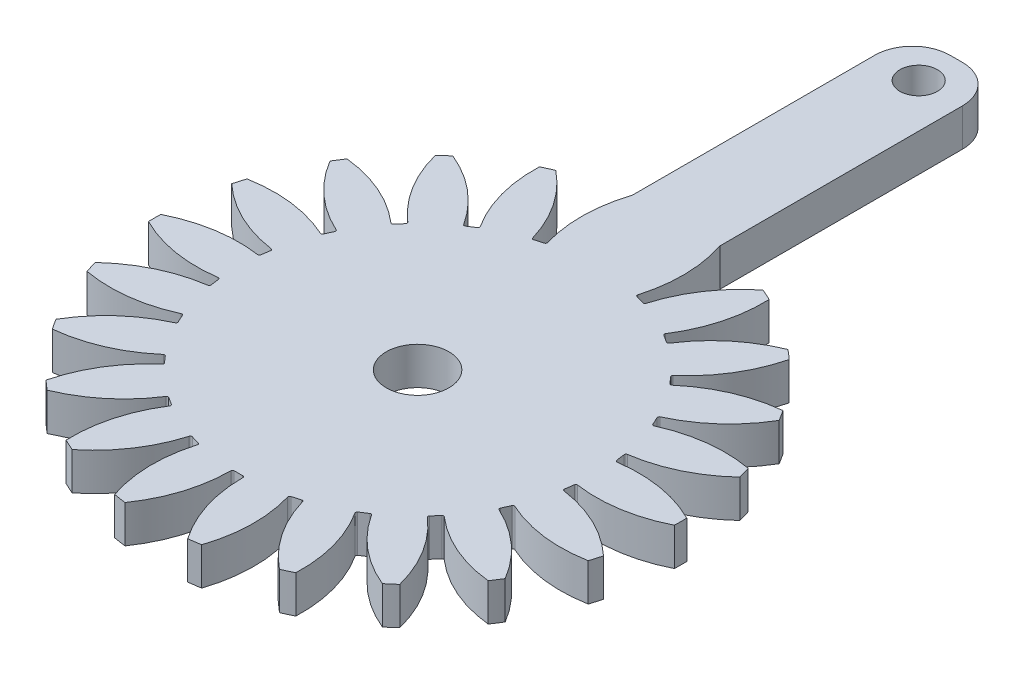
ISO-10303-21;
HEADER;
FILE_DESCRIPTION(('STEP AP214'),'2;1');
FILE_NAME('part.step','',(''),(''),'','','');
FILE_SCHEMA(('AUTOMOTIVE_DESIGN { 1 0 10303 214 1 1 1 1 }'));
ENDSEC;
DATA;
#1=APPLICATION_CONTEXT('core data for automotive mechanical design processes');
#2=APPLICATION_PROTOCOL_DEFINITION('international standard','automotive_design',2000,#1);
#3=PRODUCT_CONTEXT('',#1,'mechanical');
#4=PRODUCT('Part','Part','',(#3));
#5=PRODUCT_RELATED_PRODUCT_CATEGORY('part','',(#4));
#6=PRODUCT_DEFINITION_FORMATION('','',#4);
#7=PRODUCT_DEFINITION_CONTEXT('part definition',#1,'design');
#8=PRODUCT_DEFINITION('design','',#6,#7);
#9=PRODUCT_DEFINITION_SHAPE('','',#8);
#10=(LENGTH_UNIT() NAMED_UNIT(*) SI_UNIT(.MILLI.,.METRE.));
#11=(NAMED_UNIT(*) PLANE_ANGLE_UNIT() SI_UNIT($,.RADIAN.));
#12=(NAMED_UNIT(*) SI_UNIT($,.STERADIAN.) SOLID_ANGLE_UNIT());
#13=UNCERTAINTY_MEASURE_WITH_UNIT(LENGTH_MEASURE(1.E-05),#10,'distance_accuracy_value','');
#14=(GEOMETRIC_REPRESENTATION_CONTEXT(3) GLOBAL_UNCERTAINTY_ASSIGNED_CONTEXT((#13)) GLOBAL_UNIT_ASSIGNED_CONTEXT((#10,
#11,#12)) REPRESENTATION_CONTEXT('',''));
#15=CARTESIAN_POINT('',(0.,0.,0.));
#16=DIRECTION('',(0.,0.,1.));
#17=DIRECTION('',(1.,0.,0.));
#18=AXIS2_PLACEMENT_3D('',#15,#16,#17);
#19=CARTESIAN_POINT('',(0.,3.,0.));
#20=DIRECTION('',(0.,1.,0.));
#21=DIRECTION('',(0.,0.,1.));
#22=AXIS2_PLACEMENT_3D('',#19,#20,#21);
#23=PLANE('',#22);
#24=CARTESIAN_POINT('',(0.,3.,-40.));
#25=DIRECTION('',(0.,1.,0.));
#26=DIRECTION('',(0.,0.,1.));
#27=AXIS2_PLACEMENT_3D('',#24,#25,#26);
#28=CIRCLE('',#27,1.5);
#29=CARTESIAN_POINT('',(0.,3.,-38.5));
#30=VERTEX_POINT('',#29);
#31=EDGE_CURVE('E1786',#30,#30,#28,.T.);
#32=ORIENTED_EDGE('',*,*,#31,.F.);
#33=EDGE_LOOP('',(#32));
#34=FACE_BOUND('',#33,.T.);
#35=DIRECTION('',(0.,0.,-1.));
#36=VECTOR('',#35,1.);
#37=CARTESIAN_POINT('',(3.5,3.,-43.));
#38=LINE('',#37,#36);
#39=CARTESIAN_POINT('',(3.5,3.,-20.637000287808));
#40=VERTEX_POINT('',#39);
#41=CARTESIAN_POINT('',(3.5,3.,-40.));
#42=VERTEX_POINT('',#41);
#43=EDGE_CURVE('E1782',#40,#42,#38,.T.);
#44=ORIENTED_EDGE('',*,*,#43,.T.);
#45=CARTESIAN_POINT('',(0.499999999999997,3.,-40.));
#46=DIRECTION('',(0.,1.,0.));
#47=DIRECTION('',(0.,0.,1.));
#48=AXIS2_PLACEMENT_3D('',#45,#46,#47);
#49=CIRCLE('',#48,3.);
#50=CARTESIAN_POINT('',(0.499999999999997,3.,-43.));
#51=VERTEX_POINT('',#50);
#52=EDGE_CURVE('E1755',#42,#51,#49,.T.);
#53=ORIENTED_EDGE('',*,*,#52,.T.);
#54=DIRECTION('',(-1.,0.,0.));
#55=VECTOR('',#54,1.);
#56=CARTESIAN_POINT('',(-3.5,3.,-43.));
#57=LINE('',#56,#55);
#58=CARTESIAN_POINT('',(-0.500000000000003,3.,-43.));
#59=VERTEX_POINT('',#58);
#60=EDGE_CURVE('E1780',#51,#59,#57,.T.);
#61=ORIENTED_EDGE('',*,*,#60,.T.);
#62=CARTESIAN_POINT('',(-0.500000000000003,3.,-40.));
#63=DIRECTION('',(0.,1.,0.));
#64=DIRECTION('',(0.,0.,1.));
#65=AXIS2_PLACEMENT_3D('',#62,#63,#64);
#66=CIRCLE('',#65,3.);
#67=CARTESIAN_POINT('',(-3.5,3.,-40.));
#68=VERTEX_POINT('',#67);
#69=EDGE_CURVE('E1753',#59,#68,#66,.T.);
#70=ORIENTED_EDGE('',*,*,#69,.T.);
#71=DIRECTION('',(0.,0.,1.));
#72=VECTOR('',#71,1.);
#73=CARTESIAN_POINT('',(-3.5,3.,-43.));
#74=LINE('',#73,#72);
#75=CARTESIAN_POINT('',(-3.5,3.,-20.6370002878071));
#76=VERTEX_POINT('',#75);
#77=EDGE_CURVE('E867',#68,#76,#74,.T.);
#78=ORIENTED_EDGE('',*,*,#77,.T.);
#79=CARTESIAN_POINT('',(7.14807498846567,3.,-17.1343916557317));
#80=DIRECTION('',(0.,1.,0.));
#81=DIRECTION('',(0.,0.,1.));
#82=AXIS2_PLACEMENT_3D('',#79,#80,#81);
#83=CIRCLE('',#82,11.209360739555);
#84=CARTESIAN_POINT('',(-3.60722787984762,3.,-13.976349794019));
#85=VERTEX_POINT('',#84);
#86=EDGE_CURVE('E1513',#85,#76,#83,.F.);
#87=ORIENTED_EDGE('',*,*,#86,.F.);
#88=CARTESIAN_POINT('',(-3.72858738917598,3.,-13.9407154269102));
#89=DIRECTION('',(0.,1.,0.));
#90=DIRECTION('',(0.,0.,1.));
#91=AXIS2_PLACEMENT_3D('',#88,#89,#90);
#92=CIRCLE('',#91,0.126482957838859);
#93=CARTESIAN_POINT('',(-3.69295302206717,3.,-13.8193559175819));
#94=VERTEX_POINT('',#93);
#95=EDGE_CURVE('E843',#94,#85,#92,.T.);
#96=ORIENTED_EDGE('',*,*,#95,.F.);
#97=DIRECTION('',(0.959492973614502,0.,-0.281732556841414));
#98=VECTOR('',#97,1.);
#99=CARTESIAN_POINT('',(-3.69295302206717,3.,-13.8193559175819));
#100=LINE('',#99,#98);
#101=CARTESIAN_POINT('',(-4.36459810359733,3.,-13.6221431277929));
#102=VERTEX_POINT('',#101);
#103=EDGE_CURVE('E1602',#102,#94,#100,.T.);
#104=ORIENTED_EDGE('',*,*,#103,.F.);
#105=CARTESIAN_POINT('',(-4.40023247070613,3.,-13.7435026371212));
#106=DIRECTION('',(0.,1.,0.));
#107=DIRECTION('',(0.,0.,1.));
#108=AXIS2_PLACEMENT_3D('',#105,#106,#107);
#109=CIRCLE('',#108,0.126482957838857);
#110=CARTESIAN_POINT('',(-4.5215919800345,3.,-13.7078682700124));
#111=VERTEX_POINT('',#110);
#112=EDGE_CURVE('E1600',#111,#102,#109,.T.);
#113=ORIENTED_EDGE('',*,*,#112,.F.);
#114=CARTESIAN_POINT('',(-15.2768948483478,3.,-10.5498264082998));
#115=DIRECTION('',(0.,1.,0.));
#116=DIRECTION('',(0.,0.,1.));
#117=AXIS2_PLACEMENT_3D('',#114,#115,#116);
#118=CIRCLE('',#117,11.209360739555);
#119=CARTESIAN_POINT('',(-8.27304203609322,3.,-19.3017298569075));
#120=VERTEX_POINT('',#119);
#121=EDGE_CURVE('E1515',#120,#111,#118,.F.);
#122=ORIENTED_EDGE('',*,*,#121,.F.);
#123=CARTESIAN_POINT('',(0.,3.,0.));
#124=DIRECTION('',(0.,1.,0.));
#125=DIRECTION('',(0.,0.,1.));
#126=AXIS2_PLACEMENT_3D('',#123,#124,#125);
#127=CIRCLE('',#126,21.);
#128=CARTESIAN_POINT('',(-9.169583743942,3.,-18.8922929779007));
#129=VERTEX_POINT('',#128);
#130=EDGE_CURVE('E1701',#120,#129,#127,.T.);
#131=ORIENTED_EDGE('',*,*,#130,.T.);
#132=CARTESIAN_POINT('',(2.03121175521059,3.,-18.4541738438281));
#133=DIRECTION('',(0.,1.,0.));
#134=DIRECTION('',(0.,0.,1.));
#135=AXIS2_PLACEMENT_3D('',#132,#133,#134);
#136=CIRCLE('',#135,11.209360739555);
#137=CARTESIAN_POINT('',(-7.39870256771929,3.,-12.3939358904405));
#138=VERTEX_POINT('',#137);
#139=EDGE_CURVE('E1517',#138,#129,#136,.F.);
#140=ORIENTED_EDGE('',*,*,#139,.F.);
#141=CARTESIAN_POINT('',(-7.50510680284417,3.,-12.3255540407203));
#142=DIRECTION('',(0.,1.,0.));
#143=DIRECTION('',(0.,0.,1.));
#144=AXIS2_PLACEMENT_3D('',#141,#142,#143);
#145=CIRCLE('',#144,0.126482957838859);
#146=CARTESIAN_POINT('',(-7.43672495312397,3.,-12.2191498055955));
#147=VERTEX_POINT('',#146);
#148=EDGE_CURVE('E1607',#147,#138,#145,.T.);
#149=ORIENTED_EDGE('',*,*,#148,.F.);
#150=DIRECTION('',(0.84125353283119,0.,-0.540640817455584));
#151=VECTOR('',#150,1.);
#152=CARTESIAN_POINT('',(-7.43672495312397,3.,-12.2191498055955));
#153=LINE('',#152,#151);
#154=CARTESIAN_POINT('',(-8.0256024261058,3.,-11.8407012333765));
#155=VERTEX_POINT('',#154);
#156=EDGE_CURVE('E1606',#155,#147,#153,.T.);
#157=ORIENTED_EDGE('',*,*,#156,.F.);
#158=CARTESIAN_POINT('',(-8.093984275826,3.,-11.9471054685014));
#159=DIRECTION('',(0.,1.,0.));
#160=DIRECTION('',(0.,0.,1.));
#161=AXIS2_PLACEMENT_3D('',#158,#159,#160);
#162=CIRCLE('',#161,0.126482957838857);
#163=CARTESIAN_POINT('',(-8.20038851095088,3.,-11.8787236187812));
#164=VERTEX_POINT('',#163);
#165=EDGE_CURVE('E1604',#164,#155,#162,.T.);
#166=ORIENTED_EDGE('',*,*,#165,.F.);
#167=CARTESIAN_POINT('',(-17.6303028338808,3.,-5.81848566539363));
#168=DIRECTION('',(0.,1.,0.));
#169=DIRECTION('',(0.,0.,1.));
#170=AXIS2_PLACEMENT_3D('',#167,#168,#169);
#171=CIRCLE('',#170,11.209360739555);
#172=CARTESIAN_POINT('',(-13.3758514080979,3.,-16.1890888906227));
#173=VERTEX_POINT('',#172);
#174=EDGE_CURVE('E1519',#173,#164,#171,.F.);
#175=ORIENTED_EDGE('',*,*,#174,.F.);
#176=CARTESIAN_POINT('',(-14.1207251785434,3.,-15.5436520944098));
#177=VERTEX_POINT('',#176);
#178=EDGE_CURVE('E2363',#173,#177,#127,.T.);
#179=ORIENTED_EDGE('',*,*,#178,.T.);
#180=CARTESIAN_POINT('',(-3.25020817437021,3.,-18.2789086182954));
#181=DIRECTION('',(0.,1.,0.));
#182=DIRECTION('',(0.,0.,1.));
#183=AXIS2_PLACEMENT_3D('',#180,#181,#182);
#184=CIRCLE('',#183,11.209360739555);
#185=CARTESIAN_POINT('',(-10.5907783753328,3.,-9.80743901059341));
#186=VERTEX_POINT('',#185);
#187=EDGE_CURVE('E1505',#186,#177,#184,.F.);
#188=ORIENTED_EDGE('',*,*,#187,.F.);
#189=CARTESIAN_POINT('',(-10.6736070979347,3.,-9.71184956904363));
#190=DIRECTION('',(0.,1.,0.));
#191=DIRECTION('',(0.,0.,1.));
#192=AXIS2_PLACEMENT_3D('',#189,#190,#191);
#193=CIRCLE('',#192,0.126482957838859);
#194=CARTESIAN_POINT('',(-10.5780176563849,3.,-9.6290208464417));
#195=VERTEX_POINT('',#194);
#196=EDGE_CURVE('E1593',#195,#186,#193,.T.);
#197=ORIENTED_EDGE('',*,*,#196,.F.);
#198=DIRECTION('',(0.654860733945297,0.,-0.755749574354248));
#199=VECTOR('',#198,1.);
#200=CARTESIAN_POINT('',(-10.5780176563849,3.,-9.6290208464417));
#201=LINE('',#200,#199);
#202=CARTESIAN_POINT('',(-11.0364201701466,3.,-9.09999614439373));
#203=VERTEX_POINT('',#202);
#204=EDGE_CURVE('E1592',#203,#195,#201,.T.);
#205=ORIENTED_EDGE('',*,*,#204,.F.);
#206=CARTESIAN_POINT('',(-11.1320096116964,3.,-9.18282486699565));
#207=DIRECTION('',(0.,1.,0.));
#208=DIRECTION('',(0.,0.,1.));
#209=AXIS2_PLACEMENT_3D('',#206,#207,#208);
#210=CIRCLE('',#209,0.126482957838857);
#211=CARTESIAN_POINT('',(-11.2148383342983,3.,-9.08723542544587));
#212=VERTEX_POINT('',#211);
#213=EDGE_CURVE('E1590',#212,#203,#210,.T.);
#214=ORIENTED_EDGE('',*,*,#213,.F.);
#215=CARTESIAN_POINT('',(-18.5554085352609,3.,-0.615765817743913));
#216=DIRECTION('',(0.,1.,0.));
#217=DIRECTION('',(0.,0.,1.));
#218=AXIS2_PLACEMENT_3D('',#215,#216,#217);
#219=CIRCLE('',#218,11.209360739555);
#220=CARTESIAN_POINT('',(-17.3950288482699,3.,-11.7649042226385));
#221=VERTEX_POINT('',#220);
#222=EDGE_CURVE('E1507',#221,#212,#219,.F.);
#223=ORIENTED_EDGE('',*,*,#222,.F.);
#224=CARTESIAN_POINT('',(-17.9278894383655,3.,-10.9357569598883));
#225=VERTEX_POINT('',#224);
#226=EDGE_CURVE('E2358',#221,#225,#127,.T.);
#227=ORIENTED_EDGE('',*,*,#226,.T.);
#228=CARTESIAN_POINT('',(-8.26831556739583,3.,-16.6227949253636));
#229=DIRECTION('',(0.,1.,0.));
#230=DIRECTION('',(0.,0.,1.));
#231=AXIS2_PLACEMENT_3D('',#228,#229,#230);
#232=CIRCLE('',#231,11.209360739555);
#233=CARTESIAN_POINT('',(-12.924852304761,3.,-6.42640174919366));
#234=VERTEX_POINT('',#233);
#235=EDGE_CURVE('E1509',#234,#225,#232,.F.);
#236=ORIENTED_EDGE('',*,*,#235,.F.);
#237=CARTESIAN_POINT('',(-12.9773952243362,3.,-6.31134880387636));
#238=DIRECTION('',(0.,1.,0.));
#239=DIRECTION('',(0.,0.,1.));
#240=AXIS2_PLACEMENT_3D('',#237,#238,#239);
#241=CIRCLE('',#240,0.126482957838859);
#242=CARTESIAN_POINT('',(-12.8623422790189,3.,-6.25880588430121));
#243=VERTEX_POINT('',#242);
#244=EDGE_CURVE('E1598',#243,#234,#241,.T.);
#245=ORIENTED_EDGE('',*,*,#244,.F.);
#246=DIRECTION('',(0.4154150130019,0.,-0.909631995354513));
#247=VECTOR('',#246,1.);
#248=CARTESIAN_POINT('',(-12.8623422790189,3.,-6.25880588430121));
#249=LINE('',#248,#247);
#250=CARTESIAN_POINT('',(-13.1531327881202,3.,-5.62206348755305));
#251=VERTEX_POINT('',#250);
#252=EDGE_CURVE('E1597',#251,#243,#249,.T.);
#253=ORIENTED_EDGE('',*,*,#252,.F.);
#254=CARTESIAN_POINT('',(-13.2681857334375,3.,-5.6746064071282));
#255=DIRECTION('',(0.,1.,0.));
#256=DIRECTION('',(0.,0.,1.));
#257=AXIS2_PLACEMENT_3D('',#254,#255,#256);
#258=CIRCLE('',#257,0.126482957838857);
#259=CARTESIAN_POINT('',(-13.3207286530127,3.,-5.5595534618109));
#260=VERTEX_POINT('',#259);
#261=EDGE_CURVE('E1595',#260,#251,#258,.T.);
#262=ORIENTED_EDGE('',*,*,#261,.F.);
#263=CARTESIAN_POINT('',(-17.9772653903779,3.,4.63683971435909));
#264=DIRECTION('',(0.,1.,0.));
#265=DIRECTION('',(0.,0.,1.));
#266=AXIS2_PLACEMENT_3D('',#263,#264,#265);
#267=CIRCLE('',#266,11.209360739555);
#268=CARTESIAN_POINT('',(-20.0049645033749,3.,-6.38759698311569));
#269=VERTEX_POINT('',#268);
#270=EDGE_CURVE('E1511',#269,#260,#267,.F.);
#271=ORIENTED_EDGE('',*,*,#270,.F.);
#272=CARTESIAN_POINT('',(-20.282642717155,3.,-5.44191183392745));
#273=VERTEX_POINT('',#272);
#274=EDGE_CURVE('E2353',#269,#273,#127,.T.);
#275=ORIENTED_EDGE('',*,*,#274,.T.);
#276=CARTESIAN_POINT('',(-12.6165732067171,3.,-13.6200012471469));
#277=DIRECTION('',(0.,1.,0.));
#278=DIRECTION('',(0.,0.,1.));
#279=AXIS2_PLACEMENT_3D('',#276,#277,#278);
#280=CIRCLE('',#279,11.209360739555);
#281=CARTESIAN_POINT('',(-14.2118315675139,3.,-2.52473563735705));
#282=VERTEX_POINT('',#281);
#283=EDGE_CURVE('E1553',#282,#273,#280,.F.);
#284=ORIENTED_EDGE('',*,*,#283,.F.);
#285=CARTESIAN_POINT('',(-14.2298319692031,3.,-2.39954009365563));
#286=DIRECTION('',(0.,1.,0.));
#287=DIRECTION('',(0.,0.,1.));
#288=AXIS2_PLACEMENT_3D('',#285,#286,#287);
#289=CIRCLE('',#288,0.126482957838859);
#290=CARTESIAN_POINT('',(-14.1046364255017,3.,-2.38153969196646));
#291=VERTEX_POINT('',#290);
#292=EDGE_CURVE('E1652',#291,#282,#289,.T.);
#293=ORIENTED_EDGE('',*,*,#292,.F.);
#294=DIRECTION('',(0.142314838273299,0.,-0.989821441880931));
#295=VECTOR('',#294,1.);
#296=CARTESIAN_POINT('',(-14.1046364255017,3.,-2.38153969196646));
#297=LINE('',#296,#295);
#298=CARTESIAN_POINT('',(-14.204256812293,3.,-1.68866468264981));
#299=VERTEX_POINT('',#298);
#300=EDGE_CURVE('E1651',#299,#291,#297,.T.);
#301=ORIENTED_EDGE('',*,*,#300,.F.);
#302=CARTESIAN_POINT('',(-14.3294523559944,3.,-1.70666508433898));
#303=DIRECTION('',(0.,1.,0.));
#304=DIRECTION('',(0.,0.,1.));
#305=AXIS2_PLACEMENT_3D('',#302,#303,#304);
#306=CIRCLE('',#305,0.126482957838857);
#307=CARTESIAN_POINT('',(-14.3474527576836,3.,-1.58146954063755));
#308=VERTEX_POINT('',#307);
#309=EDGE_CURVE('E1649',#308,#299,#306,.T.);
#310=ORIENTED_EDGE('',*,*,#309,.F.);
#311=CARTESIAN_POINT('',(-15.9427111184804,3.,9.51379606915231));
#312=DIRECTION('',(0.,1.,0.));
#313=DIRECTION('',(0.,0.,1.));
#314=AXIS2_PLACEMENT_3D('',#311,#312,#313);
#315=CIRCLE('',#314,11.209360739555);
#316=CARTESIAN_POINT('',(-20.9942169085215,3.,-0.492804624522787));
#317=VERTEX_POINT('',#316);
#318=EDGE_CURVE('E1555',#317,#308,#315,.F.);
#319=ORIENTED_EDGE('',*,*,#318,.F.);
#320=CARTESIAN_POINT('',(-20.9942169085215,3.,0.492804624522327));
#321=VERTEX_POINT('',#320);
#322=EDGE_CURVE('E2348',#317,#321,#127,.T.);
#323=ORIENTED_EDGE('',*,*,#322,.T.);
#324=CARTESIAN_POINT('',(-15.9427111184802,3.,-9.51379606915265));
#325=DIRECTION('',(0.,1.,0.));
#326=DIRECTION('',(0.,0.,1.));
#327=AXIS2_PLACEMENT_3D('',#324,#325,#326);
#328=CIRCLE('',#327,11.209360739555);
#329=CARTESIAN_POINT('',(-14.3474527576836,3.,1.58146954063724));
#330=VERTEX_POINT('',#329);
#331=EDGE_CURVE('E1557',#330,#321,#328,.F.);
#332=ORIENTED_EDGE('',*,*,#331,.F.);
#333=CARTESIAN_POINT('',(-14.3294523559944,3.,1.70666508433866));
#334=DIRECTION('',(0.,1.,0.));
#335=DIRECTION('',(0.,0.,1.));
#336=AXIS2_PLACEMENT_3D('',#333,#334,#335);
#337=CIRCLE('',#336,0.126482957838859);
#338=CARTESIAN_POINT('',(-14.204256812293,3.,1.6886646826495));
#339=VERTEX_POINT('',#338);
#340=EDGE_CURVE('E1657',#339,#330,#337,.T.);
#341=ORIENTED_EDGE('',*,*,#340,.F.);
#342=DIRECTION('',(-0.142314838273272,0.,-0.989821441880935));
#343=VECTOR('',#342,1.);
#344=CARTESIAN_POINT('',(-14.204256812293,3.,1.6886646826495));
#345=LINE('',#344,#343);
#346=CARTESIAN_POINT('',(-14.1046364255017,3.,2.38153969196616));
#347=VERTEX_POINT('',#346);
#348=EDGE_CURVE('E1656',#347,#339,#345,.T.);
#349=ORIENTED_EDGE('',*,*,#348,.F.);
#350=CARTESIAN_POINT('',(-14.2298319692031,3.,2.39954009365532));
#351=DIRECTION('',(0.,1.,0.));
#352=DIRECTION('',(0.,0.,1.));
#353=AXIS2_PLACEMENT_3D('',#350,#351,#352);
#354=CIRCLE('',#353,0.126482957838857);
#355=CARTESIAN_POINT('',(-14.211831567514,3.,2.52473563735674));
#356=VERTEX_POINT('',#355);
#357=EDGE_CURVE('E1654',#356,#347,#354,.T.);
#358=ORIENTED_EDGE('',*,*,#357,.F.);
#359=CARTESIAN_POINT('',(-12.6165732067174,3.,13.6200012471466));
#360=DIRECTION('',(0.,1.,0.));
#361=DIRECTION('',(0.,0.,1.));
#362=AXIS2_PLACEMENT_3D('',#359,#360,#361);
#363=CIRCLE('',#362,11.209360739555);
#364=CARTESIAN_POINT('',(-20.2826427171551,3.,5.441911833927));
#365=VERTEX_POINT('',#364);
#366=EDGE_CURVE('E1559',#365,#356,#363,.F.);
#367=ORIENTED_EDGE('',*,*,#366,.F.);
#368=CARTESIAN_POINT('',(-20.0049645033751,3.,6.38759698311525));
#369=VERTEX_POINT('',#368);
#370=EDGE_CURVE('E2343',#365,#369,#127,.T.);
#371=ORIENTED_EDGE('',*,*,#370,.T.);
#372=CARTESIAN_POINT('',(-17.9772653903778,3.,-4.63683971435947));
#373=DIRECTION('',(0.,1.,0.));
#374=DIRECTION('',(0.,0.,1.));
#375=AXIS2_PLACEMENT_3D('',#372,#373,#374);
#376=CIRCLE('',#375,11.209360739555);
#377=CARTESIAN_POINT('',(-13.3207286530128,3.,5.55955346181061));
#378=VERTEX_POINT('',#377);
#379=EDGE_CURVE('E1565',#378,#369,#376,.F.);
#380=ORIENTED_EDGE('',*,*,#379,.F.);
#381=CARTESIAN_POINT('',(-13.2681857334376,3.,5.67460640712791));
#382=DIRECTION('',(0.,1.,0.));
#383=DIRECTION('',(0.,0.,1.));
#384=AXIS2_PLACEMENT_3D('',#381,#382,#383);
#385=CIRCLE('',#384,0.126482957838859);
#386=CARTESIAN_POINT('',(-13.1531327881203,3.,5.62206348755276));
#387=VERTEX_POINT('',#386);
#388=EDGE_CURVE('E1667',#387,#378,#385,.T.);
#389=ORIENTED_EDGE('',*,*,#388,.F.);
#390=DIRECTION('',(-0.415415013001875,0.,-0.909631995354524));
#391=VECTOR('',#390,1.);
#392=CARTESIAN_POINT('',(-13.1531327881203,3.,5.62206348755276));
#393=LINE('',#392,#391);
#394=CARTESIAN_POINT('',(-12.862342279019,3.,6.25880588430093));
#395=VERTEX_POINT('',#394);
#396=EDGE_CURVE('E1666',#395,#387,#393,.T.);
#397=ORIENTED_EDGE('',*,*,#396,.F.);
#398=CARTESIAN_POINT('',(-12.9773952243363,3.,6.31134880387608));
#399=DIRECTION('',(0.,1.,0.));
#400=DIRECTION('',(0.,0.,1.));
#401=AXIS2_PLACEMENT_3D('',#398,#399,#400);
#402=CIRCLE('',#401,0.126482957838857);
#403=CARTESIAN_POINT('',(-12.9248523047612,3.,6.42640174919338));
#404=VERTEX_POINT('',#403);
#405=EDGE_CURVE('E1664',#404,#395,#402,.T.);
#406=ORIENTED_EDGE('',*,*,#405,.F.);
#407=CARTESIAN_POINT('',(-8.26831556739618,3.,16.6227949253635));
#408=DIRECTION('',(0.,1.,0.));
#409=DIRECTION('',(0.,0.,1.));
#410=AXIS2_PLACEMENT_3D('',#407,#408,#409);
#411=CIRCLE('',#410,11.209360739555);
#412=CARTESIAN_POINT('',(-17.9278894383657,3.,10.9357569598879));
#413=VERTEX_POINT('',#412);
#414=EDGE_CURVE('E1567',#413,#404,#411,.F.);
#415=ORIENTED_EDGE('',*,*,#414,.F.);
#416=CARTESIAN_POINT('',(-17.3950288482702,3.,11.7649042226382));
#417=VERTEX_POINT('',#416);
#418=EDGE_CURVE('E2338',#413,#417,#127,.T.);
#419=ORIENTED_EDGE('',*,*,#418,.T.);
#420=CARTESIAN_POINT('',(-18.5554085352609,3.,0.615765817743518));
#421=DIRECTION('',(0.,1.,0.));
#422=DIRECTION('',(0.,0.,1.));
#423=AXIS2_PLACEMENT_3D('',#420,#421,#422);
#424=CIRCLE('',#423,11.209360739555);
#425=CARTESIAN_POINT('',(-11.2148383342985,3.,9.08723542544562));
#426=VERTEX_POINT('',#425);
#427=EDGE_CURVE('E1561',#426,#417,#424,.F.);
#428=ORIENTED_EDGE('',*,*,#427,.F.);
#429=CARTESIAN_POINT('',(-11.1320096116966,3.,9.18282486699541));
#430=DIRECTION('',(0.,1.,0.));
#431=DIRECTION('',(0.,0.,1.));
#432=AXIS2_PLACEMENT_3D('',#429,#430,#431);
#433=CIRCLE('',#432,0.126482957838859);
#434=CARTESIAN_POINT('',(-11.0364201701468,3.,9.09999614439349));
#435=VERTEX_POINT('',#434);
#436=EDGE_CURVE('E1662',#435,#426,#433,.T.);
#437=ORIENTED_EDGE('',*,*,#436,.F.);
#438=DIRECTION('',(-0.654860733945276,0.,-0.755749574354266));
#439=VECTOR('',#438,1.);
#440=CARTESIAN_POINT('',(-11.0364201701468,3.,9.09999614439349));
#441=LINE('',#440,#439);
#442=CARTESIAN_POINT('',(-10.5780176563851,3.,9.62902084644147));
#443=VERTEX_POINT('',#442);
#444=EDGE_CURVE('E1661',#443,#435,#441,.T.);
#445=ORIENTED_EDGE('',*,*,#444,.F.);
#446=CARTESIAN_POINT('',(-10.6736070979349,3.,9.7118495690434));
#447=DIRECTION('',(0.,1.,0.));
#448=DIRECTION('',(0.,0.,1.));
#449=AXIS2_PLACEMENT_3D('',#446,#447,#448);
#450=CIRCLE('',#449,0.126482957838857);
#451=CARTESIAN_POINT('',(-10.590778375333,3.,9.80743901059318));
#452=VERTEX_POINT('',#451);
#453=EDGE_CURVE('E1659',#452,#443,#450,.T.);
#454=ORIENTED_EDGE('',*,*,#453,.F.);
#455=CARTESIAN_POINT('',(-3.2502081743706,3.,18.2789086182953));
#456=DIRECTION('',(0.,1.,0.));
#457=DIRECTION('',(0.,0.,1.));
#458=AXIS2_PLACEMENT_3D('',#455,#456,#457);
#459=CIRCLE('',#458,11.209360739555);
#460=CARTESIAN_POINT('',(-14.1207251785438,3.,15.5436520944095));
#461=VERTEX_POINT('',#460);
#462=EDGE_CURVE('E1563',#461,#452,#459,.F.);
#463=ORIENTED_EDGE('',*,*,#462,.F.);
#464=CARTESIAN_POINT('',(-13.3758514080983,3.,16.1890888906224));
#465=VERTEX_POINT('',#464);
#466=EDGE_CURVE('E2333',#461,#465,#127,.T.);
#467=ORIENTED_EDGE('',*,*,#466,.T.);
#468=CARTESIAN_POINT('',(-17.6303028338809,3.,5.81848566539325));
#469=DIRECTION('',(0.,1.,0.));
#470=DIRECTION('',(0.,0.,1.));
#471=AXIS2_PLACEMENT_3D('',#468,#469,#470);
#472=CIRCLE('',#471,11.209360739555);
#473=CARTESIAN_POINT('',(-8.20038851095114,3.,11.878723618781));
#474=VERTEX_POINT('',#473);
#475=EDGE_CURVE('E1573',#474,#465,#472,.F.);
#476=ORIENTED_EDGE('',*,*,#475,.F.);
#477=CARTESIAN_POINT('',(-8.09398427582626,3.,11.9471054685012));
#478=DIRECTION('',(0.,1.,0.));
#479=DIRECTION('',(0.,0.,1.));
#480=AXIS2_PLACEMENT_3D('',#477,#478,#479);
#481=CIRCLE('',#480,0.126482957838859);
#482=CARTESIAN_POINT('',(-8.02560242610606,3.,11.8407012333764));
#483=VERTEX_POINT('',#482);
#484=EDGE_CURVE('E1677',#483,#474,#481,.T.);
#485=ORIENTED_EDGE('',*,*,#484,.F.);
#486=DIRECTION('',(-0.841253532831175,0.,-0.540640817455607));
#487=VECTOR('',#486,1.);
#488=CARTESIAN_POINT('',(-8.02560242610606,3.,11.8407012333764));
#489=LINE('',#488,#487);
#490=CARTESIAN_POINT('',(-7.43672495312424,3.,12.2191498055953));
#491=VERTEX_POINT('',#490);
#492=EDGE_CURVE('E1676',#491,#483,#489,.T.);
#493=ORIENTED_EDGE('',*,*,#492,.F.);
#494=CARTESIAN_POINT('',(-7.50510680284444,3.,12.3255540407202));
#495=DIRECTION('',(0.,1.,0.));
#496=DIRECTION('',(0.,0.,1.));
#497=AXIS2_PLACEMENT_3D('',#494,#495,#496);
#498=CIRCLE('',#497,0.126482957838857);
#499=CARTESIAN_POINT('',(-7.39870256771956,3.,12.3939358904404));
#500=VERTEX_POINT('',#499);
#501=EDGE_CURVE('E1674',#500,#491,#498,.T.);
#502=ORIENTED_EDGE('',*,*,#501,.F.);
#503=CARTESIAN_POINT('',(2.0312117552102,3.,18.4541738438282));
#504=DIRECTION('',(0.,1.,0.));
#505=DIRECTION('',(0.,0.,1.));
#506=AXIS2_PLACEMENT_3D('',#503,#504,#505);
#507=CIRCLE('',#506,11.209360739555);
#508=CARTESIAN_POINT('',(-9.16958374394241,3.,18.8922929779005));
#509=VERTEX_POINT('',#508);
#510=EDGE_CURVE('E1575',#509,#500,#507,.F.);
#511=ORIENTED_EDGE('',*,*,#510,.F.);
#512=CARTESIAN_POINT('',(-8.27304203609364,3.,19.3017298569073));
#513=VERTEX_POINT('',#512);
#514=EDGE_CURVE('E2328',#509,#513,#127,.T.);
#515=ORIENTED_EDGE('',*,*,#514,.T.);
#516=CARTESIAN_POINT('',(-15.276894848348,3.,10.5498264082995));
#517=DIRECTION('',(0.,1.,0.));
#518=DIRECTION('',(0.,0.,1.));
#519=AXIS2_PLACEMENT_3D('',#516,#517,#518);
#520=CIRCLE('',#519,11.209360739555);
#521=CARTESIAN_POINT('',(-4.5215919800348,3.,13.7078682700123));
#522=VERTEX_POINT('',#521);
#523=EDGE_CURVE('E1569',#522,#513,#520,.F.);
#524=ORIENTED_EDGE('',*,*,#523,.F.);
#525=CARTESIAN_POINT('',(-4.40023247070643,3.,13.7435026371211));
#526=DIRECTION('',(0.,1.,0.));
#527=DIRECTION('',(0.,0.,1.));
#528=AXIS2_PLACEMENT_3D('',#525,#526,#527);
#529=CIRCLE('',#528,0.126482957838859);
#530=CARTESIAN_POINT('',(-4.36459810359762,3.,13.6221431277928));
#531=VERTEX_POINT('',#530);
#532=EDGE_CURVE('E1672',#531,#522,#529,.T.);
#533=ORIENTED_EDGE('',*,*,#532,.F.);
#534=DIRECTION('',(-0.959492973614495,0.,-0.281732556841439));
#535=VECTOR('',#534,1.);
#536=CARTESIAN_POINT('',(-4.36459810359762,3.,13.6221431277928));
#537=LINE('',#536,#535);
#538=CARTESIAN_POINT('',(-3.69295302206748,3.,13.8193559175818));
#539=VERTEX_POINT('',#538);
#540=EDGE_CURVE('E1671',#539,#531,#537,.T.);
#541=ORIENTED_EDGE('',*,*,#540,.F.);
#542=CARTESIAN_POINT('',(-3.72858738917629,3.,13.9407154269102));
#543=DIRECTION('',(0.,1.,0.));
#544=DIRECTION('',(0.,0.,1.));
#545=AXIS2_PLACEMENT_3D('',#542,#543,#544);
#546=CIRCLE('',#545,0.126482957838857);
#547=CARTESIAN_POINT('',(-3.60722787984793,3.,13.976349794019));
#548=VERTEX_POINT('',#547);
#549=EDGE_CURVE('E1669',#548,#539,#546,.T.);
#550=ORIENTED_EDGE('',*,*,#549,.F.);
#551=CARTESIAN_POINT('',(7.14807498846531,3.,17.1343916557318));
#552=DIRECTION('',(0.,1.,0.));
#553=DIRECTION('',(0.,0.,1.));
#554=AXIS2_PLACEMENT_3D('',#551,#552,#553);
#555=CIRCLE('',#554,11.209360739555);
#556=CARTESIAN_POINT('',(-3.47557716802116,3.,20.7103926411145));
#557=VERTEX_POINT('',#556);
#558=EDGE_CURVE('E1571',#557,#548,#555,.F.);
#559=ORIENTED_EDGE('',*,*,#558,.F.);
#560=CARTESIAN_POINT('',(-2.5,3.,20.850659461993));
#561=VERTEX_POINT('',#560);
#562=EDGE_CURVE('E2323',#557,#561,#127,.T.);
#563=ORIENTED_EDGE('',*,*,#562,.T.);
#564=CARTESIAN_POINT('',(-11.6858436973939,3.,14.4264829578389));
#565=DIRECTION('',(0.,1.,0.));
#566=DIRECTION('',(0.,0.,1.));
#567=AXIS2_PLACEMENT_3D('',#564,#565,#566);
#568=CIRCLE('',#567,11.209360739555);
#569=CARTESIAN_POINT('',(-0.476482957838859,3.,14.4264829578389));
#570=VERTEX_POINT('',#569);
#571=EDGE_CURVE('E1577',#570,#561,#568,.F.);
#572=ORIENTED_EDGE('',*,*,#571,.F.);
#573=CARTESIAN_POINT('',(-0.35,3.,14.4264829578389));
#574=DIRECTION('',(0.,1.,0.));
#575=DIRECTION('',(0.,0.,1.));
#576=AXIS2_PLACEMENT_3D('',#573,#574,#575);
#577=CIRCLE('',#576,0.126482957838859);
#578=CARTESIAN_POINT('',(-0.35,3.,14.3));
#579=VERTEX_POINT('',#578);
#580=EDGE_CURVE('E1682',#579,#570,#577,.T.);
#581=ORIENTED_EDGE('',*,*,#580,.F.);
#582=DIRECTION('',(-1.,0.,0.));
#583=VECTOR('',#582,1.);
#584=CARTESIAN_POINT('',(-0.35,3.,14.3));
#585=LINE('',#584,#583);
#586=CARTESIAN_POINT('',(0.35,3.,14.3));
#587=VERTEX_POINT('',#586);
#588=EDGE_CURVE('E1681',#587,#579,#585,.T.);
#589=ORIENTED_EDGE('',*,*,#588,.F.);
#590=CARTESIAN_POINT('',(0.35,3.,14.4264829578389));
#591=DIRECTION('',(0.,1.,0.));
#592=DIRECTION('',(0.,0.,1.));
#593=AXIS2_PLACEMENT_3D('',#590,#591,#592);
#594=CIRCLE('',#593,0.126482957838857);
#595=CARTESIAN_POINT('',(0.476482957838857,3.,14.4264829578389));
#596=VERTEX_POINT('',#595);
#597=EDGE_CURVE('E1679',#596,#587,#594,.T.);
#598=ORIENTED_EDGE('',*,*,#597,.F.);
#599=CARTESIAN_POINT('',(11.6858436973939,3.,14.4264829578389));
#600=DIRECTION('',(0.,1.,0.));
#601=DIRECTION('',(0.,0.,1.));
#602=AXIS2_PLACEMENT_3D('',#599,#600,#601);
#603=CIRCLE('',#602,11.209360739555);
#604=CARTESIAN_POINT('',(2.5,3.,20.850659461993));
#605=VERTEX_POINT('',#604);
#606=EDGE_CURVE('E1579',#605,#596,#603,.F.);
#607=ORIENTED_EDGE('',*,*,#606,.F.);
#608=CARTESIAN_POINT('',(3.47557716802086,3.,20.7103926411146));
#609=VERTEX_POINT('',#608);
#610=EDGE_CURVE('E2318',#605,#609,#127,.T.);
#611=ORIENTED_EDGE('',*,*,#610,.T.);
#612=CARTESIAN_POINT('',(-7.14807498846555,3.,17.1343916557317));
#613=DIRECTION('',(0.,1.,0.));
#614=DIRECTION('',(0.,0.,1.));
#615=AXIS2_PLACEMENT_3D('',#612,#613,#614);
#616=CIRCLE('',#615,11.209360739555);
#617=CARTESIAN_POINT('',(3.60722787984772,3.,13.976349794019));
#618=VERTEX_POINT('',#617);
#619=EDGE_CURVE('E1581',#618,#609,#616,.F.);
#620=ORIENTED_EDGE('',*,*,#619,.F.);
#621=CARTESIAN_POINT('',(3.72858738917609,3.,13.9407154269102));
#622=DIRECTION('',(0.,1.,0.));
#623=DIRECTION('',(0.,0.,1.));
#624=AXIS2_PLACEMENT_3D('',#621,#622,#623);
#625=CIRCLE('',#624,0.126482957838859);
#626=CARTESIAN_POINT('',(3.69295302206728,3.,13.8193559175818));
#627=VERTEX_POINT('',#626);
#628=EDGE_CURVE('E1687',#627,#618,#625,.T.);
#629=ORIENTED_EDGE('',*,*,#628,.F.);
#630=DIRECTION('',(-0.9594929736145,0.,0.281732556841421));
#631=VECTOR('',#630,1.);
#632=CARTESIAN_POINT('',(3.69295302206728,3.,13.8193559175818));
#633=LINE('',#632,#631);
#634=CARTESIAN_POINT('',(4.36459810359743,3.,13.6221431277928));
#635=VERTEX_POINT('',#634);
#636=EDGE_CURVE('E1686',#635,#627,#633,.T.);
#637=ORIENTED_EDGE('',*,*,#636,.F.);
#638=CARTESIAN_POINT('',(4.40023247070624,3.,13.7435026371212));
#639=DIRECTION('',(0.,1.,0.));
#640=DIRECTION('',(0.,0.,1.));
#641=AXIS2_PLACEMENT_3D('',#638,#639,#640);
#642=CIRCLE('',#641,0.126482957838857);
#643=CARTESIAN_POINT('',(4.5215919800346,3.,13.7078682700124));
#644=VERTEX_POINT('',#643);
#645=EDGE_CURVE('E1684',#644,#635,#642,.T.);
#646=ORIENTED_EDGE('',*,*,#645,.F.);
#647=CARTESIAN_POINT('',(15.2768948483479,3.,10.5498264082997));
#648=DIRECTION('',(0.,1.,0.));
#649=DIRECTION('',(0.,0.,1.));
#650=AXIS2_PLACEMENT_3D('',#647,#648,#649);
#651=CIRCLE('',#650,11.209360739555);
#652=CARTESIAN_POINT('',(8.27304203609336,3.,19.3017298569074));
#653=VERTEX_POINT('',#652);
#654=EDGE_CURVE('E1583',#653,#644,#651,.F.);
#655=ORIENTED_EDGE('',*,*,#654,.F.);
#656=CARTESIAN_POINT('',(9.16958374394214,3.,18.8922929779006));
#657=VERTEX_POINT('',#656);
#658=EDGE_CURVE('E2313',#653,#657,#127,.T.);
#659=ORIENTED_EDGE('',*,*,#658,.T.);
#660=CARTESIAN_POINT('',(-2.03121175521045,3.,18.4541738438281));
#661=DIRECTION('',(0.,1.,0.));
#662=DIRECTION('',(0.,0.,1.));
#663=AXIS2_PLACEMENT_3D('',#660,#661,#662);
#664=CIRCLE('',#663,11.209360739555);
#665=CARTESIAN_POINT('',(7.39870256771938,3.,12.3939358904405));
#666=VERTEX_POINT('',#665);
#667=EDGE_CURVE('E1541',#666,#657,#664,.F.);
#668=ORIENTED_EDGE('',*,*,#667,.F.);
#669=CARTESIAN_POINT('',(7.50510680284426,3.,12.3255540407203));
#670=DIRECTION('',(0.,1.,0.));
#671=DIRECTION('',(0.,0.,1.));
#672=AXIS2_PLACEMENT_3D('',#669,#670,#671);
#673=CIRCLE('',#672,0.126482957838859);
#674=CARTESIAN_POINT('',(7.43672495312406,3.,12.2191498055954));
#675=VERTEX_POINT('',#674);
#676=EDGE_CURVE('E1637',#675,#666,#673,.T.);
#677=ORIENTED_EDGE('',*,*,#676,.F.);
#678=DIRECTION('',(-0.841253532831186,0.,0.540640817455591));
#679=VECTOR('',#678,1.);
#680=CARTESIAN_POINT('',(7.43672495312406,3.,12.2191498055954));
#681=LINE('',#680,#679);
#682=CARTESIAN_POINT('',(8.02560242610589,3.,11.8407012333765));
#683=VERTEX_POINT('',#682);
#684=EDGE_CURVE('E1636',#683,#675,#681,.T.);
#685=ORIENTED_EDGE('',*,*,#684,.F.);
#686=CARTESIAN_POINT('',(8.09398427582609,3.,11.9471054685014));
#687=DIRECTION('',(0.,1.,0.));
#688=DIRECTION('',(0.,0.,1.));
#689=AXIS2_PLACEMENT_3D('',#686,#687,#688);
#690=CIRCLE('',#689,0.126482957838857);
#691=CARTESIAN_POINT('',(8.20038851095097,3.,11.8787236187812));
#692=VERTEX_POINT('',#691);
#693=EDGE_CURVE('E1634',#692,#683,#690,.T.);
#694=ORIENTED_EDGE('',*,*,#693,.F.);
#695=CARTESIAN_POINT('',(17.6303028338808,3.,5.8184856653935));
#696=DIRECTION('',(0.,1.,0.));
#697=DIRECTION('',(0.,0.,1.));
#698=AXIS2_PLACEMENT_3D('',#695,#696,#697);
#699=CIRCLE('',#698,11.209360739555);
#700=CARTESIAN_POINT('',(13.3758514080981,3.,16.1890888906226));
#701=VERTEX_POINT('',#700);
#702=EDGE_CURVE('E1543',#701,#692,#699,.F.);
#703=ORIENTED_EDGE('',*,*,#702,.F.);
#704=CARTESIAN_POINT('',(14.1207251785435,3.,15.5436520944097));
#705=VERTEX_POINT('',#704);
#706=EDGE_CURVE('E2308',#701,#705,#127,.T.);
#707=ORIENTED_EDGE('',*,*,#706,.T.);
#708=CARTESIAN_POINT('',(3.25020817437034,3.,18.2789086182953));
#709=DIRECTION('',(0.,1.,0.));
#710=DIRECTION('',(0.,0.,1.));
#711=AXIS2_PLACEMENT_3D('',#708,#709,#710);
#712=CIRCLE('',#711,11.209360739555);
#713=CARTESIAN_POINT('',(10.5907783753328,3.,9.80743901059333));
#714=VERTEX_POINT('',#713);
#715=EDGE_CURVE('E1537',#714,#705,#712,.F.);
#716=ORIENTED_EDGE('',*,*,#715,.F.);
#717=CARTESIAN_POINT('',(10.6736070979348,3.,9.71184956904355));
#718=DIRECTION('',(0.,1.,0.));
#719=DIRECTION('',(0.,0.,1.));
#720=AXIS2_PLACEMENT_3D('',#717,#718,#719);
#721=CIRCLE('',#720,0.126482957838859);
#722=CARTESIAN_POINT('',(10.578017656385,3.,9.62902084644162));
#723=VERTEX_POINT('',#722);
#724=EDGE_CURVE('E1632',#723,#714,#721,.T.);
#725=ORIENTED_EDGE('',*,*,#724,.F.);
#726=DIRECTION('',(-0.654860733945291,0.,0.755749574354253));
#727=VECTOR('',#726,1.);
#728=CARTESIAN_POINT('',(10.578017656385,3.,9.62902084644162));
#729=LINE('',#728,#727);
#730=CARTESIAN_POINT('',(11.0364201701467,3.,9.09999614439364));
#731=VERTEX_POINT('',#730);
#732=EDGE_CURVE('E1631',#731,#723,#729,.T.);
#733=ORIENTED_EDGE('',*,*,#732,.F.);
#734=CARTESIAN_POINT('',(11.1320096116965,3.,9.18282486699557));
#735=DIRECTION('',(0.,1.,0.));
#736=DIRECTION('',(0.,0.,1.));
#737=AXIS2_PLACEMENT_3D('',#734,#735,#736);
#738=CIRCLE('',#737,0.126482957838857);
#739=CARTESIAN_POINT('',(11.2148383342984,3.,9.08723542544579));
#740=VERTEX_POINT('',#739);
#741=EDGE_CURVE('E1629',#740,#731,#738,.T.);
#742=ORIENTED_EDGE('',*,*,#741,.F.);
#743=CARTESIAN_POINT('',(18.5554085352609,3.,0.615765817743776));
#744=DIRECTION('',(0.,1.,0.));
#745=DIRECTION('',(0.,0.,1.));
#746=AXIS2_PLACEMENT_3D('',#743,#744,#745);
#747=CIRCLE('',#746,11.209360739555);
#748=CARTESIAN_POINT('',(17.39502884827,3.,11.7649042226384));
#749=VERTEX_POINT('',#748);
#750=EDGE_CURVE('E1539',#749,#740,#747,.F.);
#751=ORIENTED_EDGE('',*,*,#750,.F.);
#752=CARTESIAN_POINT('',(17.9278894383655,3.,10.9357569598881));
#753=VERTEX_POINT('',#752);
#754=EDGE_CURVE('E2303',#749,#753,#127,.T.);
#755=ORIENTED_EDGE('',*,*,#754,.T.);
#756=CARTESIAN_POINT('',(8.26831556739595,3.,16.6227949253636));
#757=DIRECTION('',(0.,1.,0.));
#758=DIRECTION('',(0.,0.,1.));
#759=AXIS2_PLACEMENT_3D('',#756,#757,#758);
#760=CIRCLE('',#759,11.209360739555);
#761=CARTESIAN_POINT('',(12.9248523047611,3.,6.42640174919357));
#762=VERTEX_POINT('',#761);
#763=EDGE_CURVE('E1545',#762,#753,#760,.F.);
#764=ORIENTED_EDGE('',*,*,#763,.F.);
#765=CARTESIAN_POINT('',(12.9773952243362,3.,6.31134880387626));
#766=DIRECTION('',(0.,1.,0.));
#767=DIRECTION('',(0.,0.,1.));
#768=AXIS2_PLACEMENT_3D('',#765,#766,#767);
#769=CIRCLE('',#768,0.126482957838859);
#770=CARTESIAN_POINT('',(12.8623422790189,3.,6.25880588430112));
#771=VERTEX_POINT('',#770);
#772=EDGE_CURVE('E1642',#771,#762,#769,.T.);
#773=ORIENTED_EDGE('',*,*,#772,.F.);
#774=DIRECTION('',(-0.415415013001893,0.,0.909631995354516));
#775=VECTOR('',#774,1.);
#776=CARTESIAN_POINT('',(12.8623422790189,3.,6.25880588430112));
#777=LINE('',#776,#775);
#778=CARTESIAN_POINT('',(13.1531327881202,3.,5.62206348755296));
#779=VERTEX_POINT('',#778);
#780=EDGE_CURVE('E1641',#779,#771,#777,.T.);
#781=ORIENTED_EDGE('',*,*,#780,.F.);
#782=CARTESIAN_POINT('',(13.2681857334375,3.,5.6746064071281));
#783=DIRECTION('',(0.,1.,0.));
#784=DIRECTION('',(0.,0.,1.));
#785=AXIS2_PLACEMENT_3D('',#782,#783,#784);
#786=CIRCLE('',#785,0.126482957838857);
#787=CARTESIAN_POINT('',(13.3207286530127,3.,5.5595534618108));
#788=VERTEX_POINT('',#787);
#789=EDGE_CURVE('E1639',#788,#779,#786,.T.);
#790=ORIENTED_EDGE('',*,*,#789,.F.);
#791=CARTESIAN_POINT('',(17.9772653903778,3.,-4.63683971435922));
#792=DIRECTION('',(0.,1.,0.));
#793=DIRECTION('',(0.,0.,1.));
#794=AXIS2_PLACEMENT_3D('',#791,#792,#793);
#795=CIRCLE('',#794,11.209360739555);
#796=CARTESIAN_POINT('',(20.004964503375,3.,6.38759698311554));
#797=VERTEX_POINT('',#796);
#798=EDGE_CURVE('E1547',#797,#788,#795,.F.);
#799=ORIENTED_EDGE('',*,*,#798,.F.);
#800=CARTESIAN_POINT('',(20.282642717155,3.,5.44191183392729));
#801=VERTEX_POINT('',#800);
#802=EDGE_CURVE('E2298',#797,#801,#127,.T.);
#803=ORIENTED_EDGE('',*,*,#802,.T.);
#804=CARTESIAN_POINT('',(12.6165732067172,3.,13.6200012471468));
#805=DIRECTION('',(0.,1.,0.));
#806=DIRECTION('',(0.,0.,1.));
#807=AXIS2_PLACEMENT_3D('',#804,#805,#806);
#808=CIRCLE('',#807,11.209360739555);
#809=CARTESIAN_POINT('',(14.2118315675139,3.,2.52473563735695));
#810=VERTEX_POINT('',#809);
#811=EDGE_CURVE('E1549',#810,#801,#808,.F.);
#812=ORIENTED_EDGE('',*,*,#811,.F.);
#813=CARTESIAN_POINT('',(14.2298319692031,3.,2.39954009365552));
#814=DIRECTION('',(0.,1.,0.));
#815=DIRECTION('',(0.,0.,1.));
#816=AXIS2_PLACEMENT_3D('',#813,#814,#815);
#817=CIRCLE('',#816,0.126482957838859);
#818=CARTESIAN_POINT('',(14.1046364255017,3.,2.38153969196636));
#819=VERTEX_POINT('',#818);
#820=EDGE_CURVE('E1647',#819,#810,#817,.T.);
#821=ORIENTED_EDGE('',*,*,#820,.F.);
#822=DIRECTION('',(-0.142314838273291,0.,0.989821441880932));
#823=VECTOR('',#822,1.);
#824=CARTESIAN_POINT('',(14.1046364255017,3.,2.38153969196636));
#825=LINE('',#824,#823);
#826=CARTESIAN_POINT('',(14.204256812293,3.,1.68866468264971));
#827=VERTEX_POINT('',#826);
#828=EDGE_CURVE('E1646',#827,#819,#825,.T.);
#829=ORIENTED_EDGE('',*,*,#828,.F.);
#830=CARTESIAN_POINT('',(14.3294523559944,3.,1.70666508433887));
#831=DIRECTION('',(0.,1.,0.));
#832=DIRECTION('',(0.,0.,1.));
#833=AXIS2_PLACEMENT_3D('',#830,#831,#832);
#834=CIRCLE('',#833,0.126482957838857);
#835=CARTESIAN_POINT('',(14.3474527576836,3.,1.58146954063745));
#836=VERTEX_POINT('',#835);
#837=EDGE_CURVE('E1644',#836,#827,#834,.T.);
#838=ORIENTED_EDGE('',*,*,#837,.F.);
#839=CARTESIAN_POINT('',(15.9427111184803,3.,-9.51379606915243));
#840=DIRECTION('',(0.,1.,0.));
#841=DIRECTION('',(0.,0.,1.));
#842=AXIS2_PLACEMENT_3D('',#839,#840,#841);
#843=CIRCLE('',#842,11.209360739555);
#844=CARTESIAN_POINT('',(20.9942169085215,3.,0.492804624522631));
#845=VERTEX_POINT('',#844);
#846=EDGE_CURVE('E1551',#845,#836,#843,.F.);
#847=ORIENTED_EDGE('',*,*,#846,.F.);
#848=CARTESIAN_POINT('',(20.9942169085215,3.,-0.492804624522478));
#849=VERTEX_POINT('',#848);
#850=EDGE_CURVE('E2293',#845,#849,#127,.T.);
#851=ORIENTED_EDGE('',*,*,#850,.T.);
#852=CARTESIAN_POINT('',(15.9427111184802,3.,9.51379606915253));
#853=DIRECTION('',(0.,1.,0.));
#854=DIRECTION('',(0.,0.,1.));
#855=AXIS2_PLACEMENT_3D('',#852,#853,#854);
#856=CIRCLE('',#855,11.209360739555);
#857=CARTESIAN_POINT('',(14.3474527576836,3.,-1.58146954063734));
#858=VERTEX_POINT('',#857);
#859=EDGE_CURVE('E1521',#858,#849,#856,.F.);
#860=ORIENTED_EDGE('',*,*,#859,.F.);
#861=CARTESIAN_POINT('',(14.3294523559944,3.,-1.70666508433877));
#862=DIRECTION('',(0.,1.,0.));
#863=DIRECTION('',(0.,0.,1.));
#864=AXIS2_PLACEMENT_3D('',#861,#862,#863);
#865=CIRCLE('',#864,0.126482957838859);
#866=CARTESIAN_POINT('',(14.204256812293,3.,-1.6886646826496));
#867=VERTEX_POINT('',#866);
#868=EDGE_CURVE('E1612',#867,#858,#865,.T.);
#869=ORIENTED_EDGE('',*,*,#868,.F.);
#870=DIRECTION('',(0.142314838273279,0.,0.989821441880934));
#871=VECTOR('',#870,1.);
#872=CARTESIAN_POINT('',(14.204256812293,3.,-1.6886646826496));
#873=LINE('',#872,#871);
#874=CARTESIAN_POINT('',(14.1046364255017,3.,-2.38153969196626));
#875=VERTEX_POINT('',#874);
#876=EDGE_CURVE('E1611',#875,#867,#873,.T.);
#877=ORIENTED_EDGE('',*,*,#876,.F.);
#878=CARTESIAN_POINT('',(14.2298319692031,3.,-2.39954009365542));
#879=DIRECTION('',(0.,1.,0.));
#880=DIRECTION('',(0.,0.,1.));
#881=AXIS2_PLACEMENT_3D('',#878,#879,#880);
#882=CIRCLE('',#881,0.126482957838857);
#883=CARTESIAN_POINT('',(14.211831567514,3.,-2.52473563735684));
#884=VERTEX_POINT('',#883);
#885=EDGE_CURVE('E1609',#884,#875,#882,.T.);
#886=ORIENTED_EDGE('',*,*,#885,.F.);
#887=CARTESIAN_POINT('',(12.6165732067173,3.,-13.6200012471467));
#888=DIRECTION('',(0.,1.,0.));
#889=DIRECTION('',(0.,0.,1.));
#890=AXIS2_PLACEMENT_3D('',#887,#888,#889);
#891=CIRCLE('',#890,11.209360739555);
#892=CARTESIAN_POINT('',(20.2826427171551,3.,-5.44191183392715));
#893=VERTEX_POINT('',#892);
#894=EDGE_CURVE('E1523',#893,#884,#891,.F.);
#895=ORIENTED_EDGE('',*,*,#894,.F.);
#896=CARTESIAN_POINT('',(20.004964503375,3.,-6.3875969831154));
#897=VERTEX_POINT('',#896);
#898=EDGE_CURVE('E2288',#893,#897,#127,.T.);
#899=ORIENTED_EDGE('',*,*,#898,.T.);
#900=CARTESIAN_POINT('',(17.9772653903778,3.,4.63683971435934));
#901=DIRECTION('',(0.,1.,0.));
#902=DIRECTION('',(0.,0.,1.));
#903=AXIS2_PLACEMENT_3D('',#900,#901,#902);
#904=CIRCLE('',#903,11.209360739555);
#905=CARTESIAN_POINT('',(13.3207286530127,3.,-5.5595534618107));
#906=VERTEX_POINT('',#905);
#907=EDGE_CURVE('E1525',#906,#897,#904,.F.);
#908=ORIENTED_EDGE('',*,*,#907,.F.);
#909=CARTESIAN_POINT('',(13.2681857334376,3.,-5.67460640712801));
#910=DIRECTION('',(0.,1.,0.));
#911=DIRECTION('',(0.,0.,1.));
#912=AXIS2_PLACEMENT_3D('',#909,#910,#911);
#913=CIRCLE('',#912,0.126482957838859);
#914=CARTESIAN_POINT('',(13.1531327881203,3.,-5.62206348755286));
#915=VERTEX_POINT('',#914);
#916=EDGE_CURVE('E1617',#915,#906,#913,.T.);
#917=ORIENTED_EDGE('',*,*,#916,.F.);
#918=DIRECTION('',(0.415415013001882,0.,0.909631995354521));
#919=VECTOR('',#918,1.);
#920=CARTESIAN_POINT('',(13.1531327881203,3.,-5.62206348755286));
#921=LINE('',#920,#919);
#922=CARTESIAN_POINT('',(12.862342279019,3.,-6.25880588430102));
#923=VERTEX_POINT('',#922);
#924=EDGE_CURVE('E1616',#923,#915,#921,.T.);
#925=ORIENTED_EDGE('',*,*,#924,.F.);
#926=CARTESIAN_POINT('',(12.9773952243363,3.,-6.31134880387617));
#927=DIRECTION('',(0.,1.,0.));
#928=DIRECTION('',(0.,0.,1.));
#929=AXIS2_PLACEMENT_3D('',#926,#927,#928);
#930=CIRCLE('',#929,0.126482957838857);
#931=CARTESIAN_POINT('',(12.9248523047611,3.,-6.42640174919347));
#932=VERTEX_POINT('',#931);
#933=EDGE_CURVE('E1614',#932,#923,#930,.T.);
#934=ORIENTED_EDGE('',*,*,#933,.F.);
#935=CARTESIAN_POINT('',(8.26831556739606,3.,-16.6227949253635));
#936=DIRECTION('',(0.,1.,0.));
#937=DIRECTION('',(0.,0.,1.));
#938=AXIS2_PLACEMENT_3D('',#935,#936,#937);
#939=CIRCLE('',#938,11.209360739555);
#940=CARTESIAN_POINT('',(17.9278894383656,3.,-10.935756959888));
#941=VERTEX_POINT('',#940);
#942=EDGE_CURVE('E1527',#941,#932,#939,.F.);
#943=ORIENTED_EDGE('',*,*,#942,.F.);
#944=CARTESIAN_POINT('',(17.3950288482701,3.,-11.7649042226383));
#945=VERTEX_POINT('',#944);
#946=EDGE_CURVE('E2286',#941,#945,#127,.T.);
#947=ORIENTED_EDGE('',*,*,#946,.T.);
#948=CARTESIAN_POINT('',(18.5554085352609,3.,-0.615765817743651));
#949=DIRECTION('',(0.,1.,0.));
#950=DIRECTION('',(0.,0.,1.));
#951=AXIS2_PLACEMENT_3D('',#948,#949,#950);
#952=CIRCLE('',#951,11.209360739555);
#953=CARTESIAN_POINT('',(11.2148383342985,3.,-9.08723542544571));
#954=VERTEX_POINT('',#953);
#955=EDGE_CURVE('E1533',#954,#945,#952,.F.);
#956=ORIENTED_EDGE('',*,*,#955,.F.);
#957=CARTESIAN_POINT('',(11.1320096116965,3.,-9.18282486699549));
#958=DIRECTION('',(0.,1.,0.));
#959=DIRECTION('',(0.,0.,1.));
#960=AXIS2_PLACEMENT_3D('',#957,#958,#959);
#961=CIRCLE('',#960,0.126482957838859);
#962=CARTESIAN_POINT('',(11.0364201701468,3.,-9.09999614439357));
#963=VERTEX_POINT('',#962);
#964=EDGE_CURVE('E1627',#963,#954,#961,.T.);
#965=ORIENTED_EDGE('',*,*,#964,.F.);
#966=DIRECTION('',(0.654860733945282,0.,0.755749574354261));
#967=VECTOR('',#966,1.);
#968=CARTESIAN_POINT('',(11.0364201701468,3.,-9.09999614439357));
#969=LINE('',#968,#967);
#970=CARTESIAN_POINT('',(10.5780176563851,3.,-9.62902084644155));
#971=VERTEX_POINT('',#970);
#972=EDGE_CURVE('E1626',#971,#963,#969,.T.);
#973=ORIENTED_EDGE('',*,*,#972,.F.);
#974=CARTESIAN_POINT('',(10.6736070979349,3.,-9.71184956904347));
#975=DIRECTION('',(0.,1.,0.));
#976=DIRECTION('',(0.,0.,1.));
#977=AXIS2_PLACEMENT_3D('',#974,#975,#976);
#978=CIRCLE('',#977,0.126482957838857);
#979=CARTESIAN_POINT('',(10.5907783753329,3.,-9.80743901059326));
#980=VERTEX_POINT('',#979);
#981=EDGE_CURVE('E1624',#980,#971,#978,.T.);
#982=ORIENTED_EDGE('',*,*,#981,.F.);
#983=CARTESIAN_POINT('',(3.25020817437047,3.,-18.2789086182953));
#984=DIRECTION('',(0.,1.,0.));
#985=DIRECTION('',(0.,0.,1.));
#986=AXIS2_PLACEMENT_3D('',#983,#984,#985);
#987=CIRCLE('',#986,11.209360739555);
#988=CARTESIAN_POINT('',(14.1207251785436,3.,-15.5436520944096));
#989=VERTEX_POINT('',#988);
#990=EDGE_CURVE('E1535',#989,#980,#987,.F.);
#991=ORIENTED_EDGE('',*,*,#990,.F.);
#992=CARTESIAN_POINT('',(13.3758514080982,3.,-16.1890888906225));
#993=VERTEX_POINT('',#992);
#994=EDGE_CURVE('E1699',#989,#993,#127,.T.);
#995=ORIENTED_EDGE('',*,*,#994,.T.);
#996=CARTESIAN_POINT('',(17.6303028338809,3.,-5.81848566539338));
#997=DIRECTION('',(0.,1.,0.));
#998=DIRECTION('',(0.,0.,1.));
#999=AXIS2_PLACEMENT_3D('',#996,#997,#998);
#1000=CIRCLE('',#999,11.209360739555);
#1001=CARTESIAN_POINT('',(8.20038851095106,3.,-11.8787236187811));
#1002=VERTEX_POINT('',#1001);
#1003=EDGE_CURVE('E1529',#1002,#993,#1000,.F.);
#1004=ORIENTED_EDGE('',*,*,#1003,.F.);
#1005=CARTESIAN_POINT('',(8.09398427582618,3.,-11.9471054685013));
#1006=DIRECTION('',(0.,1.,0.));
#1007=DIRECTION('',(0.,0.,1.));
#1008=AXIS2_PLACEMENT_3D('',#1005,#1006,#1007);
#1009=CIRCLE('',#1008,0.126482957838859);
#1010=CARTESIAN_POINT('',(8.02560242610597,3.,-11.8407012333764));
#1011=VERTEX_POINT('',#1010);
#1012=EDGE_CURVE('E1622',#1011,#1002,#1009,.T.);
#1013=ORIENTED_EDGE('',*,*,#1012,.F.);
#1014=DIRECTION('',(0.841253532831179,0.,0.540640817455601));
#1015=VECTOR('',#1014,1.);
#1016=CARTESIAN_POINT('',(8.02560242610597,3.,-11.8407012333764));
#1017=LINE('',#1016,#1015);
#1018=CARTESIAN_POINT('',(7.43672495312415,3.,-12.2191498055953));
#1019=VERTEX_POINT('',#1018);
#1020=EDGE_CURVE('E1621',#1019,#1011,#1017,.T.);
#1021=ORIENTED_EDGE('',*,*,#1020,.F.);
#1022=CARTESIAN_POINT('',(7.50510680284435,3.,-12.3255540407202));
#1023=DIRECTION('',(0.,1.,0.));
#1024=DIRECTION('',(0.,0.,1.));
#1025=AXIS2_PLACEMENT_3D('',#1022,#1023,#1024);
#1026=CIRCLE('',#1025,0.126482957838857);
#1027=CARTESIAN_POINT('',(7.39870256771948,3.,-12.3939358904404));
#1028=VERTEX_POINT('',#1027);
#1029=EDGE_CURVE('E1619',#1028,#1019,#1026,.T.);
#1030=ORIENTED_EDGE('',*,*,#1029,.F.);
#1031=CARTESIAN_POINT('',(-2.03121175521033,3.,-18.4541738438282));
#1032=DIRECTION('',(0.,1.,0.));
#1033=DIRECTION('',(0.,0.,1.));
#1034=AXIS2_PLACEMENT_3D('',#1031,#1032,#1033);
#1035=CIRCLE('',#1034,11.209360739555);
#1036=CARTESIAN_POINT('',(9.16958374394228,3.,-18.8922929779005));
#1037=VERTEX_POINT('',#1036);
#1038=EDGE_CURVE('E1531',#1037,#1028,#1035,.F.);
#1039=ORIENTED_EDGE('',*,*,#1038,.F.);
#1040=CARTESIAN_POINT('',(8.27304203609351,3.,-19.3017298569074));
#1041=VERTEX_POINT('',#1040);
#1042=EDGE_CURVE('E1696',#1037,#1041,#127,.T.);
#1043=ORIENTED_EDGE('',*,*,#1042,.T.);
#1044=CARTESIAN_POINT('',(15.2768948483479,3.,-10.5498264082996));
#1045=DIRECTION('',(0.,1.,0.));
#1046=DIRECTION('',(0.,0.,1.));
#1047=AXIS2_PLACEMENT_3D('',#1044,#1045,#1046);
#1048=CIRCLE('',#1047,11.209360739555);
#1049=CARTESIAN_POINT('',(4.5215919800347,3.,-13.7078682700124));
#1050=VERTEX_POINT('',#1049);
#1051=EDGE_CURVE('E1499',#1050,#1041,#1048,.F.);
#1052=ORIENTED_EDGE('',*,*,#1051,.F.);
#1053=CARTESIAN_POINT('',(4.40023247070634,3.,-13.7435026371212));
#1054=DIRECTION('',(0.,1.,0.));
#1055=DIRECTION('',(0.,0.,1.));
#1056=AXIS2_PLACEMENT_3D('',#1053,#1054,#1055);
#1057=CIRCLE('',#1056,0.126482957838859);
#1058=CARTESIAN_POINT('',(4.36459810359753,3.,-13.6221431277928));
#1059=VERTEX_POINT('',#1058);
#1060=EDGE_CURVE('E1588',#1059,#1050,#1057,.T.);
#1061=ORIENTED_EDGE('',*,*,#1060,.F.);
#1062=DIRECTION('',(0.959492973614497,0.,0.281732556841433));
#1063=VECTOR('',#1062,1.);
#1064=CARTESIAN_POINT('',(4.36459810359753,3.,-13.6221431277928));
#1065=LINE('',#1064,#1063);
#1066=CARTESIAN_POINT('',(3.69295302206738,3.,-13.8193559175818));
#1067=VERTEX_POINT('',#1066);
#1068=EDGE_CURVE('E1587',#1067,#1059,#1065,.T.);
#1069=ORIENTED_EDGE('',*,*,#1068,.F.);
#1070=CARTESIAN_POINT('',(3.72858738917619,3.,-13.9407154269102));
#1071=DIRECTION('',(0.,1.,0.));
#1072=DIRECTION('',(0.,0.,1.));
#1073=AXIS2_PLACEMENT_3D('',#1070,#1071,#1072);
#1074=CIRCLE('',#1073,0.126482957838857);
#1075=CARTESIAN_POINT('',(3.60722787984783,3.,-13.976349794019));
#1076=VERTEX_POINT('',#1075);
#1077=EDGE_CURVE('E1585',#1076,#1067,#1074,.T.);
#1078=ORIENTED_EDGE('',*,*,#1077,.F.);
#1079=CARTESIAN_POINT('',(-7.14807498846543,3.,-17.1343916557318));
#1080=DIRECTION('',(0.,1.,0.));
#1081=DIRECTION('',(0.,0.,1.));
#1082=AXIS2_PLACEMENT_3D('',#1079,#1080,#1081);
#1083=CIRCLE('',#1082,11.209360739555);
#1084=EDGE_CURVE('E1503',#40,#1076,#1083,.F.);
#1085=ORIENTED_EDGE('',*,*,#1084,.F.);
#1086=EDGE_LOOP('',(#44,#53,#61,#70,#78,#87,#96,#104,#113,#122,#131,#140,#149,#157,#166,#175,
#179,#188,#197,#205,#214,#223,#227,#236,#245,#253,#262,#271,#275,#284,#293,#301,#310,#319,#323,
#332,#341,#349,#358,#367,#371,#380,#389,#397,#406,#415,#419,#428,#437,#445,#454,#463,#467,#476,
#485,#493,#502,#511,#515,#524,#533,#541,#550,#559,#563,#572,#581,#589,#598,#607,#611,#620,#629,
#637,#646,#655,#659,#668,#677,#685,#694,#703,#707,#716,#725,#733,#742,#751,#755,#764,#773,#781,
#790,#799,#803,#812,#821,#829,#838,#847,#851,#860,#869,#877,#886,#895,#899,#908,#917,#925,#934,
#943,#947,#956,#965,#973,#982,#991,#995,#1004,#1013,#1021,#1030,#1039,#1043,#1052,#1061,#1069,
#1078,#1085));
#1087=FACE_BOUND('',#1086,.T.);
#1088=CARTESIAN_POINT('',(0.,3.,0.));
#1089=DIRECTION('',(0.,1.,0.));
#1090=DIRECTION('',(0.,0.,1.));
#1091=AXIS2_PLACEMENT_3D('',#1088,#1089,#1090);
#1092=CIRCLE('',#1091,2.5);
#1093=CARTESIAN_POINT('',(0.,3.,2.5));
#1094=VERTEX_POINT('',#1093);
#1095=EDGE_CURVE('E1692',#1094,#1094,#1092,.T.);
#1096=ORIENTED_EDGE('',*,*,#1095,.F.);
#1097=EDGE_LOOP('',(#1096));
#1098=FACE_BOUND('',#1097,.T.);
#1099=ADVANCED_FACE('F39',(#34,#1087,#1098),#23,.T.);
#1100=CARTESIAN_POINT('',(0.,0.,0.));
#1101=DIRECTION('',(0.,1.,0.));
#1102=DIRECTION('',(0.,0.,1.));
#1103=AXIS2_PLACEMENT_3D('',#1100,#1101,#1102);
#1104=PLANE('',#1103);
#1105=CARTESIAN_POINT('',(0.,0.,-40.));
#1106=DIRECTION('',(0.,1.,0.));
#1107=DIRECTION('',(0.,0.,1.));
#1108=AXIS2_PLACEMENT_3D('',#1105,#1106,#1107);
#1109=CIRCLE('',#1108,1.5);
#1110=CARTESIAN_POINT('',(0.,0.,-38.5));
#1111=VERTEX_POINT('',#1110);
#1112=EDGE_CURVE('E1792',#1111,#1111,#1109,.T.);
#1113=ORIENTED_EDGE('',*,*,#1112,.T.);
#1114=EDGE_LOOP('',(#1113));
#1115=FACE_BOUND('',#1114,.T.);
#1116=DIRECTION('',(-1.,0.,0.));
#1117=VECTOR('',#1116,1.);
#1118=CARTESIAN_POINT('',(-3.5,0.,-43.));
#1119=LINE('',#1118,#1117);
#1120=CARTESIAN_POINT('',(0.499999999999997,0.,-43.));
#1121=VERTEX_POINT('',#1120);
#1122=CARTESIAN_POINT('',(-0.500000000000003,0.,-43.));
#1123=VERTEX_POINT('',#1122);
#1124=EDGE_CURVE('E864',#1121,#1123,#1119,.T.);
#1125=ORIENTED_EDGE('',*,*,#1124,.F.);
#1126=CARTESIAN_POINT('',(0.499999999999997,0.,-40.));
#1127=DIRECTION('',(0.,1.,0.));
#1128=DIRECTION('',(0.,0.,1.));
#1129=AXIS2_PLACEMENT_3D('',#1126,#1127,#1128);
#1130=CIRCLE('',#1129,3.);
#1131=CARTESIAN_POINT('',(3.5,0.,-40.));
#1132=VERTEX_POINT('',#1131);
#1133=EDGE_CURVE('E47',#1121,#1132,#1130,.F.);
#1134=ORIENTED_EDGE('',*,*,#1133,.T.);
#1135=DIRECTION('',(0.,0.,-1.));
#1136=VECTOR('',#1135,1.);
#1137=CARTESIAN_POINT('',(3.5,0.,-43.));
#1138=LINE('',#1137,#1136);
#1139=CARTESIAN_POINT('',(3.5,0.,-20.637000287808));
#1140=VERTEX_POINT('',#1139);
#1141=EDGE_CURVE('E1765',#1140,#1132,#1138,.T.);
#1142=ORIENTED_EDGE('',*,*,#1141,.F.);
#1143=CARTESIAN_POINT('',(-7.14807498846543,0.,-17.1343916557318));
#1144=DIRECTION('',(0.,-1.,0.));
#1145=DIRECTION('',(-0.28173255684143,0.,0.959492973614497));
#1146=AXIS2_PLACEMENT_3D('',#1143,#1144,#1145);
#1147=CIRCLE('',#1146,11.209360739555);
#1148=CARTESIAN_POINT('',(3.60722787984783,0.,-13.976349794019));
#1149=VERTEX_POINT('',#1148);
#1150=EDGE_CURVE('E1479',#1140,#1149,#1147,.T.);
#1151=ORIENTED_EDGE('',*,*,#1150,.T.);
#1152=CARTESIAN_POINT('',(3.72858738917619,0.,-13.9407154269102));
#1153=DIRECTION('',(0.,1.,0.));
#1154=DIRECTION('',(0.28173255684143,0.,-0.959492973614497));
#1155=AXIS2_PLACEMENT_3D('',#1152,#1153,#1154);
#1156=CIRCLE('',#1155,0.126482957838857);
#1157=CARTESIAN_POINT('',(3.69295302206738,0.,-13.8193559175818));
#1158=VERTEX_POINT('',#1157);
#1159=EDGE_CURVE('E1481',#1149,#1158,#1156,.T.);
#1160=ORIENTED_EDGE('',*,*,#1159,.T.);
#1161=DIRECTION('',(0.959492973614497,0.,0.281732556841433));
#1162=VECTOR('',#1161,1.);
#1163=CARTESIAN_POINT('',(4.36459810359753,0.,-13.6221431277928));
#1164=LINE('',#1163,#1162);
#1165=CARTESIAN_POINT('',(4.36459810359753,0.,-13.6221431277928));
#1166=VERTEX_POINT('',#1165);
#1167=EDGE_CURVE('E1484',#1158,#1166,#1164,.T.);
#1168=ORIENTED_EDGE('',*,*,#1167,.T.);
#1169=CARTESIAN_POINT('',(4.40023247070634,0.,-13.7435026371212));
#1170=DIRECTION('',(0.,1.,0.));
#1171=DIRECTION('',(-0.28173255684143,0.,0.959492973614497));
#1172=AXIS2_PLACEMENT_3D('',#1169,#1170,#1171);
#1173=CIRCLE('',#1172,0.126482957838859);
#1174=CARTESIAN_POINT('',(4.5215919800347,0.,-13.7078682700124));
#1175=VERTEX_POINT('',#1174);
#1176=EDGE_CURVE('E1349',#1166,#1175,#1173,.T.);
#1177=ORIENTED_EDGE('',*,*,#1176,.T.);
#1178=CARTESIAN_POINT('',(15.2768948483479,0.,-10.5498264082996));
#1179=DIRECTION('',(0.,-1.,0.));
#1180=DIRECTION('',(0.28173255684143,0.,-0.959492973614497));
#1181=AXIS2_PLACEMENT_3D('',#1178,#1179,#1180);
#1182=CIRCLE('',#1181,11.209360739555);
#1183=CARTESIAN_POINT('',(8.27304203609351,0.,-19.3017298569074));
#1184=VERTEX_POINT('',#1183);
#1185=EDGE_CURVE('E1476',#1175,#1184,#1182,.T.);
#1186=ORIENTED_EDGE('',*,*,#1185,.T.);
#1187=CARTESIAN_POINT('',(0.,0.,0.));
#1188=DIRECTION('',(0.,1.,0.));
#1189=DIRECTION('',(0.,0.,1.));
#1190=AXIS2_PLACEMENT_3D('',#1187,#1188,#1189);
#1191=CIRCLE('',#1190,21.);
#1192=CARTESIAN_POINT('',(9.16958374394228,0.,-18.8922929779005));
#1193=VERTEX_POINT('',#1192);
#1194=EDGE_CURVE('E1695',#1193,#1184,#1191,.T.);
#1195=ORIENTED_EDGE('',*,*,#1194,.F.);
#1196=CARTESIAN_POINT('',(-2.03121175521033,0.,-18.4541738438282));
#1197=DIRECTION('',(0.,-1.,0.));
#1198=DIRECTION('',(-0.540640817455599,0.,0.841253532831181));
#1199=AXIS2_PLACEMENT_3D('',#1196,#1197,#1198);
#1200=CIRCLE('',#1199,11.209360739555);
#1201=CARTESIAN_POINT('',(7.39870256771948,0.,-12.3939358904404));
#1202=VERTEX_POINT('',#1201);
#1203=EDGE_CURVE('E1326',#1193,#1202,#1200,.T.);
#1204=ORIENTED_EDGE('',*,*,#1203,.T.);
#1205=CARTESIAN_POINT('',(7.50510680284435,0.,-12.3255540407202));
#1206=DIRECTION('',(0.,1.,0.));
#1207=DIRECTION('',(0.540640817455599,0.,-0.841253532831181));
#1208=AXIS2_PLACEMENT_3D('',#1205,#1206,#1207);
#1209=CIRCLE('',#1208,0.126482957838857);
#1210=CARTESIAN_POINT('',(7.43672495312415,0.,-12.2191498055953));
#1211=VERTEX_POINT('',#1210);
#1212=EDGE_CURVE('E1329',#1202,#1211,#1209,.T.);
#1213=ORIENTED_EDGE('',*,*,#1212,.T.);
#1214=DIRECTION('',(0.841253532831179,0.,0.540640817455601));
#1215=VECTOR('',#1214,1.);
#1216=CARTESIAN_POINT('',(8.02560242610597,0.,-11.8407012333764));
#1217=LINE('',#1216,#1215);
#1218=CARTESIAN_POINT('',(8.02560242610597,0.,-11.8407012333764));
#1219=VERTEX_POINT('',#1218);
#1220=EDGE_CURVE('E1332',#1211,#1219,#1217,.T.);
#1221=ORIENTED_EDGE('',*,*,#1220,.T.);
#1222=CARTESIAN_POINT('',(8.09398427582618,0.,-11.9471054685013));
#1223=DIRECTION('',(0.,1.,0.));
#1224=DIRECTION('',(-0.540640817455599,0.,0.841253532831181));
#1225=AXIS2_PLACEMENT_3D('',#1222,#1223,#1224);
#1226=CIRCLE('',#1225,0.126482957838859);
#1227=CARTESIAN_POINT('',(8.20038851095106,0.,-11.8787236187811));
#1228=VERTEX_POINT('',#1227);
#1229=EDGE_CURVE('E1318',#1219,#1228,#1226,.T.);
#1230=ORIENTED_EDGE('',*,*,#1229,.T.);
#1231=CARTESIAN_POINT('',(17.6303028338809,0.,-5.81848566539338));
#1232=DIRECTION('',(0.,-1.,0.));
#1233=DIRECTION('',(0.540640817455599,0.,-0.841253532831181));
#1234=AXIS2_PLACEMENT_3D('',#1231,#1232,#1233);
#1235=CIRCLE('',#1234,11.209360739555);
#1236=CARTESIAN_POINT('',(13.3758514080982,0.,-16.1890888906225));
#1237=VERTEX_POINT('',#1236);
#1238=EDGE_CURVE('E1323',#1228,#1237,#1235,.T.);
#1239=ORIENTED_EDGE('',*,*,#1238,.T.);
#1240=CARTESIAN_POINT('',(14.1207251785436,0.,-15.5436520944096));
#1241=VERTEX_POINT('',#1240);
#1242=EDGE_CURVE('E1704',#1241,#1237,#1191,.T.);
#1243=ORIENTED_EDGE('',*,*,#1242,.F.);
#1244=CARTESIAN_POINT('',(3.25020817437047,0.,-18.2789086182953));
#1245=DIRECTION('',(0.,-1.,0.));
#1246=DIRECTION('',(-0.75574957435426,0.,0.654860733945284));
#1247=AXIS2_PLACEMENT_3D('',#1244,#1245,#1246);
#1248=CIRCLE('',#1247,11.209360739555);
#1249=CARTESIAN_POINT('',(10.5907783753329,0.,-9.80743901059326));
#1250=VERTEX_POINT('',#1249);
#1251=EDGE_CURVE('E1295',#1241,#1250,#1248,.T.);
#1252=ORIENTED_EDGE('',*,*,#1251,.T.);
#1253=CARTESIAN_POINT('',(10.6736070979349,0.,-9.71184956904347));
#1254=DIRECTION('',(0.,1.,0.));
#1255=DIRECTION('',(0.75574957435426,0.,-0.654860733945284));
#1256=AXIS2_PLACEMENT_3D('',#1253,#1254,#1255);
#1257=CIRCLE('',#1256,0.126482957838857);
#1258=CARTESIAN_POINT('',(10.5780176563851,0.,-9.62902084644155));
#1259=VERTEX_POINT('',#1258);
#1260=EDGE_CURVE('E1298',#1250,#1259,#1257,.T.);
#1261=ORIENTED_EDGE('',*,*,#1260,.T.);
#1262=DIRECTION('',(0.654860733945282,0.,0.755749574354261));
#1263=VECTOR('',#1262,1.);
#1264=CARTESIAN_POINT('',(11.0364201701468,0.,-9.09999614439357));
#1265=LINE('',#1264,#1263);
#1266=CARTESIAN_POINT('',(11.0364201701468,0.,-9.09999614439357));
#1267=VERTEX_POINT('',#1266);
#1268=EDGE_CURVE('E1301',#1259,#1267,#1265,.T.);
#1269=ORIENTED_EDGE('',*,*,#1268,.T.);
#1270=CARTESIAN_POINT('',(11.1320096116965,0.,-9.18282486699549));
#1271=DIRECTION('',(0.,1.,0.));
#1272=DIRECTION('',(-0.75574957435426,0.,0.654860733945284));
#1273=AXIS2_PLACEMENT_3D('',#1270,#1271,#1272);
#1274=CIRCLE('',#1273,0.126482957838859);
#1275=CARTESIAN_POINT('',(11.2148383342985,0.,-9.08723542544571));
#1276=VERTEX_POINT('',#1275);
#1277=EDGE_CURVE('E1256',#1267,#1276,#1274,.T.);
#1278=ORIENTED_EDGE('',*,*,#1277,.T.);
#1279=CARTESIAN_POINT('',(18.5554085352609,0.,-0.615765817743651));
#1280=DIRECTION('',(0.,-1.,0.));
#1281=DIRECTION('',(0.75574957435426,0.,-0.654860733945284));
#1282=AXIS2_PLACEMENT_3D('',#1279,#1280,#1281);
#1283=CIRCLE('',#1282,11.209360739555);
#1284=CARTESIAN_POINT('',(17.3950288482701,0.,-11.7649042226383));
#1285=VERTEX_POINT('',#1284);
#1286=EDGE_CURVE('E1292',#1276,#1285,#1283,.T.);
#1287=ORIENTED_EDGE('',*,*,#1286,.T.);
#1288=CARTESIAN_POINT('',(17.9278894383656,0.,-10.935756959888));
#1289=VERTEX_POINT('',#1288);
#1290=EDGE_CURVE('E2597',#1289,#1285,#1191,.T.);
#1291=ORIENTED_EDGE('',*,*,#1290,.F.);
#1292=CARTESIAN_POINT('',(8.26831556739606,0.,-16.6227949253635));
#1293=DIRECTION('',(0.,-1.,0.));
#1294=DIRECTION('',(-0.909631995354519,0.,0.415415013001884));
#1295=AXIS2_PLACEMENT_3D('',#1292,#1293,#1294);
#1296=CIRCLE('',#1295,11.209360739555);
#1297=CARTESIAN_POINT('',(12.9248523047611,0.,-6.42640174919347));
#1298=VERTEX_POINT('',#1297);
#1299=EDGE_CURVE('E1233',#1289,#1298,#1296,.T.);
#1300=ORIENTED_EDGE('',*,*,#1299,.T.);
#1301=CARTESIAN_POINT('',(12.9773952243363,0.,-6.31134880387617));
#1302=DIRECTION('',(0.,1.,0.));
#1303=DIRECTION('',(0.909631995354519,0.,-0.415415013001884));
#1304=AXIS2_PLACEMENT_3D('',#1301,#1302,#1303);
#1305=CIRCLE('',#1304,0.126482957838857);
#1306=CARTESIAN_POINT('',(12.862342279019,0.,-6.25880588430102));
#1307=VERTEX_POINT('',#1306);
#1308=EDGE_CURVE('E1236',#1298,#1307,#1305,.T.);
#1309=ORIENTED_EDGE('',*,*,#1308,.T.);
#1310=DIRECTION('',(0.415415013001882,0.,0.90963199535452));
#1311=VECTOR('',#1310,1.);
#1312=CARTESIAN_POINT('',(13.1531327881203,0.,-5.62206348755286));
#1313=LINE('',#1312,#1311);
#1314=CARTESIAN_POINT('',(13.1531327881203,0.,-5.62206348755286));
#1315=VERTEX_POINT('',#1314);
#1316=EDGE_CURVE('E1239',#1307,#1315,#1313,.T.);
#1317=ORIENTED_EDGE('',*,*,#1316,.T.);
#1318=CARTESIAN_POINT('',(13.2681857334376,0.,-5.67460640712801));
#1319=DIRECTION('',(0.,1.,0.));
#1320=DIRECTION('',(-0.909631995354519,0.,0.415415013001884));
#1321=AXIS2_PLACEMENT_3D('',#1318,#1319,#1320);
#1322=CIRCLE('',#1321,0.126482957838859);
#1323=CARTESIAN_POINT('',(13.3207286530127,0.,-5.5595534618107));
#1324=VERTEX_POINT('',#1323);
#1325=EDGE_CURVE('E1226',#1315,#1324,#1322,.T.);
#1326=ORIENTED_EDGE('',*,*,#1325,.T.);
#1327=CARTESIAN_POINT('',(17.9772653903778,0.,4.63683971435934));
#1328=DIRECTION('',(0.,-1.,0.));
#1329=DIRECTION('',(0.909631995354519,0.,-0.415415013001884));
#1330=AXIS2_PLACEMENT_3D('',#1327,#1328,#1329);
#1331=CIRCLE('',#1330,11.209360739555);
#1332=CARTESIAN_POINT('',(20.004964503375,0.,-6.3875969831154));
#1333=VERTEX_POINT('',#1332);
#1334=EDGE_CURVE('E1229',#1324,#1333,#1331,.T.);
#1335=ORIENTED_EDGE('',*,*,#1334,.T.);
#1336=CARTESIAN_POINT('',(20.2826427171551,0.,-5.44191183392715));
#1337=VERTEX_POINT('',#1336);
#1338=EDGE_CURVE('E2584',#1337,#1333,#1191,.T.);
#1339=ORIENTED_EDGE('',*,*,#1338,.F.);
#1340=CARTESIAN_POINT('',(12.6165732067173,0.,-13.6200012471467));
#1341=DIRECTION('',(0.,-1.,0.));
#1342=DIRECTION('',(-0.989821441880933,0.,0.142314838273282));
#1343=AXIS2_PLACEMENT_3D('',#1340,#1341,#1342);
#1344=CIRCLE('',#1343,11.209360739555);
#1345=CARTESIAN_POINT('',(14.211831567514,0.,-2.52473563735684));
#1346=VERTEX_POINT('',#1345);
#1347=EDGE_CURVE('E1266',#1337,#1346,#1344,.T.);
#1348=ORIENTED_EDGE('',*,*,#1347,.T.);
#1349=CARTESIAN_POINT('',(14.2298319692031,0.,-2.39954009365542));
#1350=DIRECTION('',(0.,1.,0.));
#1351=DIRECTION('',(0.989821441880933,0.,-0.142314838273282));
#1352=AXIS2_PLACEMENT_3D('',#1349,#1350,#1351);
#1353=CIRCLE('',#1352,0.126482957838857);
#1354=CARTESIAN_POINT('',(14.1046364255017,0.,-2.38153969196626));
#1355=VERTEX_POINT('',#1354);
#1356=EDGE_CURVE('E1269',#1346,#1355,#1353,.T.);
#1357=ORIENTED_EDGE('',*,*,#1356,.T.);
#1358=DIRECTION('',(0.142314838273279,0.,0.989821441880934));
#1359=VECTOR('',#1358,1.);
#1360=CARTESIAN_POINT('',(14.204256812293,0.,-1.6886646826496));
#1361=LINE('',#1360,#1359);
#1362=CARTESIAN_POINT('',(14.204256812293,0.,-1.6886646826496));
#1363=VERTEX_POINT('',#1362);
#1364=EDGE_CURVE('E1272',#1355,#1363,#1361,.T.);
#1365=ORIENTED_EDGE('',*,*,#1364,.T.);
#1366=CARTESIAN_POINT('',(14.3294523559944,0.,-1.70666508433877));
#1367=DIRECTION('',(0.,1.,0.));
#1368=DIRECTION('',(-0.989821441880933,0.,0.142314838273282));
#1369=AXIS2_PLACEMENT_3D('',#1366,#1367,#1368);
#1370=CIRCLE('',#1369,0.126482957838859);
#1371=CARTESIAN_POINT('',(14.3474527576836,0.,-1.58146954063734));
#1372=VERTEX_POINT('',#1371);
#1373=EDGE_CURVE('E1259',#1363,#1372,#1370,.T.);
#1374=ORIENTED_EDGE('',*,*,#1373,.T.);
#1375=CARTESIAN_POINT('',(15.9427111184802,0.,9.51379606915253));
#1376=DIRECTION('',(0.,-1.,0.));
#1377=DIRECTION('',(0.989821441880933,0.,-0.142314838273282));
#1378=AXIS2_PLACEMENT_3D('',#1375,#1376,#1377);
#1379=CIRCLE('',#1378,11.209360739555);
#1380=CARTESIAN_POINT('',(20.9942169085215,0.,-0.492804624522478));
#1381=VERTEX_POINT('',#1380);
#1382=EDGE_CURVE('E1262',#1372,#1381,#1379,.T.);
#1383=ORIENTED_EDGE('',*,*,#1382,.T.);
#1384=CARTESIAN_POINT('',(20.9942169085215,0.,0.492804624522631));
#1385=VERTEX_POINT('',#1384);
#1386=EDGE_CURVE('E2571',#1385,#1381,#1191,.T.);
#1387=ORIENTED_EDGE('',*,*,#1386,.F.);
#1388=CARTESIAN_POINT('',(15.9427111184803,0.,-9.51379606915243));
#1389=DIRECTION('',(0.,-1.,0.));
#1390=DIRECTION('',(-0.989821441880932,0.,-0.142314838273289));
#1391=AXIS2_PLACEMENT_3D('',#1388,#1389,#1390);
#1392=CIRCLE('',#1391,11.209360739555);
#1393=CARTESIAN_POINT('',(14.3474527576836,0.,1.58146954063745));
#1394=VERTEX_POINT('',#1393);
#1395=EDGE_CURVE('E1421',#1385,#1394,#1392,.T.);
#1396=ORIENTED_EDGE('',*,*,#1395,.T.);
#1397=CARTESIAN_POINT('',(14.3294523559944,0.,1.70666508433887));
#1398=DIRECTION('',(0.,1.,0.));
#1399=DIRECTION('',(0.989821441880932,0.,0.142314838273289));
#1400=AXIS2_PLACEMENT_3D('',#1397,#1398,#1399);
#1401=CIRCLE('',#1400,0.126482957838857);
#1402=CARTESIAN_POINT('',(14.204256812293,0.,1.68866468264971));
#1403=VERTEX_POINT('',#1402);
#1404=EDGE_CURVE('E1424',#1394,#1403,#1401,.T.);
#1405=ORIENTED_EDGE('',*,*,#1404,.T.);
#1406=DIRECTION('',(-0.142314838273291,0.,0.989821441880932));
#1407=VECTOR('',#1406,1.);
#1408=CARTESIAN_POINT('',(14.1046364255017,0.,2.38153969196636));
#1409=LINE('',#1408,#1407);
#1410=CARTESIAN_POINT('',(14.1046364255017,0.,2.38153969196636));
#1411=VERTEX_POINT('',#1410);
#1412=EDGE_CURVE('E1427',#1403,#1411,#1409,.T.);
#1413=ORIENTED_EDGE('',*,*,#1412,.T.);
#1414=CARTESIAN_POINT('',(14.2298319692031,0.,2.39954009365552));
#1415=DIRECTION('',(0.,1.,0.));
#1416=DIRECTION('',(-0.989821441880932,0.,-0.142314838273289));
#1417=AXIS2_PLACEMENT_3D('',#1414,#1415,#1416);
#1418=CIRCLE('',#1417,0.126482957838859);
#1419=CARTESIAN_POINT('',(14.2118315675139,0.,2.52473563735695));
#1420=VERTEX_POINT('',#1419);
#1421=EDGE_CURVE('E1414',#1411,#1420,#1418,.T.);
#1422=ORIENTED_EDGE('',*,*,#1421,.T.);
#1423=CARTESIAN_POINT('',(12.6165732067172,0.,13.6200012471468));
#1424=DIRECTION('',(0.,-1.,0.));
#1425=DIRECTION('',(0.989821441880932,0.,0.142314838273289));
#1426=AXIS2_PLACEMENT_3D('',#1423,#1424,#1425);
#1427=CIRCLE('',#1426,11.209360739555);
#1428=CARTESIAN_POINT('',(20.282642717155,0.,5.4419118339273));
#1429=VERTEX_POINT('',#1428);
#1430=EDGE_CURVE('E1417',#1420,#1429,#1427,.T.);
#1431=ORIENTED_EDGE('',*,*,#1430,.T.);
#1432=CARTESIAN_POINT('',(20.004964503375,0.,6.38759698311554));
#1433=VERTEX_POINT('',#1432);
#1434=EDGE_CURVE('E2558',#1433,#1429,#1191,.T.);
#1435=ORIENTED_EDGE('',*,*,#1434,.F.);
#1436=CARTESIAN_POINT('',(17.9772653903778,0.,-4.63683971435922));
#1437=DIRECTION('',(0.,-1.,0.));
#1438=DIRECTION('',(-0.909631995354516,0.,-0.415415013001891));
#1439=AXIS2_PLACEMENT_3D('',#1436,#1437,#1438);
#1440=CIRCLE('',#1439,11.209360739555);
#1441=CARTESIAN_POINT('',(13.3207286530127,0.,5.5595534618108));
#1442=VERTEX_POINT('',#1441);
#1443=EDGE_CURVE('E1450',#1433,#1442,#1440,.T.);
#1444=ORIENTED_EDGE('',*,*,#1443,.T.);
#1445=CARTESIAN_POINT('',(13.2681857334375,0.,5.6746064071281));
#1446=DIRECTION('',(0.,1.,0.));
#1447=DIRECTION('',(0.909631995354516,0.,0.415415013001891));
#1448=AXIS2_PLACEMENT_3D('',#1445,#1446,#1447);
#1449=CIRCLE('',#1448,0.126482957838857);
#1450=CARTESIAN_POINT('',(13.1531327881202,0.,5.62206348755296));
#1451=VERTEX_POINT('',#1450);
#1452=EDGE_CURVE('E1453',#1442,#1451,#1449,.T.);
#1453=ORIENTED_EDGE('',*,*,#1452,.T.);
#1454=DIRECTION('',(-0.415415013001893,0.,0.909631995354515));
#1455=VECTOR('',#1454,1.);
#1456=CARTESIAN_POINT('',(12.8623422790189,0.,6.25880588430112));
#1457=LINE('',#1456,#1455);
#1458=CARTESIAN_POINT('',(12.8623422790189,0.,6.25880588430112));
#1459=VERTEX_POINT('',#1458);
#1460=EDGE_CURVE('E1456',#1451,#1459,#1457,.T.);
#1461=ORIENTED_EDGE('',*,*,#1460,.T.);
#1462=CARTESIAN_POINT('',(12.9773952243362,0.,6.31134880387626));
#1463=DIRECTION('',(0.,1.,0.));
#1464=DIRECTION('',(-0.909631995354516,0.,-0.415415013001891));
#1465=AXIS2_PLACEMENT_3D('',#1462,#1463,#1464);
#1466=CIRCLE('',#1465,0.126482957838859);
#1467=CARTESIAN_POINT('',(12.9248523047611,0.,6.42640174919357));
#1468=VERTEX_POINT('',#1467);
#1469=EDGE_CURVE('E1411',#1459,#1468,#1466,.T.);
#1470=ORIENTED_EDGE('',*,*,#1469,.T.);
#1471=CARTESIAN_POINT('',(8.26831556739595,0.,16.6227949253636));
#1472=DIRECTION('',(0.,-1.,0.));
#1473=DIRECTION('',(0.909631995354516,0.,0.415415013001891));
#1474=AXIS2_PLACEMENT_3D('',#1471,#1472,#1473);
#1475=CIRCLE('',#1474,11.209360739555);
#1476=CARTESIAN_POINT('',(17.9278894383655,0.,10.9357569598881));
#1477=VERTEX_POINT('',#1476);
#1478=EDGE_CURVE('E1447',#1468,#1477,#1475,.T.);
#1479=ORIENTED_EDGE('',*,*,#1478,.T.);
#1480=CARTESIAN_POINT('',(17.39502884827,0.,11.7649042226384));
#1481=VERTEX_POINT('',#1480);
#1482=EDGE_CURVE('E2545',#1481,#1477,#1191,.T.);
#1483=ORIENTED_EDGE('',*,*,#1482,.F.);
#1484=CARTESIAN_POINT('',(18.5554085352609,0.,0.615765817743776));
#1485=DIRECTION('',(0.,-1.,0.));
#1486=DIRECTION('',(-0.755749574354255,0.,-0.654860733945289));
#1487=AXIS2_PLACEMENT_3D('',#1484,#1485,#1486);
#1488=CIRCLE('',#1487,11.209360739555);
#1489=CARTESIAN_POINT('',(11.2148383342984,0.,9.08723542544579));
#1490=VERTEX_POINT('',#1489);
#1491=EDGE_CURVE('E1388',#1481,#1490,#1488,.T.);
#1492=ORIENTED_EDGE('',*,*,#1491,.T.);
#1493=CARTESIAN_POINT('',(11.1320096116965,0.,9.18282486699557));
#1494=DIRECTION('',(0.,1.,0.));
#1495=DIRECTION('',(0.755749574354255,0.,0.654860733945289));
#1496=AXIS2_PLACEMENT_3D('',#1493,#1494,#1495);
#1497=CIRCLE('',#1496,0.126482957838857);
#1498=CARTESIAN_POINT('',(11.0364201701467,0.,9.09999614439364));
#1499=VERTEX_POINT('',#1498);
#1500=EDGE_CURVE('E1391',#1490,#1499,#1497,.T.);
#1501=ORIENTED_EDGE('',*,*,#1500,.T.);
#1502=DIRECTION('',(-0.654860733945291,0.,0.755749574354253));
#1503=VECTOR('',#1502,1.);
#1504=CARTESIAN_POINT('',(10.578017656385,0.,9.62902084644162));
#1505=LINE('',#1504,#1503);
#1506=CARTESIAN_POINT('',(10.578017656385,0.,9.62902084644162));
#1507=VERTEX_POINT('',#1506);
#1508=EDGE_CURVE('E1394',#1499,#1507,#1505,.T.);
#1509=ORIENTED_EDGE('',*,*,#1508,.T.);
#1510=CARTESIAN_POINT('',(10.6736070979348,0.,9.71184956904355));
#1511=DIRECTION('',(0.,1.,0.));
#1512=DIRECTION('',(-0.755749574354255,0.,-0.654860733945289));
#1513=AXIS2_PLACEMENT_3D('',#1510,#1511,#1512);
#1514=CIRCLE('',#1513,0.126482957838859);
#1515=CARTESIAN_POINT('',(10.5907783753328,0.,9.80743901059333));
#1516=VERTEX_POINT('',#1515);
#1517=EDGE_CURVE('E1380',#1507,#1516,#1514,.T.);
#1518=ORIENTED_EDGE('',*,*,#1517,.T.);
#1519=CARTESIAN_POINT('',(3.25020817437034,0.,18.2789086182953));
#1520=DIRECTION('',(0.,-1.,0.));
#1521=DIRECTION('',(0.755749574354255,0.,0.654860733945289));
#1522=AXIS2_PLACEMENT_3D('',#1519,#1520,#1521);
#1523=CIRCLE('',#1522,11.209360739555);
#1524=CARTESIAN_POINT('',(14.1207251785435,0.,15.5436520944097));
#1525=VERTEX_POINT('',#1524);
#1526=EDGE_CURVE('E1385',#1516,#1525,#1523,.T.);
#1527=ORIENTED_EDGE('',*,*,#1526,.T.);
#1528=CARTESIAN_POINT('',(13.3758514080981,0.,16.1890888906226));
#1529=VERTEX_POINT('',#1528);
#1530=EDGE_CURVE('E2532',#1529,#1525,#1191,.T.);
#1531=ORIENTED_EDGE('',*,*,#1530,.F.);
#1532=CARTESIAN_POINT('',(17.6303028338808,0.,5.8184856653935));
#1533=DIRECTION('',(0.,-1.,0.));
#1534=DIRECTION('',(-0.540640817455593,0.,-0.841253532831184));
#1535=AXIS2_PLACEMENT_3D('',#1532,#1533,#1534);
#1536=CIRCLE('',#1535,11.209360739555);
#1537=CARTESIAN_POINT('',(8.20038851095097,0.,11.8787236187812));
#1538=VERTEX_POINT('',#1537);
#1539=EDGE_CURVE('E1357',#1529,#1538,#1536,.T.);
#1540=ORIENTED_EDGE('',*,*,#1539,.T.);
#1541=CARTESIAN_POINT('',(8.09398427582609,0.,11.9471054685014));
#1542=DIRECTION('',(0.,1.,0.));
#1543=DIRECTION('',(0.540640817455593,0.,0.841253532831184));
#1544=AXIS2_PLACEMENT_3D('',#1541,#1542,#1543);
#1545=CIRCLE('',#1544,0.126482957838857);
#1546=CARTESIAN_POINT('',(8.02560242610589,0.,11.8407012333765));
#1547=VERTEX_POINT('',#1546);
#1548=EDGE_CURVE('E1360',#1538,#1547,#1545,.T.);
#1549=ORIENTED_EDGE('',*,*,#1548,.T.);
#1550=DIRECTION('',(-0.841253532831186,0.,0.54064081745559));
#1551=VECTOR('',#1550,1.);
#1552=CARTESIAN_POINT('',(7.43672495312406,0.,12.2191498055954));
#1553=LINE('',#1552,#1551);
#1554=CARTESIAN_POINT('',(7.43672495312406,0.,12.2191498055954));
#1555=VERTEX_POINT('',#1554);
#1556=EDGE_CURVE('E1363',#1547,#1555,#1553,.T.);
#1557=ORIENTED_EDGE('',*,*,#1556,.T.);
#1558=CARTESIAN_POINT('',(7.50510680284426,0.,12.3255540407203));
#1559=DIRECTION('',(0.,1.,0.));
#1560=DIRECTION('',(-0.540640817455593,0.,-0.841253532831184));
#1561=AXIS2_PLACEMENT_3D('',#1558,#1559,#1560);
#1562=CIRCLE('',#1561,0.126482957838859);
#1563=CARTESIAN_POINT('',(7.39870256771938,0.,12.3939358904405));
#1564=VERTEX_POINT('',#1563);
#1565=EDGE_CURVE('E1132',#1555,#1564,#1562,.T.);
#1566=ORIENTED_EDGE('',*,*,#1565,.T.);
#1567=CARTESIAN_POINT('',(-2.03121175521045,0.,18.4541738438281));
#1568=DIRECTION('',(0.,-1.,0.));
#1569=DIRECTION('',(0.540640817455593,0.,0.841253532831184));
#1570=AXIS2_PLACEMENT_3D('',#1567,#1568,#1569);
#1571=CIRCLE('',#1570,11.209360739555);
#1572=CARTESIAN_POINT('',(9.16958374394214,0.,18.8922929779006));
#1573=VERTEX_POINT('',#1572);
#1574=EDGE_CURVE('E1354',#1564,#1573,#1571,.T.);
#1575=ORIENTED_EDGE('',*,*,#1574,.T.);
#1576=CARTESIAN_POINT('',(8.27304203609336,0.,19.3017298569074));
#1577=VERTEX_POINT('',#1576);
#1578=EDGE_CURVE('E2519',#1577,#1573,#1191,.T.);
#1579=ORIENTED_EDGE('',*,*,#1578,.F.);
#1580=CARTESIAN_POINT('',(15.2768948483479,0.,10.5498264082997));
#1581=DIRECTION('',(0.,-1.,0.));
#1582=DIRECTION('',(-0.281732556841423,0.,-0.959492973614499));
#1583=AXIS2_PLACEMENT_3D('',#1580,#1581,#1582);
#1584=CIRCLE('',#1583,11.209360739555);
#1585=CARTESIAN_POINT('',(4.5215919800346,0.,13.7078682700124));
#1586=VERTEX_POINT('',#1585);
#1587=EDGE_CURVE('E1109',#1577,#1586,#1584,.T.);
#1588=ORIENTED_EDGE('',*,*,#1587,.T.);
#1589=CARTESIAN_POINT('',(4.40023247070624,0.,13.7435026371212));
#1590=DIRECTION('',(0.,1.,0.));
#1591=DIRECTION('',(0.281732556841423,0.,0.959492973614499));
#1592=AXIS2_PLACEMENT_3D('',#1589,#1590,#1591);
#1593=CIRCLE('',#1592,0.126482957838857);
#1594=CARTESIAN_POINT('',(4.36459810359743,0.,13.6221431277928));
#1595=VERTEX_POINT('',#1594);
#1596=EDGE_CURVE('E1112',#1586,#1595,#1593,.T.);
#1597=ORIENTED_EDGE('',*,*,#1596,.T.);
#1598=DIRECTION('',(-0.9594929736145,0.,0.281732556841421));
#1599=VECTOR('',#1598,1.);
#1600=CARTESIAN_POINT('',(3.69295302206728,0.,13.8193559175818));
#1601=LINE('',#1600,#1599);
#1602=CARTESIAN_POINT('',(3.69295302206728,0.,13.8193559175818));
#1603=VERTEX_POINT('',#1602);
#1604=EDGE_CURVE('E1115',#1595,#1603,#1601,.T.);
#1605=ORIENTED_EDGE('',*,*,#1604,.T.);
#1606=CARTESIAN_POINT('',(3.72858738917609,0.,13.9407154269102));
#1607=DIRECTION('',(0.,1.,0.));
#1608=DIRECTION('',(-0.281732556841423,0.,-0.959492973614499));
#1609=AXIS2_PLACEMENT_3D('',#1606,#1607,#1608);
#1610=CIRCLE('',#1609,0.126482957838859);
#1611=CARTESIAN_POINT('',(3.60722787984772,0.,13.976349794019));
#1612=VERTEX_POINT('',#1611);
#1613=EDGE_CURVE('E1102',#1603,#1612,#1610,.T.);
#1614=ORIENTED_EDGE('',*,*,#1613,.T.);
#1615=CARTESIAN_POINT('',(-7.14807498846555,0.,17.1343916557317));
#1616=DIRECTION('',(0.,-1.,0.));
#1617=DIRECTION('',(0.281732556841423,0.,0.959492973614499));
#1618=AXIS2_PLACEMENT_3D('',#1615,#1616,#1617);
#1619=CIRCLE('',#1618,11.209360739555);
#1620=CARTESIAN_POINT('',(3.47557716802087,0.,20.7103926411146));
#1621=VERTEX_POINT('',#1620);
#1622=EDGE_CURVE('E1105',#1612,#1621,#1619,.T.);
#1623=ORIENTED_EDGE('',*,*,#1622,.T.);
#1624=CARTESIAN_POINT('',(2.5,0.,20.850659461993));
#1625=VERTEX_POINT('',#1624);
#1626=EDGE_CURVE('E2508',#1625,#1621,#1191,.T.);
#1627=ORIENTED_EDGE('',*,*,#1626,.F.);
#1628=CARTESIAN_POINT('',(11.6858436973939,0.,14.4264829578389));
#1629=DIRECTION('',(0.,-1.,0.));
#1630=DIRECTION('',(0.,0.,-1.));
#1631=AXIS2_PLACEMENT_3D('',#1628,#1629,#1630);
#1632=CIRCLE('',#1631,11.209360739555);
#1633=CARTESIAN_POINT('',(0.476482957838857,0.,14.4264829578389));
#1634=VERTEX_POINT('',#1633);
#1635=EDGE_CURVE('E1142',#1625,#1634,#1632,.T.);
#1636=ORIENTED_EDGE('',*,*,#1635,.T.);
#1637=CARTESIAN_POINT('',(0.35,0.,14.4264829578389));
#1638=DIRECTION('',(0.,1.,0.));
#1639=DIRECTION('',(0.,0.,1.));
#1640=AXIS2_PLACEMENT_3D('',#1637,#1638,#1639);
#1641=CIRCLE('',#1640,0.126482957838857);
#1642=CARTESIAN_POINT('',(0.35,0.,14.3));
#1643=VERTEX_POINT('',#1642);
#1644=EDGE_CURVE('E1145',#1634,#1643,#1641,.T.);
#1645=ORIENTED_EDGE('',*,*,#1644,.T.);
#1646=DIRECTION('',(-1.,0.,0.));
#1647=VECTOR('',#1646,1.);
#1648=CARTESIAN_POINT('',(-0.35,0.,14.3));
#1649=LINE('',#1648,#1647);
#1650=CARTESIAN_POINT('',(-0.35,0.,14.3));
#1651=VERTEX_POINT('',#1650);
#1652=EDGE_CURVE('E1148',#1643,#1651,#1649,.T.);
#1653=ORIENTED_EDGE('',*,*,#1652,.T.);
#1654=CARTESIAN_POINT('',(-0.35,0.,14.4264829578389));
#1655=DIRECTION('',(0.,1.,0.));
#1656=DIRECTION('',(0.,0.,-1.));
#1657=AXIS2_PLACEMENT_3D('',#1654,#1655,#1656);
#1658=CIRCLE('',#1657,0.126482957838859);
#1659=CARTESIAN_POINT('',(-0.476482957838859,0.,14.4264829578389));
#1660=VERTEX_POINT('',#1659);
#1661=EDGE_CURVE('E1135',#1651,#1660,#1658,.T.);
#1662=ORIENTED_EDGE('',*,*,#1661,.T.);
#1663=CARTESIAN_POINT('',(-11.6858436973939,0.,14.4264829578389));
#1664=DIRECTION('',(0.,-1.,0.));
#1665=DIRECTION('',(0.,0.,1.));
#1666=AXIS2_PLACEMENT_3D('',#1663,#1664,#1665);
#1667=CIRCLE('',#1666,11.209360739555);
#1668=CARTESIAN_POINT('',(-2.5,0.,20.850659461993));
#1669=VERTEX_POINT('',#1668);
#1670=EDGE_CURVE('E1138',#1660,#1669,#1667,.T.);
#1671=ORIENTED_EDGE('',*,*,#1670,.T.);
#1672=CARTESIAN_POINT('',(-3.47557716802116,0.,20.7103926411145));
#1673=VERTEX_POINT('',#1672);
#1674=EDGE_CURVE('E2496',#1673,#1669,#1191,.T.);
#1675=ORIENTED_EDGE('',*,*,#1674,.F.);
#1676=CARTESIAN_POINT('',(7.14807498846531,0.,17.1343916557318));
#1677=DIRECTION('',(0.,-1.,0.));
#1678=DIRECTION('',(0.281732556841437,0.,-0.959492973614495));
#1679=AXIS2_PLACEMENT_3D('',#1676,#1677,#1678);
#1680=CIRCLE('',#1679,11.209360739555);
#1681=CARTESIAN_POINT('',(-3.60722787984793,0.,13.976349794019));
#1682=VERTEX_POINT('',#1681);
#1683=EDGE_CURVE('E1202',#1673,#1682,#1680,.T.);
#1684=ORIENTED_EDGE('',*,*,#1683,.T.);
#1685=CARTESIAN_POINT('',(-3.72858738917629,0.,13.9407154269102));
#1686=DIRECTION('',(0.,1.,0.));
#1687=DIRECTION('',(-0.281732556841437,0.,0.959492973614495));
#1688=AXIS2_PLACEMENT_3D('',#1685,#1686,#1687);
#1689=CIRCLE('',#1688,0.126482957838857);
#1690=CARTESIAN_POINT('',(-3.69295302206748,0.,13.8193559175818));
#1691=VERTEX_POINT('',#1690);
#1692=EDGE_CURVE('E1205',#1682,#1691,#1689,.T.);
#1693=ORIENTED_EDGE('',*,*,#1692,.T.);
#1694=DIRECTION('',(-0.959492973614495,0.,-0.281732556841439));
#1695=VECTOR('',#1694,1.);
#1696=CARTESIAN_POINT('',(-4.36459810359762,0.,13.6221431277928));
#1697=LINE('',#1696,#1695);
#1698=CARTESIAN_POINT('',(-4.36459810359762,0.,13.6221431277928));
#1699=VERTEX_POINT('',#1698);
#1700=EDGE_CURVE('E1208',#1691,#1699,#1697,.T.);
#1701=ORIENTED_EDGE('',*,*,#1700,.T.);
#1702=CARTESIAN_POINT('',(-4.40023247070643,0.,13.7435026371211));
#1703=DIRECTION('',(0.,1.,0.));
#1704=DIRECTION('',(0.281732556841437,0.,-0.959492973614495));
#1705=AXIS2_PLACEMENT_3D('',#1702,#1703,#1704);
#1706=CIRCLE('',#1705,0.126482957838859);
#1707=CARTESIAN_POINT('',(-4.5215919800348,0.,13.7078682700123));
#1708=VERTEX_POINT('',#1707);
#1709=EDGE_CURVE('E1194',#1699,#1708,#1706,.T.);
#1710=ORIENTED_EDGE('',*,*,#1709,.T.);
#1711=CARTESIAN_POINT('',(-15.276894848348,0.,10.5498264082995));
#1712=DIRECTION('',(0.,-1.,0.));
#1713=DIRECTION('',(-0.281732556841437,0.,0.959492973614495));
#1714=AXIS2_PLACEMENT_3D('',#1711,#1712,#1713);
#1715=CIRCLE('',#1714,11.209360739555);
#1716=CARTESIAN_POINT('',(-8.27304203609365,0.,19.3017298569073));
#1717=VERTEX_POINT('',#1716);
#1718=EDGE_CURVE('E1199',#1708,#1717,#1715,.T.);
#1719=ORIENTED_EDGE('',*,*,#1718,.T.);
#1720=CARTESIAN_POINT('',(-9.16958374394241,0.,18.8922929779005));
#1721=VERTEX_POINT('',#1720);
#1722=EDGE_CURVE('E2483',#1721,#1717,#1191,.T.);
#1723=ORIENTED_EDGE('',*,*,#1722,.F.);
#1724=CARTESIAN_POINT('',(2.0312117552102,0.,18.4541738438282));
#1725=DIRECTION('',(0.,-1.,0.));
#1726=DIRECTION('',(0.540640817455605,0.,-0.841253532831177));
#1727=AXIS2_PLACEMENT_3D('',#1724,#1725,#1726);
#1728=CIRCLE('',#1727,11.209360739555);
#1729=CARTESIAN_POINT('',(-7.39870256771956,0.,12.3939358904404));
#1730=VERTEX_POINT('',#1729);
#1731=EDGE_CURVE('E1171',#1721,#1730,#1728,.T.);
#1732=ORIENTED_EDGE('',*,*,#1731,.T.);
#1733=CARTESIAN_POINT('',(-7.50510680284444,0.,12.3255540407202));
#1734=DIRECTION('',(0.,1.,0.));
#1735=DIRECTION('',(-0.540640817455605,0.,0.841253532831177));
#1736=AXIS2_PLACEMENT_3D('',#1733,#1734,#1735);
#1737=CIRCLE('',#1736,0.126482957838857);
#1738=CARTESIAN_POINT('',(-7.43672495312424,0.,12.2191498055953));
#1739=VERTEX_POINT('',#1738);
#1740=EDGE_CURVE('E1174',#1730,#1739,#1737,.T.);
#1741=ORIENTED_EDGE('',*,*,#1740,.T.);
#1742=DIRECTION('',(-0.841253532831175,0.,-0.540640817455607));
#1743=VECTOR('',#1742,1.);
#1744=CARTESIAN_POINT('',(-8.02560242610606,0.,11.8407012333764));
#1745=LINE('',#1744,#1743);
#1746=CARTESIAN_POINT('',(-8.02560242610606,0.,11.8407012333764));
#1747=VERTEX_POINT('',#1746);
#1748=EDGE_CURVE('E1177',#1739,#1747,#1745,.T.);
#1749=ORIENTED_EDGE('',*,*,#1748,.T.);
#1750=CARTESIAN_POINT('',(-8.09398427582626,0.,11.9471054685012));
#1751=DIRECTION('',(0.,1.,0.));
#1752=DIRECTION('',(0.540640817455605,0.,-0.841253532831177));
#1753=AXIS2_PLACEMENT_3D('',#1750,#1751,#1752);
#1754=CIRCLE('',#1753,0.126482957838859);
#1755=CARTESIAN_POINT('',(-8.20038851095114,0.,11.878723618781));
#1756=VERTEX_POINT('',#1755);
#1757=EDGE_CURVE('E1039',#1747,#1756,#1754,.T.);
#1758=ORIENTED_EDGE('',*,*,#1757,.T.);
#1759=CARTESIAN_POINT('',(-17.6303028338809,0.,5.81848566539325));
#1760=DIRECTION('',(0.,-1.,0.));
#1761=DIRECTION('',(-0.540640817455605,0.,0.841253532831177));
#1762=AXIS2_PLACEMENT_3D('',#1759,#1760,#1761);
#1763=CIRCLE('',#1762,11.209360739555);
#1764=CARTESIAN_POINT('',(-13.3758514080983,0.,16.1890888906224));
#1765=VERTEX_POINT('',#1764);
#1766=EDGE_CURVE('E1168',#1756,#1765,#1763,.T.);
#1767=ORIENTED_EDGE('',*,*,#1766,.T.);
#1768=CARTESIAN_POINT('',(-14.1207251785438,0.,15.5436520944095));
#1769=VERTEX_POINT('',#1768);
#1770=EDGE_CURVE('E2470',#1769,#1765,#1191,.T.);
#1771=ORIENTED_EDGE('',*,*,#1770,.F.);
#1772=CARTESIAN_POINT('',(-3.2502081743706,0.,18.2789086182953));
#1773=DIRECTION('',(0.,-1.,0.));
#1774=DIRECTION('',(0.755749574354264,0.,-0.654860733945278));
#1775=AXIS2_PLACEMENT_3D('',#1772,#1773,#1774);
#1776=CIRCLE('',#1775,11.209360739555);
#1777=CARTESIAN_POINT('',(-10.590778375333,0.,9.80743901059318));
#1778=VERTEX_POINT('',#1777);
#1779=EDGE_CURVE('E1016',#1769,#1778,#1776,.T.);
#1780=ORIENTED_EDGE('',*,*,#1779,.T.);
#1781=CARTESIAN_POINT('',(-10.6736070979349,0.,9.7118495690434));
#1782=DIRECTION('',(0.,1.,0.));
#1783=DIRECTION('',(-0.755749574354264,0.,0.654860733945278));
#1784=AXIS2_PLACEMENT_3D('',#1781,#1782,#1783);
#1785=CIRCLE('',#1784,0.126482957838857);
#1786=CARTESIAN_POINT('',(-10.5780176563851,0.,9.62902084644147));
#1787=VERTEX_POINT('',#1786);
#1788=EDGE_CURVE('E1019',#1778,#1787,#1785,.T.);
#1789=ORIENTED_EDGE('',*,*,#1788,.T.);
#1790=DIRECTION('',(-0.654860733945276,0.,-0.755749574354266));
#1791=VECTOR('',#1790,1.);
#1792=CARTESIAN_POINT('',(-11.0364201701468,0.,9.09999614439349));
#1793=LINE('',#1792,#1791);
#1794=CARTESIAN_POINT('',(-11.0364201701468,0.,9.09999614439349));
#1795=VERTEX_POINT('',#1794);
#1796=EDGE_CURVE('E1022',#1787,#1795,#1793,.T.);
#1797=ORIENTED_EDGE('',*,*,#1796,.T.);
#1798=CARTESIAN_POINT('',(-11.1320096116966,0.,9.18282486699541));
#1799=DIRECTION('',(0.,1.,0.));
#1800=DIRECTION('',(0.755749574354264,0.,-0.654860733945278));
#1801=AXIS2_PLACEMENT_3D('',#1798,#1799,#1800);
#1802=CIRCLE('',#1801,0.126482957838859);
#1803=CARTESIAN_POINT('',(-11.2148383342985,0.,9.08723542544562));
#1804=VERTEX_POINT('',#1803);
#1805=EDGE_CURVE('E1008',#1795,#1804,#1802,.T.);
#1806=ORIENTED_EDGE('',*,*,#1805,.T.);
#1807=CARTESIAN_POINT('',(-18.5554085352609,0.,0.615765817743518));
#1808=DIRECTION('',(0.,-1.,0.));
#1809=DIRECTION('',(-0.755749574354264,0.,0.654860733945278));
#1810=AXIS2_PLACEMENT_3D('',#1807,#1808,#1809);
#1811=CIRCLE('',#1810,11.209360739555);
#1812=CARTESIAN_POINT('',(-17.3950288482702,0.,11.7649042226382));
#1813=VERTEX_POINT('',#1812);
#1814=EDGE_CURVE('E1013',#1804,#1813,#1811,.T.);
#1815=ORIENTED_EDGE('',*,*,#1814,.T.);
#1816=CARTESIAN_POINT('',(-17.9278894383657,0.,10.9357569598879));
#1817=VERTEX_POINT('',#1816);
#1818=EDGE_CURVE('E2457',#1817,#1813,#1191,.T.);
#1819=ORIENTED_EDGE('',*,*,#1818,.F.);
#1820=CARTESIAN_POINT('',(-8.26831556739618,0.,16.6227949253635));
#1821=DIRECTION('',(0.,-1.,0.));
#1822=DIRECTION('',(0.909631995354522,0.,-0.415415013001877));
#1823=AXIS2_PLACEMENT_3D('',#1820,#1821,#1822);
#1824=CIRCLE('',#1823,11.209360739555);
#1825=CARTESIAN_POINT('',(-12.9248523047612,0.,6.42640174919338));
#1826=VERTEX_POINT('',#1825);
#1827=EDGE_CURVE('E985',#1817,#1826,#1824,.T.);
#1828=ORIENTED_EDGE('',*,*,#1827,.T.);
#1829=CARTESIAN_POINT('',(-12.9773952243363,0.,6.31134880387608));
#1830=DIRECTION('',(0.,1.,0.));
#1831=DIRECTION('',(-0.909631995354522,0.,0.415415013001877));
#1832=AXIS2_PLACEMENT_3D('',#1829,#1830,#1831);
#1833=CIRCLE('',#1832,0.126482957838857);
#1834=CARTESIAN_POINT('',(-12.862342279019,0.,6.25880588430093));
#1835=VERTEX_POINT('',#1834);
#1836=EDGE_CURVE('E988',#1826,#1835,#1833,.T.);
#1837=ORIENTED_EDGE('',*,*,#1836,.T.);
#1838=DIRECTION('',(-0.415415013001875,0.,-0.909631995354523));
#1839=VECTOR('',#1838,1.);
#1840=CARTESIAN_POINT('',(-13.1531327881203,0.,5.62206348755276));
#1841=LINE('',#1840,#1839);
#1842=CARTESIAN_POINT('',(-13.1531327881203,0.,5.62206348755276));
#1843=VERTEX_POINT('',#1842);
#1844=EDGE_CURVE('E991',#1835,#1843,#1841,.T.);
#1845=ORIENTED_EDGE('',*,*,#1844,.T.);
#1846=CARTESIAN_POINT('',(-13.2681857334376,0.,5.67460640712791));
#1847=DIRECTION('',(0.,1.,0.));
#1848=DIRECTION('',(0.909631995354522,0.,-0.415415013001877));
#1849=AXIS2_PLACEMENT_3D('',#1846,#1847,#1848);
#1850=CIRCLE('',#1849,0.126482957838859);
#1851=CARTESIAN_POINT('',(-13.3207286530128,0.,5.55955346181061));
#1852=VERTEX_POINT('',#1851);
#1853=EDGE_CURVE('E978',#1843,#1852,#1850,.T.);
#1854=ORIENTED_EDGE('',*,*,#1853,.T.);
#1855=CARTESIAN_POINT('',(-17.9772653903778,0.,-4.63683971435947));
#1856=DIRECTION('',(0.,-1.,0.));
#1857=DIRECTION('',(-0.909631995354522,0.,0.415415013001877));
#1858=AXIS2_PLACEMENT_3D('',#1855,#1856,#1857);
#1859=CIRCLE('',#1858,11.209360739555);
#1860=CARTESIAN_POINT('',(-20.0049645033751,0.,6.38759698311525));
#1861=VERTEX_POINT('',#1860);
#1862=EDGE_CURVE('E981',#1852,#1861,#1859,.T.);
#1863=ORIENTED_EDGE('',*,*,#1862,.T.);
#1864=CARTESIAN_POINT('',(-20.2826427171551,0.,5.441911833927));
#1865=VERTEX_POINT('',#1864);
#1866=EDGE_CURVE('E2444',#1865,#1861,#1191,.T.);
#1867=ORIENTED_EDGE('',*,*,#1866,.F.);
#1868=CARTESIAN_POINT('',(-12.6165732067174,0.,13.6200012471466));
#1869=DIRECTION('',(0.,-1.,0.));
#1870=DIRECTION('',(0.989821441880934,0.,-0.142314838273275));
#1871=AXIS2_PLACEMENT_3D('',#1868,#1869,#1870);
#1872=CIRCLE('',#1871,11.209360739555);
#1873=CARTESIAN_POINT('',(-14.211831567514,0.,2.52473563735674));
#1874=VERTEX_POINT('',#1873);
#1875=EDGE_CURVE('E1049',#1865,#1874,#1872,.T.);
#1876=ORIENTED_EDGE('',*,*,#1875,.T.);
#1877=CARTESIAN_POINT('',(-14.2298319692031,0.,2.39954009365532));
#1878=DIRECTION('',(0.,1.,0.));
#1879=DIRECTION('',(-0.989821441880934,0.,0.142314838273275));
#1880=AXIS2_PLACEMENT_3D('',#1877,#1878,#1879);
#1881=CIRCLE('',#1880,0.126482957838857);
#1882=CARTESIAN_POINT('',(-14.1046364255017,0.,2.38153969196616));
#1883=VERTEX_POINT('',#1882);
#1884=EDGE_CURVE('E1052',#1874,#1883,#1881,.T.);
#1885=ORIENTED_EDGE('',*,*,#1884,.T.);
#1886=DIRECTION('',(-0.142314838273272,0.,-0.989821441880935));
#1887=VECTOR('',#1886,1.);
#1888=CARTESIAN_POINT('',(-14.204256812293,0.,1.6886646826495));
#1889=LINE('',#1888,#1887);
#1890=CARTESIAN_POINT('',(-14.204256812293,0.,1.6886646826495));
#1891=VERTEX_POINT('',#1890);
#1892=EDGE_CURVE('E1055',#1883,#1891,#1889,.T.);
#1893=ORIENTED_EDGE('',*,*,#1892,.T.);
#1894=CARTESIAN_POINT('',(-14.3294523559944,0.,1.70666508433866));
#1895=DIRECTION('',(0.,1.,0.));
#1896=DIRECTION('',(0.989821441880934,0.,-0.142314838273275));
#1897=AXIS2_PLACEMENT_3D('',#1894,#1895,#1896);
#1898=CIRCLE('',#1897,0.126482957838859);
#1899=CARTESIAN_POINT('',(-14.3474527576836,0.,1.58146954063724));
#1900=VERTEX_POINT('',#1899);
#1901=EDGE_CURVE('E1042',#1891,#1900,#1898,.T.);
#1902=ORIENTED_EDGE('',*,*,#1901,.T.);
#1903=CARTESIAN_POINT('',(-15.9427111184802,0.,-9.51379606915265));
#1904=DIRECTION('',(0.,-1.,0.));
#1905=DIRECTION('',(-0.989821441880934,0.,0.142314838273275));
#1906=AXIS2_PLACEMENT_3D('',#1903,#1904,#1905);
#1907=CIRCLE('',#1906,11.209360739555);
#1908=CARTESIAN_POINT('',(-20.9942169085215,0.,0.492804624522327));
#1909=VERTEX_POINT('',#1908);
#1910=EDGE_CURVE('E1045',#1900,#1909,#1907,.T.);
#1911=ORIENTED_EDGE('',*,*,#1910,.T.);
#1912=CARTESIAN_POINT('',(-20.9942169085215,0.,-0.492804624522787));
#1913=VERTEX_POINT('',#1912);
#1914=EDGE_CURVE('E2431',#1913,#1909,#1191,.T.);
#1915=ORIENTED_EDGE('',*,*,#1914,.F.);
#1916=CARTESIAN_POINT('',(-15.9427111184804,0.,9.51379606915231));
#1917=DIRECTION('',(0.,-1.,0.));
#1918=DIRECTION('',(0.989821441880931,0.,0.142314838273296));
#1919=AXIS2_PLACEMENT_3D('',#1916,#1917,#1918);
#1920=CIRCLE('',#1919,11.209360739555);
#1921=CARTESIAN_POINT('',(-14.3474527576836,0.,-1.58146954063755));
#1922=VERTEX_POINT('',#1921);
#1923=EDGE_CURVE('E1078',#1913,#1922,#1920,.T.);
#1924=ORIENTED_EDGE('',*,*,#1923,.T.);
#1925=CARTESIAN_POINT('',(-14.3294523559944,0.,-1.70666508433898));
#1926=DIRECTION('',(0.,1.,0.));
#1927=DIRECTION('',(-0.989821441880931,0.,-0.142314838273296));
#1928=AXIS2_PLACEMENT_3D('',#1925,#1926,#1927);
#1929=CIRCLE('',#1928,0.126482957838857);
#1930=CARTESIAN_POINT('',(-14.204256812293,0.,-1.68866468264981));
#1931=VERTEX_POINT('',#1930);
#1932=EDGE_CURVE('E1081',#1922,#1931,#1929,.T.);
#1933=ORIENTED_EDGE('',*,*,#1932,.T.);
#1934=DIRECTION('',(0.142314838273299,0.,-0.989821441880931));
#1935=VECTOR('',#1934,1.);
#1936=CARTESIAN_POINT('',(-14.1046364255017,0.,-2.38153969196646));
#1937=LINE('',#1936,#1935);
#1938=CARTESIAN_POINT('',(-14.1046364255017,0.,-2.38153969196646));
#1939=VERTEX_POINT('',#1938);
#1940=EDGE_CURVE('E1084',#1931,#1939,#1937,.T.);
#1941=ORIENTED_EDGE('',*,*,#1940,.T.);
#1942=CARTESIAN_POINT('',(-14.2298319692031,0.,-2.39954009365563));
#1943=DIRECTION('',(0.,1.,0.));
#1944=DIRECTION('',(0.989821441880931,0.,0.142314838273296));
#1945=AXIS2_PLACEMENT_3D('',#1942,#1943,#1944);
#1946=CIRCLE('',#1945,0.126482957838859);
#1947=CARTESIAN_POINT('',(-14.2118315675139,0.,-2.52473563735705));
#1948=VERTEX_POINT('',#1947);
#1949=EDGE_CURVE('E975',#1939,#1948,#1946,.T.);
#1950=ORIENTED_EDGE('',*,*,#1949,.T.);
#1951=CARTESIAN_POINT('',(-12.6165732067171,0.,-13.6200012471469));
#1952=DIRECTION('',(0.,-1.,0.));
#1953=DIRECTION('',(-0.989821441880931,0.,-0.142314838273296));
#1954=AXIS2_PLACEMENT_3D('',#1951,#1952,#1953);
#1955=CIRCLE('',#1954,11.209360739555);
#1956=CARTESIAN_POINT('',(-20.282642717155,0.,-5.44191183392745));
#1957=VERTEX_POINT('',#1956);
#1958=EDGE_CURVE('E1075',#1948,#1957,#1955,.T.);
#1959=ORIENTED_EDGE('',*,*,#1958,.T.);
#1960=CARTESIAN_POINT('',(-20.0049645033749,0.,-6.38759698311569));
#1961=VERTEX_POINT('',#1960);
#1962=EDGE_CURVE('E2418',#1961,#1957,#1191,.T.);
#1963=ORIENTED_EDGE('',*,*,#1962,.F.);
#1964=CARTESIAN_POINT('',(-17.9772653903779,0.,4.63683971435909));
#1965=DIRECTION('',(0.,-1.,0.));
#1966=DIRECTION('',(0.909631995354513,0.,0.415415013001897));
#1967=AXIS2_PLACEMENT_3D('',#1964,#1965,#1966);
#1968=CIRCLE('',#1967,11.209360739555);
#1969=CARTESIAN_POINT('',(-13.3207286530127,0.,-5.5595534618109));
#1970=VERTEX_POINT('',#1969);
#1971=EDGE_CURVE('E952',#1961,#1970,#1968,.T.);
#1972=ORIENTED_EDGE('',*,*,#1971,.T.);
#1973=CARTESIAN_POINT('',(-13.2681857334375,0.,-5.6746064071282));
#1974=DIRECTION('',(0.,1.,0.));
#1975=DIRECTION('',(-0.909631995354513,0.,-0.415415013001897));
#1976=AXIS2_PLACEMENT_3D('',#1973,#1974,#1975);
#1977=CIRCLE('',#1976,0.126482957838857);
#1978=CARTESIAN_POINT('',(-13.1531327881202,0.,-5.62206348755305));
#1979=VERTEX_POINT('',#1978);
#1980=EDGE_CURVE('E955',#1970,#1979,#1977,.T.);
#1981=ORIENTED_EDGE('',*,*,#1980,.T.);
#1982=DIRECTION('',(0.4154150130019,0.,-0.909631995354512));
#1983=VECTOR('',#1982,1.);
#1984=CARTESIAN_POINT('',(-12.8623422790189,0.,-6.25880588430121));
#1985=LINE('',#1984,#1983);
#1986=CARTESIAN_POINT('',(-12.8623422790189,0.,-6.25880588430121));
#1987=VERTEX_POINT('',#1986);
#1988=EDGE_CURVE('E958',#1979,#1987,#1985,.T.);
#1989=ORIENTED_EDGE('',*,*,#1988,.T.);
#1990=CARTESIAN_POINT('',(-12.9773952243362,0.,-6.31134880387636));
#1991=DIRECTION('',(0.,1.,0.));
#1992=DIRECTION('',(0.909631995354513,0.,0.415415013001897));
#1993=AXIS2_PLACEMENT_3D('',#1990,#1991,#1992);
#1994=CIRCLE('',#1993,0.126482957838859);
#1995=CARTESIAN_POINT('',(-12.924852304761,0.,-6.42640174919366));
#1996=VERTEX_POINT('',#1995);
#1997=EDGE_CURVE('E944',#1987,#1996,#1994,.T.);
#1998=ORIENTED_EDGE('',*,*,#1997,.T.);
#1999=CARTESIAN_POINT('',(-8.26831556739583,0.,-16.6227949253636));
#2000=DIRECTION('',(0.,-1.,0.));
#2001=DIRECTION('',(-0.909631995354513,0.,-0.415415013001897));
#2002=AXIS2_PLACEMENT_3D('',#1999,#2000,#2001);
#2003=CIRCLE('',#2002,11.209360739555);
#2004=CARTESIAN_POINT('',(-17.9278894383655,0.,-10.9357569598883));
#2005=VERTEX_POINT('',#2004);
#2006=EDGE_CURVE('E949',#1996,#2005,#2003,.T.);
#2007=ORIENTED_EDGE('',*,*,#2006,.T.);
#2008=CARTESIAN_POINT('',(-17.3950288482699,0.,-11.7649042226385));
#2009=VERTEX_POINT('',#2008);
#2010=EDGE_CURVE('E2405',#2009,#2005,#1191,.T.);
#2011=ORIENTED_EDGE('',*,*,#2010,.F.);
#2012=CARTESIAN_POINT('',(-18.5554085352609,0.,-0.615765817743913));
#2013=DIRECTION('',(0.,-1.,0.));
#2014=DIRECTION('',(0.75574957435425,0.,0.654860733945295));
#2015=AXIS2_PLACEMENT_3D('',#2012,#2013,#2014);
#2016=CIRCLE('',#2015,11.209360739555);
#2017=CARTESIAN_POINT('',(-11.2148383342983,0.,-9.08723542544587));
#2018=VERTEX_POINT('',#2017);
#2019=EDGE_CURVE('E921',#2009,#2018,#2016,.T.);
#2020=ORIENTED_EDGE('',*,*,#2019,.T.);
#2021=CARTESIAN_POINT('',(-11.1320096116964,0.,-9.18282486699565));
#2022=DIRECTION('',(0.,1.,0.));
#2023=DIRECTION('',(-0.75574957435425,0.,-0.654860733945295));
#2024=AXIS2_PLACEMENT_3D('',#2021,#2022,#2023);
#2025=CIRCLE('',#2024,0.126482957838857);
#2026=CARTESIAN_POINT('',(-11.0364201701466,0.,-9.09999614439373));
#2027=VERTEX_POINT('',#2026);
#2028=EDGE_CURVE('E924',#2018,#2027,#2025,.T.);
#2029=ORIENTED_EDGE('',*,*,#2028,.T.);
#2030=DIRECTION('',(0.654860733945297,0.,-0.755749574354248));
#2031=VECTOR('',#2030,1.);
#2032=CARTESIAN_POINT('',(-10.5780176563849,0.,-9.6290208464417));
#2033=LINE('',#2032,#2031);
#2034=CARTESIAN_POINT('',(-10.5780176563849,0.,-9.6290208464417));
#2035=VERTEX_POINT('',#2034);
#2036=EDGE_CURVE('E927',#2027,#2035,#2033,.T.);
#2037=ORIENTED_EDGE('',*,*,#2036,.T.);
#2038=CARTESIAN_POINT('',(-10.6736070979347,0.,-9.71184956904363));
#2039=DIRECTION('',(0.,1.,0.));
#2040=DIRECTION('',(0.75574957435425,0.,0.654860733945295));
#2041=AXIS2_PLACEMENT_3D('',#2038,#2039,#2040);
#2042=CIRCLE('',#2041,0.126482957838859);
#2043=CARTESIAN_POINT('',(-10.5907783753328,0.,-9.80743901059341));
#2044=VERTEX_POINT('',#2043);
#2045=EDGE_CURVE('E913',#2035,#2044,#2042,.T.);
#2046=ORIENTED_EDGE('',*,*,#2045,.T.);
#2047=CARTESIAN_POINT('',(-3.25020817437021,0.,-18.2789086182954));
#2048=DIRECTION('',(0.,-1.,0.));
#2049=DIRECTION('',(-0.75574957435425,0.,-0.654860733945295));
#2050=AXIS2_PLACEMENT_3D('',#2047,#2048,#2049);
#2051=CIRCLE('',#2050,11.209360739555);
#2052=CARTESIAN_POINT('',(-14.1207251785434,0.,-15.5436520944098));
#2053=VERTEX_POINT('',#2052);
#2054=EDGE_CURVE('E918',#2044,#2053,#2051,.T.);
#2055=ORIENTED_EDGE('',*,*,#2054,.T.);
#2056=CARTESIAN_POINT('',(-13.3758514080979,0.,-16.1890888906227));
#2057=VERTEX_POINT('',#2056);
#2058=EDGE_CURVE('E2393',#2057,#2053,#1191,.T.);
#2059=ORIENTED_EDGE('',*,*,#2058,.F.);
#2060=CARTESIAN_POINT('',(-17.6303028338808,0.,-5.81848566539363));
#2061=DIRECTION('',(0.,-1.,0.));
#2062=DIRECTION('',(0.540640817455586,0.,0.841253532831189));
#2063=AXIS2_PLACEMENT_3D('',#2060,#2061,#2062);
#2064=CIRCLE('',#2063,11.209360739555);
#2065=CARTESIAN_POINT('',(-8.20038851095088,0.,-11.8787236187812));
#2066=VERTEX_POINT('',#2065);
#2067=EDGE_CURVE('E890',#2057,#2066,#2064,.T.);
#2068=ORIENTED_EDGE('',*,*,#2067,.T.);
#2069=CARTESIAN_POINT('',(-8.093984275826,0.,-11.9471054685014));
#2070=DIRECTION('',(0.,1.,0.));
#2071=DIRECTION('',(-0.540640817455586,0.,-0.841253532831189));
#2072=AXIS2_PLACEMENT_3D('',#2069,#2070,#2071);
#2073=CIRCLE('',#2072,0.126482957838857);
#2074=CARTESIAN_POINT('',(-8.0256024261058,0.,-11.8407012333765));
#2075=VERTEX_POINT('',#2074);
#2076=EDGE_CURVE('E893',#2066,#2075,#2073,.T.);
#2077=ORIENTED_EDGE('',*,*,#2076,.T.);
#2078=DIRECTION('',(0.84125353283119,0.,-0.540640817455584));
#2079=VECTOR('',#2078,1.);
#2080=CARTESIAN_POINT('',(-7.43672495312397,0.,-12.2191498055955));
#2081=LINE('',#2080,#2079);
#2082=CARTESIAN_POINT('',(-7.43672495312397,0.,-12.2191498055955));
#2083=VERTEX_POINT('',#2082);
#2084=EDGE_CURVE('E896',#2075,#2083,#2081,.T.);
#2085=ORIENTED_EDGE('',*,*,#2084,.T.);
#2086=CARTESIAN_POINT('',(-7.50510680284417,0.,-12.3255540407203));
#2087=DIRECTION('',(0.,1.,0.));
#2088=DIRECTION('',(0.540640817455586,0.,0.841253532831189));
#2089=AXIS2_PLACEMENT_3D('',#2086,#2087,#2088);
#2090=CIRCLE('',#2089,0.126482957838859);
#2091=CARTESIAN_POINT('',(-7.39870256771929,0.,-12.3939358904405));
#2092=VERTEX_POINT('',#2091);
#2093=EDGE_CURVE('E882',#2083,#2092,#2090,.T.);
#2094=ORIENTED_EDGE('',*,*,#2093,.T.);
#2095=CARTESIAN_POINT('',(2.03121175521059,0.,-18.4541738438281));
#2096=DIRECTION('',(0.,-1.,0.));
#2097=DIRECTION('',(-0.540640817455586,0.,-0.841253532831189));
#2098=AXIS2_PLACEMENT_3D('',#2095,#2096,#2097);
#2099=CIRCLE('',#2098,11.209360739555);
#2100=CARTESIAN_POINT('',(-9.169583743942,0.,-18.8922929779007));
#2101=VERTEX_POINT('',#2100);
#2102=EDGE_CURVE('E887',#2092,#2101,#2099,.T.);
#2103=ORIENTED_EDGE('',*,*,#2102,.T.);
#2104=CARTESIAN_POINT('',(-8.27304203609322,0.,-19.3017298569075));
#2105=VERTEX_POINT('',#2104);
#2106=EDGE_CURVE('E1700',#2105,#2101,#1191,.T.);
#2107=ORIENTED_EDGE('',*,*,#2106,.F.);
#2108=CARTESIAN_POINT('',(-15.2768948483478,0.,-10.5498264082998));
#2109=DIRECTION('',(0.,-1.,0.));
#2110=DIRECTION('',(0.281732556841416,0.,0.959492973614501));
#2111=AXIS2_PLACEMENT_3D('',#2108,#2109,#2110);
#2112=CIRCLE('',#2111,11.209360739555);
#2113=CARTESIAN_POINT('',(-4.5215919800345,0.,-13.7078682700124));
#2114=VERTEX_POINT('',#2113);
#2115=EDGE_CURVE('E856',#2105,#2114,#2112,.T.);
#2116=ORIENTED_EDGE('',*,*,#2115,.T.);
#2117=CARTESIAN_POINT('',(-4.40023247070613,0.,-13.7435026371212));
#2118=DIRECTION('',(0.,1.,0.));
#2119=DIRECTION('',(-0.281732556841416,0.,-0.959492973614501));
#2120=AXIS2_PLACEMENT_3D('',#2117,#2118,#2119);
#2121=CIRCLE('',#2120,0.126482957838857);
#2122=CARTESIAN_POINT('',(-4.36459810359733,0.,-13.6221431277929));
#2123=VERTEX_POINT('',#2122);
#2124=EDGE_CURVE('E872',#2114,#2123,#2121,.T.);
#2125=ORIENTED_EDGE('',*,*,#2124,.T.);
#2126=DIRECTION('',(0.959492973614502,0.,-0.281732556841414));
#2127=VECTOR('',#2126,1.);
#2128=CARTESIAN_POINT('',(-3.69295302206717,0.,-13.8193559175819));
#2129=LINE('',#2128,#2127);
#2130=CARTESIAN_POINT('',(-3.69295302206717,0.,-13.8193559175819));
#2131=VERTEX_POINT('',#2130);
#2132=EDGE_CURVE('E848',#2123,#2131,#2129,.T.);
#2133=ORIENTED_EDGE('',*,*,#2132,.T.);
#2134=CARTESIAN_POINT('',(-3.72858738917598,0.,-13.9407154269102));
#2135=DIRECTION('',(0.,1.,0.));
#2136=DIRECTION('',(0.281732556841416,0.,0.959492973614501));
#2137=AXIS2_PLACEMENT_3D('',#2134,#2135,#2136);
#2138=CIRCLE('',#2137,0.126482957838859);
#2139=CARTESIAN_POINT('',(-3.60722787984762,0.,-13.976349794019));
#2140=VERTEX_POINT('',#2139);
#2141=EDGE_CURVE('E840',#2131,#2140,#2138,.T.);
#2142=ORIENTED_EDGE('',*,*,#2141,.T.);
#2143=CARTESIAN_POINT('',(7.14807498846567,0.,-17.1343916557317));
#2144=DIRECTION('',(0.,-1.,0.));
#2145=DIRECTION('',(-0.281732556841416,0.,-0.959492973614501));
#2146=AXIS2_PLACEMENT_3D('',#2143,#2144,#2145);
#2147=CIRCLE('',#2146,11.209360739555);
#2148=CARTESIAN_POINT('',(-3.5,0.,-20.6370002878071));
#2149=VERTEX_POINT('',#2148);
#2150=EDGE_CURVE('E852',#2140,#2149,#2147,.T.);
#2151=ORIENTED_EDGE('',*,*,#2150,.T.);
#2152=DIRECTION('',(0.,0.,1.));
#2153=VECTOR('',#2152,1.);
#2154=CARTESIAN_POINT('',(-3.5,0.,-43.));
#2155=LINE('',#2154,#2153);
#2156=CARTESIAN_POINT('',(-3.5,0.,-40.));
#2157=VERTEX_POINT('',#2156);
#2158=EDGE_CURVE('E862',#2157,#2149,#2155,.T.);
#2159=ORIENTED_EDGE('',*,*,#2158,.F.);
#2160=CARTESIAN_POINT('',(-0.500000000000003,0.,-40.));
#2161=DIRECTION('',(0.,1.,0.));
#2162=DIRECTION('',(0.,0.,1.));
#2163=AXIS2_PLACEMENT_3D('',#2160,#2161,#2162);
#2164=CIRCLE('',#2163,3.);
#2165=EDGE_CURVE('E59',#2157,#1123,#2164,.F.);
#2166=ORIENTED_EDGE('',*,*,#2165,.T.);
#2167=EDGE_LOOP('',(#1125,#1134,#1142,#1151,#1160,#1168,#1177,#1186,#1195,#1204,#1213,#1221,
#1230,#1239,#1243,#1252,#1261,#1269,#1278,#1287,#1291,#1300,#1309,#1317,#1326,#1335,#1339,#1348,
#1357,#1365,#1374,#1383,#1387,#1396,#1405,#1413,#1422,#1431,#1435,#1444,#1453,#1461,#1470,#1479,
#1483,#1492,#1501,#1509,#1518,#1527,#1531,#1540,#1549,#1557,#1566,#1575,#1579,#1588,#1597,#1605,
#1614,#1623,#1627,#1636,#1645,#1653,#1662,#1671,#1675,#1684,#1693,#1701,#1710,#1719,#1723,#1732,
#1741,#1749,#1758,#1767,#1771,#1780,#1789,#1797,#1806,#1815,#1819,#1828,#1837,#1845,#1854,#1863,
#1867,#1876,#1885,#1893,#1902,#1911,#1915,#1924,#1933,#1941,#1950,#1959,#1963,#1972,#1981,#1989,
#1998,#2007,#2011,#2020,#2029,#2037,#2046,#2055,#2059,#2068,#2077,#2085,#2094,#2103,#2107,#2116,
#2125,#2133,#2142,#2151,#2159,#2166));
#2168=FACE_BOUND('',#2167,.T.);
#2169=CARTESIAN_POINT('',(0.,0.,0.));
#2170=DIRECTION('',(0.,1.,0.));
#2171=DIRECTION('',(0.,0.,1.));
#2172=AXIS2_PLACEMENT_3D('',#2169,#2170,#2171);
#2173=CIRCLE('',#2172,2.5);
#2174=CARTESIAN_POINT('',(0.,0.,2.5));
#2175=VERTEX_POINT('',#2174);
#2176=EDGE_CURVE('E1689',#2175,#2175,#2173,.T.);
#2177=ORIENTED_EDGE('',*,*,#2176,.T.);
#2178=EDGE_LOOP('',(#2177));
#2179=FACE_BOUND('',#2178,.T.);
#2180=ADVANCED_FACE('F858',(#1115,#2168,#2179),#1104,.F.);
#2181=CARTESIAN_POINT('',(0.,3.,0.));
#2182=DIRECTION('',(0.,-1.,0.));
#2183=DIRECTION('',(0.,0.,-1.));
#2184=AXIS2_PLACEMENT_3D('',#2181,#2182,#2183);
#2185=CYLINDRICAL_SURFACE('',#2184,21.);
#2186=ORIENTED_EDGE('',*,*,#658,.F.);
#2187=DIRECTION('',(0.,1.,0.));
#2188=VECTOR('',#2187,1.);
#2189=CARTESIAN_POINT('',(8.27304203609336,0.,19.3017298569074));
#2190=LINE('',#2189,#2188);
#2191=EDGE_CURVE('E1123',#1577,#653,#2190,.T.);
#2192=ORIENTED_EDGE('',*,*,#2191,.F.);
#2193=ORIENTED_EDGE('',*,*,#1578,.T.);
#2194=DIRECTION('',(0.,1.,0.));
#2195=VECTOR('',#2194,1.);
#2196=CARTESIAN_POINT('',(9.16958374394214,0.,18.8922929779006));
#2197=LINE('',#2196,#2195);
#2198=EDGE_CURVE('E1373',#1573,#657,#2197,.T.);
#2199=ORIENTED_EDGE('',*,*,#2198,.T.);
#2200=EDGE_LOOP('',(#2186,#2192,#2193,#2199));
#2201=FACE_BOUND('',#2200,.T.);
#2202=ADVANCED_FACE('F1812',(#2201),#2185,.T.);
#2203=ORIENTED_EDGE('',*,*,#1626,.T.);
#2204=DIRECTION('',(0.,1.,0.));
#2205=VECTOR('',#2204,1.);
#2206=CARTESIAN_POINT('',(3.47557716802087,0.,20.7103926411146));
#2207=LINE('',#2206,#2205);
#2208=EDGE_CURVE('E1125',#1621,#609,#2207,.T.);
#2209=ORIENTED_EDGE('',*,*,#2208,.T.);
#2210=ORIENTED_EDGE('',*,*,#610,.F.);
#2211=DIRECTION('',(0.,1.,0.));
#2212=VECTOR('',#2211,1.);
#2213=CARTESIAN_POINT('',(2.5,0.,20.850659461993));
#2214=LINE('',#2213,#2212);
#2215=EDGE_CURVE('E1156',#1625,#605,#2214,.T.);
#2216=ORIENTED_EDGE('',*,*,#2215,.F.);
#2217=EDGE_LOOP('',(#2203,#2209,#2210,#2216));
#2218=FACE_BOUND('',#2217,.T.);
#2219=ADVANCED_FACE('F1820',(#2218),#2185,.T.);
#2220=ORIENTED_EDGE('',*,*,#514,.F.);
#2221=DIRECTION('',(0.,1.,0.));
#2222=VECTOR('',#2221,1.);
#2223=CARTESIAN_POINT('',(-9.16958374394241,0.,18.8922929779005));
#2224=LINE('',#2223,#2222);
#2225=EDGE_CURVE('E1185',#1721,#509,#2224,.T.);
#2226=ORIENTED_EDGE('',*,*,#2225,.F.);
#2227=ORIENTED_EDGE('',*,*,#1722,.T.);
#2228=DIRECTION('',(0.,1.,0.));
#2229=VECTOR('',#2228,1.);
#2230=CARTESIAN_POINT('',(-8.27304203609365,0.,19.3017298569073));
#2231=LINE('',#2230,#2229);
#2232=EDGE_CURVE('E1218',#1717,#513,#2231,.T.);
#2233=ORIENTED_EDGE('',*,*,#2232,.T.);
#2234=EDGE_LOOP('',(#2220,#2226,#2227,#2233));
#2235=FACE_BOUND('',#2234,.T.);
#2236=ADVANCED_FACE('F2480',(#2235),#2185,.T.);
#2237=ORIENTED_EDGE('',*,*,#1674,.T.);
#2238=DIRECTION('',(0.,1.,0.));
#2239=VECTOR('',#2238,1.);
#2240=CARTESIAN_POINT('',(-2.5,0.,20.850659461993));
#2241=LINE('',#2240,#2239);
#2242=EDGE_CURVE('E1158',#1669,#561,#2241,.T.);
#2243=ORIENTED_EDGE('',*,*,#2242,.T.);
#2244=ORIENTED_EDGE('',*,*,#562,.F.);
#2245=DIRECTION('',(0.,1.,0.));
#2246=VECTOR('',#2245,1.);
#2247=CARTESIAN_POINT('',(-3.47557716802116,0.,20.7103926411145));
#2248=LINE('',#2247,#2246);
#2249=EDGE_CURVE('E1216',#1673,#557,#2248,.T.);
#2250=ORIENTED_EDGE('',*,*,#2249,.F.);
#2251=EDGE_LOOP('',(#2237,#2243,#2244,#2250));
#2252=FACE_BOUND('',#2251,.T.);
#2253=ADVANCED_FACE('F2494',(#2252),#2185,.T.);
#2254=ORIENTED_EDGE('',*,*,#418,.F.);
#2255=DIRECTION('',(0.,1.,0.));
#2256=VECTOR('',#2255,1.);
#2257=CARTESIAN_POINT('',(-17.9278894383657,0.,10.9357569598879));
#2258=LINE('',#2257,#2256);
#2259=EDGE_CURVE('E999',#1817,#413,#2258,.T.);
#2260=ORIENTED_EDGE('',*,*,#2259,.F.);
#2261=ORIENTED_EDGE('',*,*,#1818,.T.);
#2262=DIRECTION('',(0.,1.,0.));
#2263=VECTOR('',#2262,1.);
#2264=CARTESIAN_POINT('',(-17.3950288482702,0.,11.7649042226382));
#2265=LINE('',#2264,#2263);
#2266=EDGE_CURVE('E1032',#1813,#417,#2265,.T.);
#2267=ORIENTED_EDGE('',*,*,#2266,.T.);
#2268=EDGE_LOOP('',(#2254,#2260,#2261,#2267));
#2269=FACE_BOUND('',#2268,.T.);
#2270=ADVANCED_FACE('F2454',(#2269),#2185,.T.);
#2271=ORIENTED_EDGE('',*,*,#1770,.T.);
#2272=DIRECTION('',(0.,1.,0.));
#2273=VECTOR('',#2272,1.);
#2274=CARTESIAN_POINT('',(-13.3758514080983,0.,16.1890888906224));
#2275=LINE('',#2274,#2273);
#2276=EDGE_CURVE('E1187',#1765,#465,#2275,.T.);
#2277=ORIENTED_EDGE('',*,*,#2276,.T.);
#2278=ORIENTED_EDGE('',*,*,#466,.F.);
#2279=DIRECTION('',(0.,1.,0.));
#2280=VECTOR('',#2279,1.);
#2281=CARTESIAN_POINT('',(-14.1207251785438,0.,15.5436520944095));
#2282=LINE('',#2281,#2280);
#2283=EDGE_CURVE('E1030',#1769,#461,#2282,.T.);
#2284=ORIENTED_EDGE('',*,*,#2283,.F.);
#2285=EDGE_LOOP('',(#2271,#2277,#2278,#2284));
#2286=FACE_BOUND('',#2285,.T.);
#2287=ADVANCED_FACE('F2468',(#2286),#2185,.T.);
#2288=ORIENTED_EDGE('',*,*,#1866,.T.);
#2289=DIRECTION('',(0.,1.,0.));
#2290=VECTOR('',#2289,1.);
#2291=CARTESIAN_POINT('',(-20.0049645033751,0.,6.38759698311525));
#2292=LINE('',#2291,#2290);
#2293=EDGE_CURVE('E1001',#1861,#369,#2292,.T.);
#2294=ORIENTED_EDGE('',*,*,#2293,.T.);
#2295=ORIENTED_EDGE('',*,*,#370,.F.);
#2296=DIRECTION('',(0.,1.,0.));
#2297=VECTOR('',#2296,1.);
#2298=CARTESIAN_POINT('',(-20.2826427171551,0.,5.441911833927));
#2299=LINE('',#2298,#2297);
#2300=EDGE_CURVE('E1063',#1865,#365,#2299,.T.);
#2301=ORIENTED_EDGE('',*,*,#2300,.F.);
#2302=EDGE_LOOP('',(#2288,#2294,#2295,#2301));
#2303=FACE_BOUND('',#2302,.T.);
#2304=ADVANCED_FACE('F2442',(#2303),#2185,.T.);
#2305=ORIENTED_EDGE('',*,*,#1914,.T.);
#2306=DIRECTION('',(0.,1.,0.));
#2307=VECTOR('',#2306,1.);
#2308=CARTESIAN_POINT('',(-20.9942169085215,0.,0.492804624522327));
#2309=LINE('',#2308,#2307);
#2310=EDGE_CURVE('E1065',#1909,#321,#2309,.T.);
#2311=ORIENTED_EDGE('',*,*,#2310,.T.);
#2312=ORIENTED_EDGE('',*,*,#322,.F.);
#2313=DIRECTION('',(0.,1.,0.));
#2314=VECTOR('',#2313,1.);
#2315=CARTESIAN_POINT('',(-20.9942169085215,0.,-0.492804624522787));
#2316=LINE('',#2315,#2314);
#2317=EDGE_CURVE('E1092',#1913,#317,#2316,.T.);
#2318=ORIENTED_EDGE('',*,*,#2317,.F.);
#2319=EDGE_LOOP('',(#2305,#2311,#2312,#2318));
#2320=FACE_BOUND('',#2319,.T.);
#2321=ADVANCED_FACE('F2429',(#2320),#2185,.T.);
#2322=ORIENTED_EDGE('',*,*,#850,.F.);
#2323=DIRECTION('',(0.,1.,0.));
#2324=VECTOR('',#2323,1.);
#2325=CARTESIAN_POINT('',(20.9942169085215,0.,0.492804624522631));
#2326=LINE('',#2325,#2324);
#2327=EDGE_CURVE('E1435',#1385,#845,#2326,.T.);
#2328=ORIENTED_EDGE('',*,*,#2327,.F.);
#2329=ORIENTED_EDGE('',*,*,#1386,.T.);
#2330=DIRECTION('',(0.,1.,0.));
#2331=VECTOR('',#2330,1.);
#2332=CARTESIAN_POINT('',(20.9942169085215,0.,-0.492804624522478));
#2333=LINE('',#2332,#2331);
#2334=EDGE_CURVE('E1282',#1381,#849,#2333,.T.);
#2335=ORIENTED_EDGE('',*,*,#2334,.T.);
#2336=EDGE_LOOP('',(#2322,#2328,#2329,#2335));
#2337=FACE_BOUND('',#2336,.T.);
#2338=ADVANCED_FACE('F2568',(#2337),#2185,.T.);
#2339=ORIENTED_EDGE('',*,*,#1434,.T.);
#2340=DIRECTION('',(0.,1.,0.));
#2341=VECTOR('',#2340,1.);
#2342=CARTESIAN_POINT('',(20.282642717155,0.,5.4419118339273));
#2343=LINE('',#2342,#2341);
#2344=EDGE_CURVE('E1437',#1429,#801,#2343,.T.);
#2345=ORIENTED_EDGE('',*,*,#2344,.T.);
#2346=ORIENTED_EDGE('',*,*,#802,.F.);
#2347=DIRECTION('',(0.,1.,0.));
#2348=VECTOR('',#2347,1.);
#2349=CARTESIAN_POINT('',(20.004964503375,0.,6.38759698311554));
#2350=LINE('',#2349,#2348);
#2351=EDGE_CURVE('E1464',#1433,#797,#2350,.T.);
#2352=ORIENTED_EDGE('',*,*,#2351,.F.);
#2353=EDGE_LOOP('',(#2339,#2345,#2346,#2352));
#2354=FACE_BOUND('',#2353,.T.);
#2355=ADVANCED_FACE('F2556',(#2354),#2185,.T.);
#2356=ORIENTED_EDGE('',*,*,#706,.F.);
#2357=DIRECTION('',(0.,1.,0.));
#2358=VECTOR('',#2357,1.);
#2359=CARTESIAN_POINT('',(13.3758514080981,0.,16.1890888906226));
#2360=LINE('',#2359,#2358);
#2361=EDGE_CURVE('E1371',#1529,#701,#2360,.T.);
#2362=ORIENTED_EDGE('',*,*,#2361,.F.);
#2363=ORIENTED_EDGE('',*,*,#1530,.T.);
#2364=DIRECTION('',(0.,1.,0.));
#2365=VECTOR('',#2364,1.);
#2366=CARTESIAN_POINT('',(14.1207251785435,0.,15.5436520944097));
#2367=LINE('',#2366,#2365);
#2368=EDGE_CURVE('E1404',#1525,#705,#2367,.T.);
#2369=ORIENTED_EDGE('',*,*,#2368,.T.);
#2370=EDGE_LOOP('',(#2356,#2362,#2363,#2369));
#2371=FACE_BOUND('',#2370,.T.);
#2372=ADVANCED_FACE('F2529',(#2371),#2185,.T.);
#2373=ORIENTED_EDGE('',*,*,#1482,.T.);
#2374=DIRECTION('',(0.,1.,0.));
#2375=VECTOR('',#2374,1.);
#2376=CARTESIAN_POINT('',(17.9278894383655,0.,10.9357569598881));
#2377=LINE('',#2376,#2375);
#2378=EDGE_CURVE('E1466',#1477,#753,#2377,.T.);
#2379=ORIENTED_EDGE('',*,*,#2378,.T.);
#2380=ORIENTED_EDGE('',*,*,#754,.F.);
#2381=DIRECTION('',(0.,1.,0.));
#2382=VECTOR('',#2381,1.);
#2383=CARTESIAN_POINT('',(17.39502884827,0.,11.7649042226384));
#2384=LINE('',#2383,#2382);
#2385=EDGE_CURVE('E1402',#1481,#749,#2384,.T.);
#2386=ORIENTED_EDGE('',*,*,#2385,.F.);
#2387=EDGE_LOOP('',(#2373,#2379,#2380,#2386));
#2388=FACE_BOUND('',#2387,.T.);
#2389=ADVANCED_FACE('F2543',(#2388),#2185,.T.);
#2390=ORIENTED_EDGE('',*,*,#994,.F.);
#2391=DIRECTION('',(0.,1.,0.));
#2392=VECTOR('',#2391,1.);
#2393=CARTESIAN_POINT('',(14.1207251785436,0.,-15.5436520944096));
#2394=LINE('',#2393,#2392);
#2395=EDGE_CURVE('E1309',#1241,#989,#2394,.T.);
#2396=ORIENTED_EDGE('',*,*,#2395,.F.);
#2397=ORIENTED_EDGE('',*,*,#1242,.T.);
#2398=DIRECTION('',(0.,1.,0.));
#2399=VECTOR('',#2398,1.);
#2400=CARTESIAN_POINT('',(13.3758514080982,0.,-16.1890888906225));
#2401=LINE('',#2400,#2399);
#2402=EDGE_CURVE('E1342',#1237,#993,#2401,.T.);
#2403=ORIENTED_EDGE('',*,*,#2402,.T.);
#2404=EDGE_LOOP('',(#2390,#2396,#2397,#2403));
#2405=FACE_BOUND('',#2404,.T.);
#2406=ADVANCED_FACE('F2282',(#2405),#2185,.T.);
#2407=ORIENTED_EDGE('',*,*,#1042,.F.);
#2408=DIRECTION('',(0.,1.,0.));
#2409=VECTOR('',#2408,1.);
#2410=CARTESIAN_POINT('',(9.16958374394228,0.,-18.8922929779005));
#2411=LINE('',#2410,#2409);
#2412=EDGE_CURVE('E1340',#1193,#1037,#2411,.T.);
#2413=ORIENTED_EDGE('',*,*,#2412,.F.);
#2414=ORIENTED_EDGE('',*,*,#1194,.T.);
#2415=DIRECTION('',(0.,1.,0.));
#2416=VECTOR('',#2415,1.);
#2417=CARTESIAN_POINT('',(8.27304203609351,0.,-19.3017298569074));
#2418=LINE('',#2417,#2416);
#2419=EDGE_CURVE('E1492',#1184,#1041,#2418,.T.);
#2420=ORIENTED_EDGE('',*,*,#2419,.T.);
#2421=EDGE_LOOP('',(#2407,#2413,#2414,#2420));
#2422=FACE_BOUND('',#2421,.T.);
#2423=ADVANCED_FACE('F2264',(#2422),#2185,.T.);
#2424=ORIENTED_EDGE('',*,*,#1290,.T.);
#2425=DIRECTION('',(0.,1.,0.));
#2426=VECTOR('',#2425,1.);
#2427=CARTESIAN_POINT('',(17.3950288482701,0.,-11.7649042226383));
#2428=LINE('',#2427,#2426);
#2429=EDGE_CURVE('E1311',#1285,#945,#2428,.T.);
#2430=ORIENTED_EDGE('',*,*,#2429,.T.);
#2431=ORIENTED_EDGE('',*,*,#946,.F.);
#2432=DIRECTION('',(0.,1.,0.));
#2433=VECTOR('',#2432,1.);
#2434=CARTESIAN_POINT('',(17.9278894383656,0.,-10.935756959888));
#2435=LINE('',#2434,#2433);
#2436=EDGE_CURVE('E1247',#1289,#941,#2435,.T.);
#2437=ORIENTED_EDGE('',*,*,#2436,.F.);
#2438=EDGE_LOOP('',(#2424,#2430,#2431,#2437));
#2439=FACE_BOUND('',#2438,.T.);
#2440=ADVANCED_FACE('F2595',(#2439),#2185,.T.);
#2441=ORIENTED_EDGE('',*,*,#1338,.T.);
#2442=DIRECTION('',(0.,1.,0.));
#2443=VECTOR('',#2442,1.);
#2444=CARTESIAN_POINT('',(20.004964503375,0.,-6.3875969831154));
#2445=LINE('',#2444,#2443);
#2446=EDGE_CURVE('E1249',#1333,#897,#2445,.T.);
#2447=ORIENTED_EDGE('',*,*,#2446,.T.);
#2448=ORIENTED_EDGE('',*,*,#898,.F.);
#2449=DIRECTION('',(0.,1.,0.));
#2450=VECTOR('',#2449,1.);
#2451=CARTESIAN_POINT('',(20.2826427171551,0.,-5.44191183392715));
#2452=LINE('',#2451,#2450);
#2453=EDGE_CURVE('E1280',#1337,#893,#2452,.T.);
#2454=ORIENTED_EDGE('',*,*,#2453,.F.);
#2455=EDGE_LOOP('',(#2441,#2447,#2448,#2454));
#2456=FACE_BOUND('',#2455,.T.);
#2457=ADVANCED_FACE('F2582',(#2456),#2185,.T.);
#2458=ORIENTED_EDGE('',*,*,#178,.F.);
#2459=DIRECTION('',(0.,1.,0.));
#2460=VECTOR('',#2459,1.);
#2461=CARTESIAN_POINT('',(-13.3758514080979,0.,-16.1890888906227));
#2462=LINE('',#2461,#2460);
#2463=EDGE_CURVE('E904',#2057,#173,#2462,.T.);
#2464=ORIENTED_EDGE('',*,*,#2463,.F.);
#2465=ORIENTED_EDGE('',*,*,#2058,.T.);
#2466=DIRECTION('',(0.,1.,0.));
#2467=VECTOR('',#2466,1.);
#2468=CARTESIAN_POINT('',(-14.1207251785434,0.,-15.5436520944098));
#2469=LINE('',#2468,#2467);
#2470=EDGE_CURVE('E937',#2053,#177,#2469,.T.);
#2471=ORIENTED_EDGE('',*,*,#2470,.T.);
#2472=EDGE_LOOP('',(#2458,#2464,#2465,#2471));
#2473=FACE_BOUND('',#2472,.T.);
#2474=ADVANCED_FACE('F2390',(#2473),#2185,.T.);
#2475=ORIENTED_EDGE('',*,*,#2106,.T.);
#2476=DIRECTION('',(0.,1.,0.));
#2477=VECTOR('',#2476,1.);
#2478=CARTESIAN_POINT('',(-9.169583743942,0.,-18.8922929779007));
#2479=LINE('',#2478,#2477);
#2480=EDGE_CURVE('E906',#2101,#129,#2479,.T.);
#2481=ORIENTED_EDGE('',*,*,#2480,.T.);
#2482=ORIENTED_EDGE('',*,*,#130,.F.);
#2483=DIRECTION('',(0.,1.,0.));
#2484=VECTOR('',#2483,1.);
#2485=CARTESIAN_POINT('',(-8.27304203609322,0.,-19.3017298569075));
#2486=LINE('',#2485,#2484);
#2487=EDGE_CURVE('E847',#2105,#120,#2486,.T.);
#2488=ORIENTED_EDGE('',*,*,#2487,.F.);
#2489=EDGE_LOOP('',(#2475,#2481,#2482,#2488));
#2490=FACE_BOUND('',#2489,.T.);
#2491=ADVANCED_FACE('F2380',(#2490),#2185,.T.);
#2492=ORIENTED_EDGE('',*,*,#1962,.T.);
#2493=DIRECTION('',(0.,1.,0.));
#2494=VECTOR('',#2493,1.);
#2495=CARTESIAN_POINT('',(-20.282642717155,0.,-5.44191183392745));
#2496=LINE('',#2495,#2494);
#2497=EDGE_CURVE('E1094',#1957,#273,#2496,.T.);
#2498=ORIENTED_EDGE('',*,*,#2497,.T.);
#2499=ORIENTED_EDGE('',*,*,#274,.F.);
#2500=DIRECTION('',(0.,1.,0.));
#2501=VECTOR('',#2500,1.);
#2502=CARTESIAN_POINT('',(-20.0049645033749,0.,-6.38759698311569));
#2503=LINE('',#2502,#2501);
#2504=EDGE_CURVE('E966',#1961,#269,#2503,.T.);
#2505=ORIENTED_EDGE('',*,*,#2504,.F.);
#2506=EDGE_LOOP('',(#2492,#2498,#2499,#2505));
#2507=FACE_BOUND('',#2506,.T.);
#2508=ADVANCED_FACE('F2416',(#2507),#2185,.T.);
#2509=ORIENTED_EDGE('',*,*,#2010,.T.);
#2510=DIRECTION('',(0.,1.,0.));
#2511=VECTOR('',#2510,1.);
#2512=CARTESIAN_POINT('',(-17.9278894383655,0.,-10.9357569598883));
#2513=LINE('',#2512,#2511);
#2514=EDGE_CURVE('E968',#2005,#225,#2513,.T.);
#2515=ORIENTED_EDGE('',*,*,#2514,.T.);
#2516=ORIENTED_EDGE('',*,*,#226,.F.);
#2517=DIRECTION('',(0.,1.,0.));
#2518=VECTOR('',#2517,1.);
#2519=CARTESIAN_POINT('',(-17.3950288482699,0.,-11.7649042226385));
#2520=LINE('',#2519,#2518);
#2521=EDGE_CURVE('E935',#2009,#221,#2520,.T.);
#2522=ORIENTED_EDGE('',*,*,#2521,.F.);
#2523=EDGE_LOOP('',(#2509,#2515,#2516,#2522));
#2524=FACE_BOUND('',#2523,.T.);
#2525=ADVANCED_FACE('F1822',(#2524),#2185,.T.);
#2526=CARTESIAN_POINT('',(0.,0.,0.));
#2527=DIRECTION('',(0.,1.,0.));
#2528=DIRECTION('',(0.,0.,1.));
#2529=AXIS2_PLACEMENT_3D('',#2526,#2527,#2528);
#2530=CYLINDRICAL_SURFACE('',#2529,2.5);
#2531=ORIENTED_EDGE('',*,*,#1095,.T.);
#2532=EDGE_LOOP('',(#2531));
#2533=FACE_BOUND('',#2532,.T.);
#2534=ORIENTED_EDGE('',*,*,#2176,.F.);
#2535=EDGE_LOOP('',(#2534));
#2536=FACE_BOUND('',#2535,.T.);
#2537=ADVANCED_FACE('F1816',(#2533,#2536),#2530,.F.);
#2538=CARTESIAN_POINT('',(4.40023247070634,0.,-13.7435026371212));
#2539=DIRECTION('',(0.,1.,0.));
#2540=DIRECTION('',(0.,0.,1.));
#2541=AXIS2_PLACEMENT_3D('',#2538,#2539,#2540);
#2542=CYLINDRICAL_SURFACE('',#2541,0.126482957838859);
#2543=ORIENTED_EDGE('',*,*,#1060,.T.);
#2544=DIRECTION('',(0.,1.,0.));
#2545=VECTOR('',#2544,1.);
#2546=CARTESIAN_POINT('',(4.5215919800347,0.,-13.7078682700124));
#2547=LINE('',#2546,#2545);
#2548=EDGE_CURVE('E1487',#1175,#1050,#2547,.T.);
#2549=ORIENTED_EDGE('',*,*,#2548,.F.);
#2550=ORIENTED_EDGE('',*,*,#1176,.F.);
#2551=DIRECTION('',(0.,1.,0.));
#2552=VECTOR('',#2551,1.);
#2553=CARTESIAN_POINT('',(4.36459810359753,0.,-13.6221431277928));
#2554=LINE('',#2553,#2552);
#2555=EDGE_CURVE('E1497',#1166,#1059,#2554,.T.);
#2556=ORIENTED_EDGE('',*,*,#2555,.T.);
#2557=EDGE_LOOP('',(#2543,#2549,#2550,#2556));
#2558=FACE_BOUND('',#2557,.T.);
#2559=ADVANCED_FACE('F2236',(#2558),#2542,.F.);
#2560=CARTESIAN_POINT('',(4.36459810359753,0.,-13.6221431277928));
#2561=DIRECTION('',(-0.281732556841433,0.,0.959492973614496));
#2562=DIRECTION('',(0.959492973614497,0.,0.281732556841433));
#2563=AXIS2_PLACEMENT_3D('',#2560,#2561,#2562);
#2564=PLANE('',#2563);
#2565=ORIENTED_EDGE('',*,*,#1068,.T.);
#2566=ORIENTED_EDGE('',*,*,#2555,.F.);
#2567=ORIENTED_EDGE('',*,*,#1167,.F.);
#2568=DIRECTION('',(0.,1.,0.));
#2569=VECTOR('',#2568,1.);
#2570=CARTESIAN_POINT('',(3.69295302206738,0.,-13.8193559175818));
#2571=LINE('',#2570,#2569);
#2572=EDGE_CURVE('E1491',#1158,#1067,#2571,.T.);
#2573=ORIENTED_EDGE('',*,*,#2572,.T.);
#2574=EDGE_LOOP('',(#2565,#2566,#2567,#2573));
#2575=FACE_BOUND('',#2574,.T.);
#2576=ADVANCED_FACE('F2232',(#2575),#2564,.F.);
#2577=CARTESIAN_POINT('',(3.72858738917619,0.,-13.9407154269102));
#2578=DIRECTION('',(0.,1.,0.));
#2579=DIRECTION('',(0.,0.,1.));
#2580=AXIS2_PLACEMENT_3D('',#2577,#2578,#2579);
#2581=CYLINDRICAL_SURFACE('',#2580,0.126482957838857);
#2582=ORIENTED_EDGE('',*,*,#1077,.T.);
#2583=ORIENTED_EDGE('',*,*,#2572,.F.);
#2584=ORIENTED_EDGE('',*,*,#1159,.F.);
#2585=DIRECTION('',(0.,1.,0.));
#2586=VECTOR('',#2585,1.);
#2587=CARTESIAN_POINT('',(3.60722787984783,0.,-13.976349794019));
#2588=LINE('',#2587,#2586);
#2589=EDGE_CURVE('E1488',#1149,#1076,#2588,.T.);
#2590=ORIENTED_EDGE('',*,*,#2589,.T.);
#2591=EDGE_LOOP('',(#2582,#2583,#2584,#2590));
#2592=FACE_BOUND('',#2591,.T.);
#2593=ADVANCED_FACE('F2235',(#2592),#2581,.F.);
#2594=CARTESIAN_POINT('',(-7.14807498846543,0.,-17.1343916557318));
#2595=DIRECTION('',(0.,1.,0.));
#2596=DIRECTION('',(0.,0.,1.));
#2597=AXIS2_PLACEMENT_3D('',#2594,#2595,#2596);
#2598=CYLINDRICAL_SURFACE('',#2597,11.209360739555);
#2599=ORIENTED_EDGE('',*,*,#1150,.F.);
#2600=DIRECTION('',(0.,1.,0.));
#2601=VECTOR('',#2600,1.);
#2602=CARTESIAN_POINT('',(3.5,0.,-20.637000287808));
#2603=LINE('',#2602,#2601);
#2604=EDGE_CURVE('E1748',#1140,#40,#2603,.T.);
#2605=ORIENTED_EDGE('',*,*,#2604,.T.);
#2606=ORIENTED_EDGE('',*,*,#1084,.T.);
#2607=ORIENTED_EDGE('',*,*,#2589,.F.);
#2608=EDGE_LOOP('',(#2599,#2605,#2606,#2607));
#2609=FACE_BOUND('',#2608,.T.);
#2610=ADVANCED_FACE('F2240',(#2609),#2598,.T.);
#2611=CARTESIAN_POINT('',(15.2768948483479,0.,-10.5498264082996));
#2612=DIRECTION('',(0.,1.,0.));
#2613=DIRECTION('',(0.,0.,1.));
#2614=AXIS2_PLACEMENT_3D('',#2611,#2612,#2613);
#2615=CYLINDRICAL_SURFACE('',#2614,11.209360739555);
#2616=ORIENTED_EDGE('',*,*,#1051,.T.);
#2617=ORIENTED_EDGE('',*,*,#2419,.F.);
#2618=ORIENTED_EDGE('',*,*,#1185,.F.);
#2619=ORIENTED_EDGE('',*,*,#2548,.T.);
#2620=EDGE_LOOP('',(#2616,#2617,#2618,#2619));
#2621=FACE_BOUND('',#2620,.T.);
#2622=ADVANCED_FACE('F1894',(#2621),#2615,.T.);
#2623=CARTESIAN_POINT('',(-10.6736070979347,0.,-9.71184956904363));
#2624=DIRECTION('',(0.,1.,0.));
#2625=DIRECTION('',(0.,0.,1.));
#2626=AXIS2_PLACEMENT_3D('',#2623,#2624,#2625);
#2627=CYLINDRICAL_SURFACE('',#2626,0.126482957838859);
#2628=ORIENTED_EDGE('',*,*,#196,.T.);
#2629=DIRECTION('',(0.,1.,0.));
#2630=VECTOR('',#2629,1.);
#2631=CARTESIAN_POINT('',(-10.5907783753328,0.,-9.80743901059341));
#2632=LINE('',#2631,#2630);
#2633=EDGE_CURVE('E930',#2044,#186,#2632,.T.);
#2634=ORIENTED_EDGE('',*,*,#2633,.F.);
#2635=ORIENTED_EDGE('',*,*,#2045,.F.);
#2636=DIRECTION('',(0.,1.,0.));
#2637=VECTOR('',#2636,1.);
#2638=CARTESIAN_POINT('',(-10.5780176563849,0.,-9.6290208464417));
#2639=LINE('',#2638,#2637);
#2640=EDGE_CURVE('E942',#2035,#195,#2639,.T.);
#2641=ORIENTED_EDGE('',*,*,#2640,.T.);
#2642=EDGE_LOOP('',(#2628,#2634,#2635,#2641));
#2643=FACE_BOUND('',#2642,.T.);
#2644=ADVANCED_FACE('F1878',(#2643),#2627,.F.);
#2645=CARTESIAN_POINT('',(-10.5780176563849,0.,-9.6290208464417));
#2646=DIRECTION('',(0.755749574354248,0.,0.654860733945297));
#2647=DIRECTION('',(0.654860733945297,0.,-0.755749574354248));
#2648=AXIS2_PLACEMENT_3D('',#2645,#2646,#2647);
#2649=PLANE('',#2648);
#2650=ORIENTED_EDGE('',*,*,#204,.T.);
#2651=ORIENTED_EDGE('',*,*,#2640,.F.);
#2652=ORIENTED_EDGE('',*,*,#2036,.F.);
#2653=DIRECTION('',(0.,1.,0.));
#2654=VECTOR('',#2653,1.);
#2655=CARTESIAN_POINT('',(-11.0364201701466,0.,-9.09999614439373));
#2656=LINE('',#2655,#2654);
#2657=EDGE_CURVE('E934',#2027,#203,#2656,.T.);
#2658=ORIENTED_EDGE('',*,*,#2657,.T.);
#2659=EDGE_LOOP('',(#2650,#2651,#2652,#2658));
#2660=FACE_BOUND('',#2659,.T.);
#2661=ADVANCED_FACE('F1874',(#2660),#2649,.F.);
#2662=CARTESIAN_POINT('',(-11.1320096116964,0.,-9.18282486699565));
#2663=DIRECTION('',(0.,1.,0.));
#2664=DIRECTION('',(0.,0.,1.));
#2665=AXIS2_PLACEMENT_3D('',#2662,#2663,#2664);
#2666=CYLINDRICAL_SURFACE('',#2665,0.126482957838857);
#2667=ORIENTED_EDGE('',*,*,#213,.T.);
#2668=ORIENTED_EDGE('',*,*,#2657,.F.);
#2669=ORIENTED_EDGE('',*,*,#2028,.F.);
#2670=DIRECTION('',(0.,1.,0.));
#2671=VECTOR('',#2670,1.);
#2672=CARTESIAN_POINT('',(-11.2148383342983,0.,-9.08723542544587));
#2673=LINE('',#2672,#2671);
#2674=EDGE_CURVE('E931',#2018,#212,#2673,.T.);
#2675=ORIENTED_EDGE('',*,*,#2674,.T.);
#2676=EDGE_LOOP('',(#2667,#2668,#2669,#2675));
#2677=FACE_BOUND('',#2676,.T.);
#2678=ADVANCED_FACE('F1877',(#2677),#2666,.F.);
#2679=CARTESIAN_POINT('',(-18.5554085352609,0.,-0.615765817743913));
#2680=DIRECTION('',(0.,1.,0.));
#2681=DIRECTION('',(0.,0.,1.));
#2682=AXIS2_PLACEMENT_3D('',#2679,#2680,#2681);
#2683=CYLINDRICAL_SURFACE('',#2682,11.209360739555);
#2684=ORIENTED_EDGE('',*,*,#222,.T.);
#2685=ORIENTED_EDGE('',*,*,#2674,.F.);
#2686=ORIENTED_EDGE('',*,*,#2019,.F.);
#2687=ORIENTED_EDGE('',*,*,#2521,.T.);
#2688=EDGE_LOOP('',(#2684,#2685,#2686,#2687));
#2689=FACE_BOUND('',#2688,.T.);
#2690=ADVANCED_FACE('F1882',(#2689),#2683,.T.);
#2691=CARTESIAN_POINT('',(-3.25020817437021,0.,-18.2789086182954));
#2692=DIRECTION('',(0.,1.,0.));
#2693=DIRECTION('',(0.,0.,1.));
#2694=AXIS2_PLACEMENT_3D('',#2691,#2692,#2693);
#2695=CYLINDRICAL_SURFACE('',#2694,11.209360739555);
#2696=ORIENTED_EDGE('',*,*,#187,.T.);
#2697=ORIENTED_EDGE('',*,*,#2470,.F.);
#2698=ORIENTED_EDGE('',*,*,#2054,.F.);
#2699=ORIENTED_EDGE('',*,*,#2633,.T.);
#2700=EDGE_LOOP('',(#2696,#2697,#2698,#2699));
#2701=FACE_BOUND('',#2700,.T.);
#2702=ADVANCED_FACE('F1886',(#2701),#2695,.T.);
#2703=CARTESIAN_POINT('',(-12.9773952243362,0.,-6.31134880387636));
#2704=DIRECTION('',(0.,1.,0.));
#2705=DIRECTION('',(0.,0.,1.));
#2706=AXIS2_PLACEMENT_3D('',#2703,#2704,#2705);
#2707=CYLINDRICAL_SURFACE('',#2706,0.126482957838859);
#2708=ORIENTED_EDGE('',*,*,#244,.T.);
#2709=DIRECTION('',(0.,1.,0.));
#2710=VECTOR('',#2709,1.);
#2711=CARTESIAN_POINT('',(-12.924852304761,0.,-6.42640174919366));
#2712=LINE('',#2711,#2710);
#2713=EDGE_CURVE('E961',#1996,#234,#2712,.T.);
#2714=ORIENTED_EDGE('',*,*,#2713,.F.);
#2715=ORIENTED_EDGE('',*,*,#1997,.F.);
#2716=DIRECTION('',(0.,1.,0.));
#2717=VECTOR('',#2716,1.);
#2718=CARTESIAN_POINT('',(-12.8623422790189,0.,-6.25880588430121));
#2719=LINE('',#2718,#2717);
#2720=EDGE_CURVE('E973',#1987,#243,#2719,.T.);
#2721=ORIENTED_EDGE('',*,*,#2720,.T.);
#2722=EDGE_LOOP('',(#2708,#2714,#2715,#2721));
#2723=FACE_BOUND('',#2722,.T.);
#2724=ADVANCED_FACE('F1890',(#2723),#2707,.F.);
#2725=CARTESIAN_POINT('',(-12.8623422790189,0.,-6.25880588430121));
#2726=DIRECTION('',(0.909631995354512,0.,0.4154150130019));
#2727=DIRECTION('',(0.4154150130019,0.,-0.909631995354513));
#2728=AXIS2_PLACEMENT_3D('',#2725,#2726,#2727);
#2729=PLANE('',#2728);
#2730=ORIENTED_EDGE('',*,*,#252,.T.);
#2731=ORIENTED_EDGE('',*,*,#2720,.F.);
#2732=ORIENTED_EDGE('',*,*,#1988,.F.);
#2733=DIRECTION('',(0.,1.,0.));
#2734=VECTOR('',#2733,1.);
#2735=CARTESIAN_POINT('',(-13.1531327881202,0.,-5.62206348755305));
#2736=LINE('',#2735,#2734);
#2737=EDGE_CURVE('E965',#1979,#251,#2736,.T.);
#2738=ORIENTED_EDGE('',*,*,#2737,.T.);
#2739=EDGE_LOOP('',(#2730,#2731,#2732,#2738));
#2740=FACE_BOUND('',#2739,.T.);
#2741=ADVANCED_FACE('F1896',(#2740),#2729,.F.);
#2742=CARTESIAN_POINT('',(-13.2681857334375,0.,-5.6746064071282));
#2743=DIRECTION('',(0.,1.,0.));
#2744=DIRECTION('',(0.,0.,1.));
#2745=AXIS2_PLACEMENT_3D('',#2742,#2743,#2744);
#2746=CYLINDRICAL_SURFACE('',#2745,0.126482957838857);
#2747=ORIENTED_EDGE('',*,*,#261,.T.);
#2748=ORIENTED_EDGE('',*,*,#2737,.F.);
#2749=ORIENTED_EDGE('',*,*,#1980,.F.);
#2750=DIRECTION('',(0.,1.,0.));
#2751=VECTOR('',#2750,1.);
#2752=CARTESIAN_POINT('',(-13.3207286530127,0.,-5.5595534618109));
#2753=LINE('',#2752,#2751);
#2754=EDGE_CURVE('E962',#1970,#260,#2753,.T.);
#2755=ORIENTED_EDGE('',*,*,#2754,.T.);
#2756=EDGE_LOOP('',(#2747,#2748,#2749,#2755));
#2757=FACE_BOUND('',#2756,.T.);
#2758=ADVANCED_FACE('F1899',(#2757),#2746,.F.);
#2759=CARTESIAN_POINT('',(-17.9772653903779,0.,4.63683971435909));
#2760=DIRECTION('',(0.,1.,0.));
#2761=DIRECTION('',(0.,0.,1.));
#2762=AXIS2_PLACEMENT_3D('',#2759,#2760,#2761);
#2763=CYLINDRICAL_SURFACE('',#2762,11.209360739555);
#2764=ORIENTED_EDGE('',*,*,#270,.T.);
#2765=ORIENTED_EDGE('',*,*,#2754,.F.);
#2766=ORIENTED_EDGE('',*,*,#1971,.F.);
#2767=ORIENTED_EDGE('',*,*,#2504,.T.);
#2768=EDGE_LOOP('',(#2764,#2765,#2766,#2767));
#2769=FACE_BOUND('',#2768,.T.);
#2770=ADVANCED_FACE('F1903',(#2769),#2763,.T.);
#2771=CARTESIAN_POINT('',(-8.26831556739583,0.,-16.6227949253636));
#2772=DIRECTION('',(0.,1.,0.));
#2773=DIRECTION('',(0.,0.,1.));
#2774=AXIS2_PLACEMENT_3D('',#2771,#2772,#2773);
#2775=CYLINDRICAL_SURFACE('',#2774,11.209360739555);
#2776=ORIENTED_EDGE('',*,*,#235,.T.);
#2777=ORIENTED_EDGE('',*,*,#2514,.F.);
#2778=ORIENTED_EDGE('',*,*,#2006,.F.);
#2779=ORIENTED_EDGE('',*,*,#2713,.T.);
#2780=EDGE_LOOP('',(#2776,#2777,#2778,#2779));
#2781=FACE_BOUND('',#2780,.T.);
#2782=ADVANCED_FACE('F1853',(#2781),#2775,.T.);
#2783=CARTESIAN_POINT('',(-3.72858738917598,0.,-13.9407154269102));
#2784=DIRECTION('',(0.,1.,0.));
#2785=DIRECTION('',(0.,0.,1.));
#2786=AXIS2_PLACEMENT_3D('',#2783,#2784,#2785);
#2787=CYLINDRICAL_SURFACE('',#2786,0.126482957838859);
#2788=ORIENTED_EDGE('',*,*,#95,.T.);
#2789=DIRECTION('',(0.,1.,0.));
#2790=VECTOR('',#2789,1.);
#2791=CARTESIAN_POINT('',(-3.60722787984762,0.,-13.976349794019));
#2792=LINE('',#2791,#2790);
#2793=EDGE_CURVE('E836',#2140,#85,#2792,.T.);
#2794=ORIENTED_EDGE('',*,*,#2793,.F.);
#2795=ORIENTED_EDGE('',*,*,#2141,.F.);
#2796=DIRECTION('',(0.,1.,0.));
#2797=VECTOR('',#2796,1.);
#2798=CARTESIAN_POINT('',(-3.69295302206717,0.,-13.8193559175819));
#2799=LINE('',#2798,#2797);
#2800=EDGE_CURVE('E880',#2131,#94,#2799,.T.);
#2801=ORIENTED_EDGE('',*,*,#2800,.T.);
#2802=EDGE_LOOP('',(#2788,#2794,#2795,#2801));
#2803=FACE_BOUND('',#2802,.T.);
#2804=ADVANCED_FACE('F838',(#2803),#2787,.F.);
#2805=CARTESIAN_POINT('',(-3.69295302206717,0.,-13.8193559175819));
#2806=DIRECTION('',(0.281732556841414,0.,0.959492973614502));
#2807=DIRECTION('',(0.959492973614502,0.,-0.281732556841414));
#2808=AXIS2_PLACEMENT_3D('',#2805,#2806,#2807);
#2809=PLANE('',#2808);
#2810=ORIENTED_EDGE('',*,*,#103,.T.);
#2811=ORIENTED_EDGE('',*,*,#2800,.F.);
#2812=ORIENTED_EDGE('',*,*,#2132,.F.);
#2813=DIRECTION('',(0.,1.,0.));
#2814=VECTOR('',#2813,1.);
#2815=CARTESIAN_POINT('',(-4.36459810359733,0.,-13.6221431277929));
#2816=LINE('',#2815,#2814);
#2817=EDGE_CURVE('E878',#2123,#102,#2816,.T.);
#2818=ORIENTED_EDGE('',*,*,#2817,.T.);
#2819=EDGE_LOOP('',(#2810,#2811,#2812,#2818));
#2820=FACE_BOUND('',#2819,.T.);
#2821=ADVANCED_FACE('F1836',(#2820),#2809,.F.);
#2822=CARTESIAN_POINT('',(-4.40023247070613,0.,-13.7435026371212));
#2823=DIRECTION('',(0.,1.,0.));
#2824=DIRECTION('',(0.,0.,1.));
#2825=AXIS2_PLACEMENT_3D('',#2822,#2823,#2824);
#2826=CYLINDRICAL_SURFACE('',#2825,0.126482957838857);
#2827=ORIENTED_EDGE('',*,*,#112,.T.);
#2828=ORIENTED_EDGE('',*,*,#2817,.F.);
#2829=ORIENTED_EDGE('',*,*,#2124,.F.);
#2830=DIRECTION('',(0.,1.,0.));
#2831=VECTOR('',#2830,1.);
#2832=CARTESIAN_POINT('',(-4.5215919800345,0.,-13.7078682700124));
#2833=LINE('',#2832,#2831);
#2834=EDGE_CURVE('E875',#2114,#111,#2833,.T.);
#2835=ORIENTED_EDGE('',*,*,#2834,.T.);
#2836=EDGE_LOOP('',(#2827,#2828,#2829,#2835));
#2837=FACE_BOUND('',#2836,.T.);
#2838=ADVANCED_FACE('F1839',(#2837),#2826,.F.);
#2839=CARTESIAN_POINT('',(-15.2768948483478,0.,-10.5498264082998));
#2840=DIRECTION('',(0.,1.,0.));
#2841=DIRECTION('',(0.,0.,1.));
#2842=AXIS2_PLACEMENT_3D('',#2839,#2840,#2841);
#2843=CYLINDRICAL_SURFACE('',#2842,11.209360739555);
#2844=ORIENTED_EDGE('',*,*,#121,.T.);
#2845=ORIENTED_EDGE('',*,*,#2834,.F.);
#2846=ORIENTED_EDGE('',*,*,#2115,.F.);
#2847=ORIENTED_EDGE('',*,*,#2487,.T.);
#2848=EDGE_LOOP('',(#2844,#2845,#2846,#2847));
#2849=FACE_BOUND('',#2848,.T.);
#2850=ADVANCED_FACE('F1843',(#2849),#2843,.T.);
#2851=CARTESIAN_POINT('',(7.14807498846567,0.,-17.1343916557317));
#2852=DIRECTION('',(0.,1.,0.));
#2853=DIRECTION('',(0.,0.,1.));
#2854=AXIS2_PLACEMENT_3D('',#2851,#2852,#2853);
#2855=CYLINDRICAL_SURFACE('',#2854,11.209360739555);
#2856=ORIENTED_EDGE('',*,*,#86,.T.);
#2857=DIRECTION('',(0.,1.,0.));
#2858=VECTOR('',#2857,1.);
#2859=CARTESIAN_POINT('',(-3.5,0.,-20.6370002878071));
#2860=LINE('',#2859,#2858);
#2861=EDGE_CURVE('E855',#76,#2149,#2860,.F.);
#2862=ORIENTED_EDGE('',*,*,#2861,.T.);
#2863=ORIENTED_EDGE('',*,*,#2150,.F.);
#2864=ORIENTED_EDGE('',*,*,#2793,.T.);
#2865=EDGE_LOOP('',(#2856,#2862,#2863,#2864));
#2866=FACE_BOUND('',#2865,.T.);
#2867=ADVANCED_FACE('F853',(#2866),#2855,.T.);
#2868=CARTESIAN_POINT('',(-7.50510680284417,0.,-12.3255540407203));
#2869=DIRECTION('',(0.,1.,0.));
#2870=DIRECTION('',(0.,0.,1.));
#2871=AXIS2_PLACEMENT_3D('',#2868,#2869,#2870);
#2872=CYLINDRICAL_SURFACE('',#2871,0.126482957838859);
#2873=ORIENTED_EDGE('',*,*,#148,.T.);
#2874=DIRECTION('',(0.,1.,0.));
#2875=VECTOR('',#2874,1.);
#2876=CARTESIAN_POINT('',(-7.39870256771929,0.,-12.3939358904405));
#2877=LINE('',#2876,#2875);
#2878=EDGE_CURVE('E899',#2092,#138,#2877,.T.);
#2879=ORIENTED_EDGE('',*,*,#2878,.F.);
#2880=ORIENTED_EDGE('',*,*,#2093,.F.);
#2881=DIRECTION('',(0.,1.,0.));
#2882=VECTOR('',#2881,1.);
#2883=CARTESIAN_POINT('',(-7.43672495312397,0.,-12.2191498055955));
#2884=LINE('',#2883,#2882);
#2885=EDGE_CURVE('E911',#2083,#147,#2884,.T.);
#2886=ORIENTED_EDGE('',*,*,#2885,.T.);
#2887=EDGE_LOOP('',(#2873,#2879,#2880,#2886));
#2888=FACE_BOUND('',#2887,.T.);
#2889=ADVANCED_FACE('F1850',(#2888),#2872,.F.);
#2890=CARTESIAN_POINT('',(-7.43672495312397,0.,-12.2191498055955));
#2891=DIRECTION('',(0.540640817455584,0.,0.84125353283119));
#2892=DIRECTION('',(0.84125353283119,0.,-0.540640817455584));
#2893=AXIS2_PLACEMENT_3D('',#2890,#2891,#2892);
#2894=PLANE('',#2893);
#2895=ORIENTED_EDGE('',*,*,#156,.T.);
#2896=ORIENTED_EDGE('',*,*,#2885,.F.);
#2897=ORIENTED_EDGE('',*,*,#2084,.F.);
#2898=DIRECTION('',(0.,1.,0.));
#2899=VECTOR('',#2898,1.);
#2900=CARTESIAN_POINT('',(-8.0256024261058,0.,-11.8407012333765));
#2901=LINE('',#2900,#2899);
#2902=EDGE_CURVE('E903',#2075,#155,#2901,.T.);
#2903=ORIENTED_EDGE('',*,*,#2902,.T.);
#2904=EDGE_LOOP('',(#2895,#2896,#2897,#2903));
#2905=FACE_BOUND('',#2904,.T.);
#2906=ADVANCED_FACE('F1854',(#2905),#2894,.F.);
#2907=CARTESIAN_POINT('',(-8.093984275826,0.,-11.9471054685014));
#2908=DIRECTION('',(0.,1.,0.));
#2909=DIRECTION('',(0.,0.,1.));
#2910=AXIS2_PLACEMENT_3D('',#2907,#2908,#2909);
#2911=CYLINDRICAL_SURFACE('',#2910,0.126482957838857);
#2912=ORIENTED_EDGE('',*,*,#165,.T.);
#2913=ORIENTED_EDGE('',*,*,#2902,.F.);
#2914=ORIENTED_EDGE('',*,*,#2076,.F.);
#2915=DIRECTION('',(0.,1.,0.));
#2916=VECTOR('',#2915,1.);
#2917=CARTESIAN_POINT('',(-8.20038851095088,0.,-11.8787236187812));
#2918=LINE('',#2917,#2916);
#2919=EDGE_CURVE('E900',#2066,#164,#2918,.T.);
#2920=ORIENTED_EDGE('',*,*,#2919,.T.);
#2921=EDGE_LOOP('',(#2912,#2913,#2914,#2920));
#2922=FACE_BOUND('',#2921,.T.);
#2923=ADVANCED_FACE('F1857',(#2922),#2911,.F.);
#2924=CARTESIAN_POINT('',(-17.6303028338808,0.,-5.81848566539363));
#2925=DIRECTION('',(0.,1.,0.));
#2926=DIRECTION('',(0.,0.,1.));
#2927=AXIS2_PLACEMENT_3D('',#2924,#2925,#2926);
#2928=CYLINDRICAL_SURFACE('',#2927,11.209360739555);
#2929=ORIENTED_EDGE('',*,*,#174,.T.);
#2930=ORIENTED_EDGE('',*,*,#2919,.F.);
#2931=ORIENTED_EDGE('',*,*,#2067,.F.);
#2932=ORIENTED_EDGE('',*,*,#2463,.T.);
#2933=EDGE_LOOP('',(#2929,#2930,#2931,#2932));
#2934=FACE_BOUND('',#2933,.T.);
#2935=ADVANCED_FACE('F1861',(#2934),#2928,.T.);
#2936=CARTESIAN_POINT('',(2.03121175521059,0.,-18.4541738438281));
#2937=DIRECTION('',(0.,1.,0.));
#2938=DIRECTION('',(0.,0.,1.));
#2939=AXIS2_PLACEMENT_3D('',#2936,#2937,#2938);
#2940=CYLINDRICAL_SURFACE('',#2939,11.209360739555);
#2941=ORIENTED_EDGE('',*,*,#139,.T.);
#2942=ORIENTED_EDGE('',*,*,#2480,.F.);
#2943=ORIENTED_EDGE('',*,*,#2102,.F.);
#2944=ORIENTED_EDGE('',*,*,#2878,.T.);
#2945=EDGE_LOOP('',(#2941,#2942,#2943,#2944));
#2946=FACE_BOUND('',#2945,.T.);
#2947=ADVANCED_FACE('F1865',(#2946),#2940,.T.);
#2948=CARTESIAN_POINT('',(14.3294523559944,0.,-1.70666508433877));
#2949=DIRECTION('',(0.,1.,0.));
#2950=DIRECTION('',(0.,0.,1.));
#2951=AXIS2_PLACEMENT_3D('',#2948,#2949,#2950);
#2952=CYLINDRICAL_SURFACE('',#2951,0.126482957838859);
#2953=ORIENTED_EDGE('',*,*,#868,.T.);
#2954=DIRECTION('',(0.,1.,0.));
#2955=VECTOR('',#2954,1.);
#2956=CARTESIAN_POINT('',(14.3474527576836,0.,-1.58146954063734));
#2957=LINE('',#2956,#2955);
#2958=EDGE_CURVE('E1275',#1372,#858,#2957,.T.);
#2959=ORIENTED_EDGE('',*,*,#2958,.F.);
#2960=ORIENTED_EDGE('',*,*,#1373,.F.);
#2961=DIRECTION('',(0.,1.,0.));
#2962=VECTOR('',#2961,1.);
#2963=CARTESIAN_POINT('',(14.204256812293,0.,-1.6886646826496));
#2964=LINE('',#2963,#2962);
#2965=EDGE_CURVE('E1230',#1363,#867,#2964,.T.);
#2966=ORIENTED_EDGE('',*,*,#2965,.T.);
#2967=EDGE_LOOP('',(#2953,#2959,#2960,#2966));
#2968=FACE_BOUND('',#2967,.T.);
#2969=ADVANCED_FACE('F1869',(#2968),#2952,.F.);
#2970=CARTESIAN_POINT('',(14.204256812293,0.,-1.6886646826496));
#2971=DIRECTION('',(-0.989821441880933,0.,0.142314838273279));
#2972=DIRECTION('',(0.142314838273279,0.,0.989821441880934));
#2973=AXIS2_PLACEMENT_3D('',#2970,#2971,#2972);
#2974=PLANE('',#2973);
#2975=ORIENTED_EDGE('',*,*,#876,.T.);
#2976=ORIENTED_EDGE('',*,*,#2965,.F.);
#2977=ORIENTED_EDGE('',*,*,#1364,.F.);
#2978=DIRECTION('',(0.,1.,0.));
#2979=VECTOR('',#2978,1.);
#2980=CARTESIAN_POINT('',(14.1046364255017,0.,-2.38153969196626));
#2981=LINE('',#2980,#2979);
#2982=EDGE_CURVE('E1279',#1355,#875,#2981,.T.);
#2983=ORIENTED_EDGE('',*,*,#2982,.T.);
#2984=EDGE_LOOP('',(#2975,#2976,#2977,#2983));
#2985=FACE_BOUND('',#2984,.T.);
#2986=ADVANCED_FACE('F2096',(#2985),#2974,.F.);
#2987=CARTESIAN_POINT('',(14.2298319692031,0.,-2.39954009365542));
#2988=DIRECTION('',(0.,1.,0.));
#2989=DIRECTION('',(0.,0.,1.));
#2990=AXIS2_PLACEMENT_3D('',#2987,#2988,#2989);
#2991=CYLINDRICAL_SURFACE('',#2990,0.126482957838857);
#2992=ORIENTED_EDGE('',*,*,#885,.T.);
#2993=ORIENTED_EDGE('',*,*,#2982,.F.);
#2994=ORIENTED_EDGE('',*,*,#1356,.F.);
#2995=DIRECTION('',(0.,1.,0.));
#2996=VECTOR('',#2995,1.);
#2997=CARTESIAN_POINT('',(14.211831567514,0.,-2.52473563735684));
#2998=LINE('',#2997,#2996);
#2999=EDGE_CURVE('E1276',#1346,#884,#2998,.T.);
#3000=ORIENTED_EDGE('',*,*,#2999,.T.);
#3001=EDGE_LOOP('',(#2992,#2993,#2994,#3000));
#3002=FACE_BOUND('',#3001,.T.);
#3003=ADVANCED_FACE('F2099',(#3002),#2991,.F.);
#3004=CARTESIAN_POINT('',(12.6165732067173,0.,-13.6200012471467));
#3005=DIRECTION('',(0.,1.,0.));
#3006=DIRECTION('',(0.,0.,1.));
#3007=AXIS2_PLACEMENT_3D('',#3004,#3005,#3006);
#3008=CYLINDRICAL_SURFACE('',#3007,11.209360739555);
#3009=ORIENTED_EDGE('',*,*,#894,.T.);
#3010=ORIENTED_EDGE('',*,*,#2999,.F.);
#3011=ORIENTED_EDGE('',*,*,#1347,.F.);
#3012=ORIENTED_EDGE('',*,*,#2453,.T.);
#3013=EDGE_LOOP('',(#3009,#3010,#3011,#3012));
#3014=FACE_BOUND('',#3013,.T.);
#3015=ADVANCED_FACE('F2103',(#3014),#3008,.T.);
#3016=CARTESIAN_POINT('',(15.9427111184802,0.,9.51379606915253));
#3017=DIRECTION('',(0.,1.,0.));
#3018=DIRECTION('',(0.,0.,1.));
#3019=AXIS2_PLACEMENT_3D('',#3016,#3017,#3018);
#3020=CYLINDRICAL_SURFACE('',#3019,11.209360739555);
#3021=ORIENTED_EDGE('',*,*,#859,.T.);
#3022=ORIENTED_EDGE('',*,*,#2334,.F.);
#3023=ORIENTED_EDGE('',*,*,#1382,.F.);
#3024=ORIENTED_EDGE('',*,*,#2958,.T.);
#3025=EDGE_LOOP('',(#3021,#3022,#3023,#3024));
#3026=FACE_BOUND('',#3025,.T.);
#3027=ADVANCED_FACE('F2094',(#3026),#3020,.T.);
#3028=CARTESIAN_POINT('',(13.2681857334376,0.,-5.67460640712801));
#3029=DIRECTION('',(0.,1.,0.));
#3030=DIRECTION('',(0.,0.,1.));
#3031=AXIS2_PLACEMENT_3D('',#3028,#3029,#3030);
#3032=CYLINDRICAL_SURFACE('',#3031,0.126482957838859);
#3033=ORIENTED_EDGE('',*,*,#916,.T.);
#3034=DIRECTION('',(0.,1.,0.));
#3035=VECTOR('',#3034,1.);
#3036=CARTESIAN_POINT('',(13.3207286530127,0.,-5.5595534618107));
#3037=LINE('',#3036,#3035);
#3038=EDGE_CURVE('E1242',#1324,#906,#3037,.T.);
#3039=ORIENTED_EDGE('',*,*,#3038,.F.);
#3040=ORIENTED_EDGE('',*,*,#1325,.F.);
#3041=DIRECTION('',(0.,1.,0.));
#3042=VECTOR('',#3041,1.);
#3043=CARTESIAN_POINT('',(13.1531327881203,0.,-5.62206348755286));
#3044=LINE('',#3043,#3042);
#3045=EDGE_CURVE('E1254',#1315,#915,#3044,.T.);
#3046=ORIENTED_EDGE('',*,*,#3045,.T.);
#3047=EDGE_LOOP('',(#3033,#3039,#3040,#3046));
#3048=FACE_BOUND('',#3047,.T.);
#3049=ADVANCED_FACE('F2078',(#3048),#3032,.F.);
#3050=CARTESIAN_POINT('',(13.1531327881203,0.,-5.62206348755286));
#3051=DIRECTION('',(-0.909631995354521,0.,0.415415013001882));
#3052=DIRECTION('',(0.415415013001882,0.,0.909631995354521));
#3053=AXIS2_PLACEMENT_3D('',#3050,#3051,#3052);
#3054=PLANE('',#3053);
#3055=ORIENTED_EDGE('',*,*,#924,.T.);
#3056=ORIENTED_EDGE('',*,*,#3045,.F.);
#3057=ORIENTED_EDGE('',*,*,#1316,.F.);
#3058=DIRECTION('',(0.,1.,0.));
#3059=VECTOR('',#3058,1.);
#3060=CARTESIAN_POINT('',(12.862342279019,0.,-6.25880588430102));
#3061=LINE('',#3060,#3059);
#3062=EDGE_CURVE('E1246',#1307,#923,#3061,.T.);
#3063=ORIENTED_EDGE('',*,*,#3062,.T.);
#3064=EDGE_LOOP('',(#3055,#3056,#3057,#3063));
#3065=FACE_BOUND('',#3064,.T.);
#3066=ADVANCED_FACE('F2074',(#3065),#3054,.F.);
#3067=CARTESIAN_POINT('',(12.9773952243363,0.,-6.31134880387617));
#3068=DIRECTION('',(0.,1.,0.));
#3069=DIRECTION('',(0.,0.,1.));
#3070=AXIS2_PLACEMENT_3D('',#3067,#3068,#3069);
#3071=CYLINDRICAL_SURFACE('',#3070,0.126482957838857);
#3072=ORIENTED_EDGE('',*,*,#933,.T.);
#3073=ORIENTED_EDGE('',*,*,#3062,.F.);
#3074=ORIENTED_EDGE('',*,*,#1308,.F.);
#3075=DIRECTION('',(0.,1.,0.));
#3076=VECTOR('',#3075,1.);
#3077=CARTESIAN_POINT('',(12.9248523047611,0.,-6.42640174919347));
#3078=LINE('',#3077,#3076);
#3079=EDGE_CURVE('E1243',#1298,#932,#3078,.T.);
#3080=ORIENTED_EDGE('',*,*,#3079,.T.);
#3081=EDGE_LOOP('',(#3072,#3073,#3074,#3080));
#3082=FACE_BOUND('',#3081,.T.);
#3083=ADVANCED_FACE('F2077',(#3082),#3071,.F.);
#3084=CARTESIAN_POINT('',(8.26831556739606,0.,-16.6227949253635));
#3085=DIRECTION('',(0.,1.,0.));
#3086=DIRECTION('',(0.,0.,1.));
#3087=AXIS2_PLACEMENT_3D('',#3084,#3085,#3086);
#3088=CYLINDRICAL_SURFACE('',#3087,11.209360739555);
#3089=ORIENTED_EDGE('',*,*,#942,.T.);
#3090=ORIENTED_EDGE('',*,*,#3079,.F.);
#3091=ORIENTED_EDGE('',*,*,#1299,.F.);
#3092=ORIENTED_EDGE('',*,*,#2436,.T.);
#3093=EDGE_LOOP('',(#3089,#3090,#3091,#3092));
#3094=FACE_BOUND('',#3093,.T.);
#3095=ADVANCED_FACE('F2082',(#3094),#3088,.T.);
#3096=CARTESIAN_POINT('',(17.9772653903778,0.,4.63683971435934));
#3097=DIRECTION('',(0.,1.,0.));
#3098=DIRECTION('',(0.,0.,1.));
#3099=AXIS2_PLACEMENT_3D('',#3096,#3097,#3098);
#3100=CYLINDRICAL_SURFACE('',#3099,11.209360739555);
#3101=ORIENTED_EDGE('',*,*,#907,.T.);
#3102=ORIENTED_EDGE('',*,*,#2446,.F.);
#3103=ORIENTED_EDGE('',*,*,#1334,.F.);
#3104=ORIENTED_EDGE('',*,*,#3038,.T.);
#3105=EDGE_LOOP('',(#3101,#3102,#3103,#3104));
#3106=FACE_BOUND('',#3105,.T.);
#3107=ADVANCED_FACE('F2086',(#3106),#3100,.T.);
#3108=CARTESIAN_POINT('',(8.09398427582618,0.,-11.9471054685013));
#3109=DIRECTION('',(0.,1.,0.));
#3110=DIRECTION('',(0.,0.,1.));
#3111=AXIS2_PLACEMENT_3D('',#3108,#3109,#3110);
#3112=CYLINDRICAL_SURFACE('',#3111,0.126482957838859);
#3113=ORIENTED_EDGE('',*,*,#1012,.T.);
#3114=DIRECTION('',(0.,1.,0.));
#3115=VECTOR('',#3114,1.);
#3116=CARTESIAN_POINT('',(8.20038851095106,0.,-11.8787236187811));
#3117=LINE('',#3116,#3115);
#3118=EDGE_CURVE('E1335',#1228,#1002,#3117,.T.);
#3119=ORIENTED_EDGE('',*,*,#3118,.F.);
#3120=ORIENTED_EDGE('',*,*,#1229,.F.);
#3121=DIRECTION('',(0.,1.,0.));
#3122=VECTOR('',#3121,1.);
#3123=CARTESIAN_POINT('',(8.02560242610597,0.,-11.8407012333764));
#3124=LINE('',#3123,#3122);
#3125=EDGE_CURVE('E1347',#1219,#1011,#3124,.T.);
#3126=ORIENTED_EDGE('',*,*,#3125,.T.);
#3127=EDGE_LOOP('',(#3113,#3119,#3120,#3126));
#3128=FACE_BOUND('',#3127,.T.);
#3129=ADVANCED_FACE('F2090',(#3128),#3112,.F.);
#3130=CARTESIAN_POINT('',(8.02560242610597,0.,-11.8407012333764));
#3131=DIRECTION('',(-0.540640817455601,0.,0.841253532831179));
#3132=DIRECTION('',(0.841253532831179,0.,0.540640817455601));
#3133=AXIS2_PLACEMENT_3D('',#3130,#3131,#3132);
#3134=PLANE('',#3133);
#3135=ORIENTED_EDGE('',*,*,#1020,.T.);
#3136=ORIENTED_EDGE('',*,*,#3125,.F.);
#3137=ORIENTED_EDGE('',*,*,#1220,.F.);
#3138=DIRECTION('',(0.,1.,0.));
#3139=VECTOR('',#3138,1.);
#3140=CARTESIAN_POINT('',(7.43672495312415,0.,-12.2191498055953));
#3141=LINE('',#3140,#3139);
#3142=EDGE_CURVE('E1339',#1211,#1019,#3141,.T.);
#3143=ORIENTED_EDGE('',*,*,#3142,.T.);
#3144=EDGE_LOOP('',(#3135,#3136,#3137,#3143));
#3145=FACE_BOUND('',#3144,.T.);
#3146=ADVANCED_FACE('F2136',(#3145),#3134,.F.);
#3147=CARTESIAN_POINT('',(7.50510680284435,0.,-12.3255540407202));
#3148=DIRECTION('',(0.,1.,0.));
#3149=DIRECTION('',(0.,0.,1.));
#3150=AXIS2_PLACEMENT_3D('',#3147,#3148,#3149);
#3151=CYLINDRICAL_SURFACE('',#3150,0.126482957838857);
#3152=ORIENTED_EDGE('',*,*,#1029,.T.);
#3153=ORIENTED_EDGE('',*,*,#3142,.F.);
#3154=ORIENTED_EDGE('',*,*,#1212,.F.);
#3155=DIRECTION('',(0.,1.,0.));
#3156=VECTOR('',#3155,1.);
#3157=CARTESIAN_POINT('',(7.39870256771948,0.,-12.3939358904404));
#3158=LINE('',#3157,#3156);
#3159=EDGE_CURVE('E1336',#1202,#1028,#3158,.T.);
#3160=ORIENTED_EDGE('',*,*,#3159,.T.);
#3161=EDGE_LOOP('',(#3152,#3153,#3154,#3160));
#3162=FACE_BOUND('',#3161,.T.);
#3163=ADVANCED_FACE('F2139',(#3162),#3151,.F.);
#3164=CARTESIAN_POINT('',(-2.03121175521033,0.,-18.4541738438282));
#3165=DIRECTION('',(0.,1.,0.));
#3166=DIRECTION('',(0.,0.,1.));
#3167=AXIS2_PLACEMENT_3D('',#3164,#3165,#3166);
#3168=CYLINDRICAL_SURFACE('',#3167,11.209360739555);
#3169=ORIENTED_EDGE('',*,*,#1038,.T.);
#3170=ORIENTED_EDGE('',*,*,#3159,.F.);
#3171=ORIENTED_EDGE('',*,*,#1203,.F.);
#3172=ORIENTED_EDGE('',*,*,#2412,.T.);
#3173=EDGE_LOOP('',(#3169,#3170,#3171,#3172));
#3174=FACE_BOUND('',#3173,.T.);
#3175=ADVANCED_FACE('F2143',(#3174),#3168,.T.);
#3176=CARTESIAN_POINT('',(17.6303028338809,0.,-5.81848566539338));
#3177=DIRECTION('',(0.,1.,0.));
#3178=DIRECTION('',(0.,0.,1.));
#3179=AXIS2_PLACEMENT_3D('',#3176,#3177,#3178);
#3180=CYLINDRICAL_SURFACE('',#3179,11.209360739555);
#3181=ORIENTED_EDGE('',*,*,#1003,.T.);
#3182=ORIENTED_EDGE('',*,*,#2402,.F.);
#3183=ORIENTED_EDGE('',*,*,#1238,.F.);
#3184=ORIENTED_EDGE('',*,*,#3118,.T.);
#3185=EDGE_LOOP('',(#3181,#3182,#3183,#3184));
#3186=FACE_BOUND('',#3185,.T.);
#3187=ADVANCED_FACE('F2134',(#3186),#3180,.T.);
#3188=CARTESIAN_POINT('',(11.1320096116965,0.,-9.18282486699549));
#3189=DIRECTION('',(0.,1.,0.));
#3190=DIRECTION('',(0.,0.,1.));
#3191=AXIS2_PLACEMENT_3D('',#3188,#3189,#3190);
#3192=CYLINDRICAL_SURFACE('',#3191,0.126482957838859);
#3193=ORIENTED_EDGE('',*,*,#964,.T.);
#3194=DIRECTION('',(0.,1.,0.));
#3195=VECTOR('',#3194,1.);
#3196=CARTESIAN_POINT('',(11.2148383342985,0.,-9.08723542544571));
#3197=LINE('',#3196,#3195);
#3198=EDGE_CURVE('E1304',#1276,#954,#3197,.T.);
#3199=ORIENTED_EDGE('',*,*,#3198,.F.);
#3200=ORIENTED_EDGE('',*,*,#1277,.F.);
#3201=DIRECTION('',(0.,1.,0.));
#3202=VECTOR('',#3201,1.);
#3203=CARTESIAN_POINT('',(11.0364201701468,0.,-9.09999614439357));
#3204=LINE('',#3203,#3202);
#3205=EDGE_CURVE('E1316',#1267,#963,#3204,.T.);
#3206=ORIENTED_EDGE('',*,*,#3205,.T.);
#3207=EDGE_LOOP('',(#3193,#3199,#3200,#3206));
#3208=FACE_BOUND('',#3207,.T.);
#3209=ADVANCED_FACE('F2118',(#3208),#3192,.F.);
#3210=CARTESIAN_POINT('',(11.0364201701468,0.,-9.09999614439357));
#3211=DIRECTION('',(-0.755749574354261,0.,0.654860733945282));
#3212=DIRECTION('',(0.654860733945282,0.,0.755749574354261));
#3213=AXIS2_PLACEMENT_3D('',#3210,#3211,#3212);
#3214=PLANE('',#3213);
#3215=ORIENTED_EDGE('',*,*,#972,.T.);
#3216=ORIENTED_EDGE('',*,*,#3205,.F.);
#3217=ORIENTED_EDGE('',*,*,#1268,.F.);
#3218=DIRECTION('',(0.,1.,0.));
#3219=VECTOR('',#3218,1.);
#3220=CARTESIAN_POINT('',(10.5780176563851,0.,-9.62902084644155));
#3221=LINE('',#3220,#3219);
#3222=EDGE_CURVE('E1308',#1259,#971,#3221,.T.);
#3223=ORIENTED_EDGE('',*,*,#3222,.T.);
#3224=EDGE_LOOP('',(#3215,#3216,#3217,#3223));
#3225=FACE_BOUND('',#3224,.T.);
#3226=ADVANCED_FACE('F2114',(#3225),#3214,.F.);
#3227=CARTESIAN_POINT('',(10.6736070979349,0.,-9.71184956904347));
#3228=DIRECTION('',(0.,1.,0.));
#3229=DIRECTION('',(0.,0.,1.));
#3230=AXIS2_PLACEMENT_3D('',#3227,#3228,#3229);
#3231=CYLINDRICAL_SURFACE('',#3230,0.126482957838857);
#3232=ORIENTED_EDGE('',*,*,#981,.T.);
#3233=ORIENTED_EDGE('',*,*,#3222,.F.);
#3234=ORIENTED_EDGE('',*,*,#1260,.F.);
#3235=DIRECTION('',(0.,1.,0.));
#3236=VECTOR('',#3235,1.);
#3237=CARTESIAN_POINT('',(10.5907783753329,0.,-9.80743901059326));
#3238=LINE('',#3237,#3236);
#3239=EDGE_CURVE('E1305',#1250,#980,#3238,.T.);
#3240=ORIENTED_EDGE('',*,*,#3239,.T.);
#3241=EDGE_LOOP('',(#3232,#3233,#3234,#3240));
#3242=FACE_BOUND('',#3241,.T.);
#3243=ADVANCED_FACE('F2117',(#3242),#3231,.F.);
#3244=CARTESIAN_POINT('',(3.25020817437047,0.,-18.2789086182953));
#3245=DIRECTION('',(0.,1.,0.));
#3246=DIRECTION('',(0.,0.,1.));
#3247=AXIS2_PLACEMENT_3D('',#3244,#3245,#3246);
#3248=CYLINDRICAL_SURFACE('',#3247,11.209360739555);
#3249=ORIENTED_EDGE('',*,*,#990,.T.);
#3250=ORIENTED_EDGE('',*,*,#3239,.F.);
#3251=ORIENTED_EDGE('',*,*,#1251,.F.);
#3252=ORIENTED_EDGE('',*,*,#2395,.T.);
#3253=EDGE_LOOP('',(#3249,#3250,#3251,#3252));
#3254=FACE_BOUND('',#3253,.T.);
#3255=ADVANCED_FACE('F2122',(#3254),#3248,.T.);
#3256=CARTESIAN_POINT('',(18.5554085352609,0.,-0.615765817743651));
#3257=DIRECTION('',(0.,1.,0.));
#3258=DIRECTION('',(0.,0.,1.));
#3259=AXIS2_PLACEMENT_3D('',#3256,#3257,#3258);
#3260=CYLINDRICAL_SURFACE('',#3259,11.209360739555);
#3261=ORIENTED_EDGE('',*,*,#955,.T.);
#3262=ORIENTED_EDGE('',*,*,#2429,.F.);
#3263=ORIENTED_EDGE('',*,*,#1286,.F.);
#3264=ORIENTED_EDGE('',*,*,#3198,.T.);
#3265=EDGE_LOOP('',(#3261,#3262,#3263,#3264));
#3266=FACE_BOUND('',#3265,.T.);
#3267=ADVANCED_FACE('F2126',(#3266),#3260,.T.);
#3268=CARTESIAN_POINT('',(10.6736070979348,0.,9.71184956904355));
#3269=DIRECTION('',(0.,1.,0.));
#3270=DIRECTION('',(0.,0.,1.));
#3271=AXIS2_PLACEMENT_3D('',#3268,#3269,#3270);
#3272=CYLINDRICAL_SURFACE('',#3271,0.126482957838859);
#3273=ORIENTED_EDGE('',*,*,#724,.T.);
#3274=DIRECTION('',(0.,1.,0.));
#3275=VECTOR('',#3274,1.);
#3276=CARTESIAN_POINT('',(10.5907783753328,0.,9.80743901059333));
#3277=LINE('',#3276,#3275);
#3278=EDGE_CURVE('E1397',#1516,#714,#3277,.T.);
#3279=ORIENTED_EDGE('',*,*,#3278,.F.);
#3280=ORIENTED_EDGE('',*,*,#1517,.F.);
#3281=DIRECTION('',(0.,1.,0.));
#3282=VECTOR('',#3281,1.);
#3283=CARTESIAN_POINT('',(10.578017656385,0.,9.62902084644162));
#3284=LINE('',#3283,#3282);
#3285=EDGE_CURVE('E1409',#1507,#723,#3284,.T.);
#3286=ORIENTED_EDGE('',*,*,#3285,.T.);
#3287=EDGE_LOOP('',(#3273,#3279,#3280,#3286));
#3288=FACE_BOUND('',#3287,.T.);
#3289=ADVANCED_FACE('F2130',(#3288),#3272,.F.);
#3290=CARTESIAN_POINT('',(10.578017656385,0.,9.62902084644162));
#3291=DIRECTION('',(-0.755749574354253,0.,-0.654860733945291));
#3292=DIRECTION('',(-0.654860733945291,0.,0.755749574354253));
#3293=AXIS2_PLACEMENT_3D('',#3290,#3291,#3292);
#3294=PLANE('',#3293);
#3295=ORIENTED_EDGE('',*,*,#732,.T.);
#3296=ORIENTED_EDGE('',*,*,#3285,.F.);
#3297=ORIENTED_EDGE('',*,*,#1508,.F.);
#3298=DIRECTION('',(0.,1.,0.));
#3299=VECTOR('',#3298,1.);
#3300=CARTESIAN_POINT('',(11.0364201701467,0.,9.09999614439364));
#3301=LINE('',#3300,#3299);
#3302=EDGE_CURVE('E1401',#1499,#731,#3301,.T.);
#3303=ORIENTED_EDGE('',*,*,#3302,.T.);
#3304=EDGE_LOOP('',(#3295,#3296,#3297,#3303));
#3305=FACE_BOUND('',#3304,.T.);
#3306=ADVANCED_FACE('F2176',(#3305),#3294,.F.);
#3307=CARTESIAN_POINT('',(11.1320096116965,0.,9.18282486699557));
#3308=DIRECTION('',(0.,1.,0.));
#3309=DIRECTION('',(0.,0.,1.));
#3310=AXIS2_PLACEMENT_3D('',#3307,#3308,#3309);
#3311=CYLINDRICAL_SURFACE('',#3310,0.126482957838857);
#3312=ORIENTED_EDGE('',*,*,#741,.T.);
#3313=ORIENTED_EDGE('',*,*,#3302,.F.);
#3314=ORIENTED_EDGE('',*,*,#1500,.F.);
#3315=DIRECTION('',(0.,1.,0.));
#3316=VECTOR('',#3315,1.);
#3317=CARTESIAN_POINT('',(11.2148383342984,0.,9.08723542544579));
#3318=LINE('',#3317,#3316);
#3319=EDGE_CURVE('E1398',#1490,#740,#3318,.T.);
#3320=ORIENTED_EDGE('',*,*,#3319,.T.);
#3321=EDGE_LOOP('',(#3312,#3313,#3314,#3320));
#3322=FACE_BOUND('',#3321,.T.);
#3323=ADVANCED_FACE('F2179',(#3322),#3311,.F.);
#3324=CARTESIAN_POINT('',(18.5554085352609,0.,0.615765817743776));
#3325=DIRECTION('',(0.,1.,0.));
#3326=DIRECTION('',(0.,0.,1.));
#3327=AXIS2_PLACEMENT_3D('',#3324,#3325,#3326);
#3328=CYLINDRICAL_SURFACE('',#3327,11.209360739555);
#3329=ORIENTED_EDGE('',*,*,#750,.T.);
#3330=ORIENTED_EDGE('',*,*,#3319,.F.);
#3331=ORIENTED_EDGE('',*,*,#1491,.F.);
#3332=ORIENTED_EDGE('',*,*,#2385,.T.);
#3333=EDGE_LOOP('',(#3329,#3330,#3331,#3332));
#3334=FACE_BOUND('',#3333,.T.);
#3335=ADVANCED_FACE('F2183',(#3334),#3328,.T.);
#3336=CARTESIAN_POINT('',(3.25020817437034,0.,18.2789086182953));
#3337=DIRECTION('',(0.,1.,0.));
#3338=DIRECTION('',(0.,0.,1.));
#3339=AXIS2_PLACEMENT_3D('',#3336,#3337,#3338);
#3340=CYLINDRICAL_SURFACE('',#3339,11.209360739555);
#3341=ORIENTED_EDGE('',*,*,#715,.T.);
#3342=ORIENTED_EDGE('',*,*,#2368,.F.);
#3343=ORIENTED_EDGE('',*,*,#1526,.F.);
#3344=ORIENTED_EDGE('',*,*,#3278,.T.);
#3345=EDGE_LOOP('',(#3341,#3342,#3343,#3344));
#3346=FACE_BOUND('',#3345,.T.);
#3347=ADVANCED_FACE('F2174',(#3346),#3340,.T.);
#3348=CARTESIAN_POINT('',(7.50510680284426,0.,12.3255540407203));
#3349=DIRECTION('',(0.,1.,0.));
#3350=DIRECTION('',(0.,0.,1.));
#3351=AXIS2_PLACEMENT_3D('',#3348,#3349,#3350);
#3352=CYLINDRICAL_SURFACE('',#3351,0.126482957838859);
#3353=ORIENTED_EDGE('',*,*,#676,.T.);
#3354=DIRECTION('',(0.,1.,0.));
#3355=VECTOR('',#3354,1.);
#3356=CARTESIAN_POINT('',(7.39870256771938,0.,12.3939358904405));
#3357=LINE('',#3356,#3355);
#3358=EDGE_CURVE('E1366',#1564,#666,#3357,.T.);
#3359=ORIENTED_EDGE('',*,*,#3358,.F.);
#3360=ORIENTED_EDGE('',*,*,#1565,.F.);
#3361=DIRECTION('',(0.,1.,0.));
#3362=VECTOR('',#3361,1.);
#3363=CARTESIAN_POINT('',(7.43672495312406,0.,12.2191498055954));
#3364=LINE('',#3363,#3362);
#3365=EDGE_CURVE('E1378',#1555,#675,#3364,.T.);
#3366=ORIENTED_EDGE('',*,*,#3365,.T.);
#3367=EDGE_LOOP('',(#3353,#3359,#3360,#3366));
#3368=FACE_BOUND('',#3367,.T.);
#3369=ADVANCED_FACE('F2158',(#3368),#3352,.F.);
#3370=CARTESIAN_POINT('',(7.43672495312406,0.,12.2191498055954));
#3371=DIRECTION('',(-0.540640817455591,0.,-0.841253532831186));
#3372=DIRECTION('',(-0.841253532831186,0.,0.540640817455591));
#3373=AXIS2_PLACEMENT_3D('',#3370,#3371,#3372);
#3374=PLANE('',#3373);
#3375=ORIENTED_EDGE('',*,*,#684,.T.);
#3376=ORIENTED_EDGE('',*,*,#3365,.F.);
#3377=ORIENTED_EDGE('',*,*,#1556,.F.);
#3378=DIRECTION('',(0.,1.,0.));
#3379=VECTOR('',#3378,1.);
#3380=CARTESIAN_POINT('',(8.02560242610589,0.,11.8407012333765));
#3381=LINE('',#3380,#3379);
#3382=EDGE_CURVE('E1370',#1547,#683,#3381,.T.);
#3383=ORIENTED_EDGE('',*,*,#3382,.T.);
#3384=EDGE_LOOP('',(#3375,#3376,#3377,#3383));
#3385=FACE_BOUND('',#3384,.T.);
#3386=ADVANCED_FACE('F2154',(#3385),#3374,.F.);
#3387=CARTESIAN_POINT('',(8.09398427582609,0.,11.9471054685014));
#3388=DIRECTION('',(0.,1.,0.));
#3389=DIRECTION('',(0.,0.,1.));
#3390=AXIS2_PLACEMENT_3D('',#3387,#3388,#3389);
#3391=CYLINDRICAL_SURFACE('',#3390,0.126482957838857);
#3392=ORIENTED_EDGE('',*,*,#693,.T.);
#3393=ORIENTED_EDGE('',*,*,#3382,.F.);
#3394=ORIENTED_EDGE('',*,*,#1548,.F.);
#3395=DIRECTION('',(0.,1.,0.));
#3396=VECTOR('',#3395,1.);
#3397=CARTESIAN_POINT('',(8.20038851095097,0.,11.8787236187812));
#3398=LINE('',#3397,#3396);
#3399=EDGE_CURVE('E1367',#1538,#692,#3398,.T.);
#3400=ORIENTED_EDGE('',*,*,#3399,.T.);
#3401=EDGE_LOOP('',(#3392,#3393,#3394,#3400));
#3402=FACE_BOUND('',#3401,.T.);
#3403=ADVANCED_FACE('F2157',(#3402),#3391,.F.);
#3404=CARTESIAN_POINT('',(17.6303028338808,0.,5.8184856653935));
#3405=DIRECTION('',(0.,1.,0.));
#3406=DIRECTION('',(0.,0.,1.));
#3407=AXIS2_PLACEMENT_3D('',#3404,#3405,#3406);
#3408=CYLINDRICAL_SURFACE('',#3407,11.209360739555);
#3409=ORIENTED_EDGE('',*,*,#702,.T.);
#3410=ORIENTED_EDGE('',*,*,#3399,.F.);
#3411=ORIENTED_EDGE('',*,*,#1539,.F.);
#3412=ORIENTED_EDGE('',*,*,#2361,.T.);
#3413=EDGE_LOOP('',(#3409,#3410,#3411,#3412));
#3414=FACE_BOUND('',#3413,.T.);
#3415=ADVANCED_FACE('F2162',(#3414),#3408,.T.);
#3416=CARTESIAN_POINT('',(-2.03121175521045,0.,18.4541738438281));
#3417=DIRECTION('',(0.,1.,0.));
#3418=DIRECTION('',(0.,0.,1.));
#3419=AXIS2_PLACEMENT_3D('',#3416,#3417,#3418);
#3420=CYLINDRICAL_SURFACE('',#3419,11.209360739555);
#3421=ORIENTED_EDGE('',*,*,#667,.T.);
#3422=ORIENTED_EDGE('',*,*,#2198,.F.);
#3423=ORIENTED_EDGE('',*,*,#1574,.F.);
#3424=ORIENTED_EDGE('',*,*,#3358,.T.);
#3425=EDGE_LOOP('',(#3421,#3422,#3423,#3424));
#3426=FACE_BOUND('',#3425,.T.);
#3427=ADVANCED_FACE('F2166',(#3426),#3420,.T.);
#3428=CARTESIAN_POINT('',(12.9773952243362,0.,6.31134880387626));
#3429=DIRECTION('',(0.,1.,0.));
#3430=DIRECTION('',(0.,0.,1.));
#3431=AXIS2_PLACEMENT_3D('',#3428,#3429,#3430);
#3432=CYLINDRICAL_SURFACE('',#3431,0.126482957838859);
#3433=ORIENTED_EDGE('',*,*,#772,.T.);
#3434=DIRECTION('',(0.,1.,0.));
#3435=VECTOR('',#3434,1.);
#3436=CARTESIAN_POINT('',(12.9248523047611,0.,6.42640174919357));
#3437=LINE('',#3436,#3435);
#3438=EDGE_CURVE('E1459',#1468,#762,#3437,.T.);
#3439=ORIENTED_EDGE('',*,*,#3438,.F.);
#3440=ORIENTED_EDGE('',*,*,#1469,.F.);
#3441=DIRECTION('',(0.,1.,0.));
#3442=VECTOR('',#3441,1.);
#3443=CARTESIAN_POINT('',(12.8623422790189,0.,6.25880588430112));
#3444=LINE('',#3443,#3442);
#3445=EDGE_CURVE('E1418',#1459,#771,#3444,.T.);
#3446=ORIENTED_EDGE('',*,*,#3445,.T.);
#3447=EDGE_LOOP('',(#3433,#3439,#3440,#3446));
#3448=FACE_BOUND('',#3447,.T.);
#3449=ADVANCED_FACE('F2170',(#3448),#3432,.F.);
#3450=CARTESIAN_POINT('',(12.8623422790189,0.,6.25880588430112));
#3451=DIRECTION('',(-0.909631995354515,0.,-0.415415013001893));
#3452=DIRECTION('',(-0.415415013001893,0.,0.909631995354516));
#3453=AXIS2_PLACEMENT_3D('',#3450,#3451,#3452);
#3454=PLANE('',#3453);
#3455=ORIENTED_EDGE('',*,*,#780,.T.);
#3456=ORIENTED_EDGE('',*,*,#3445,.F.);
#3457=ORIENTED_EDGE('',*,*,#1460,.F.);
#3458=DIRECTION('',(0.,1.,0.));
#3459=VECTOR('',#3458,1.);
#3460=CARTESIAN_POINT('',(13.1531327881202,0.,5.62206348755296));
#3461=LINE('',#3460,#3459);
#3462=EDGE_CURVE('E1463',#1451,#779,#3461,.T.);
#3463=ORIENTED_EDGE('',*,*,#3462,.T.);
#3464=EDGE_LOOP('',(#3455,#3456,#3457,#3463));
#3465=FACE_BOUND('',#3464,.T.);
#3466=ADVANCED_FACE('F2214',(#3465),#3454,.F.);
#3467=CARTESIAN_POINT('',(13.2681857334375,0.,5.6746064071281));
#3468=DIRECTION('',(0.,1.,0.));
#3469=DIRECTION('',(0.,0.,1.));
#3470=AXIS2_PLACEMENT_3D('',#3467,#3468,#3469);
#3471=CYLINDRICAL_SURFACE('',#3470,0.126482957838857);
#3472=ORIENTED_EDGE('',*,*,#789,.T.);
#3473=ORIENTED_EDGE('',*,*,#3462,.F.);
#3474=ORIENTED_EDGE('',*,*,#1452,.F.);
#3475=DIRECTION('',(0.,1.,0.));
#3476=VECTOR('',#3475,1.);
#3477=CARTESIAN_POINT('',(13.3207286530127,0.,5.5595534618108));
#3478=LINE('',#3477,#3476);
#3479=EDGE_CURVE('E1460',#1442,#788,#3478,.T.);
#3480=ORIENTED_EDGE('',*,*,#3479,.T.);
#3481=EDGE_LOOP('',(#3472,#3473,#3474,#3480));
#3482=FACE_BOUND('',#3481,.T.);
#3483=ADVANCED_FACE('F2217',(#3482),#3471,.F.);
#3484=CARTESIAN_POINT('',(17.9772653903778,0.,-4.63683971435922));
#3485=DIRECTION('',(0.,1.,0.));
#3486=DIRECTION('',(0.,0.,1.));
#3487=AXIS2_PLACEMENT_3D('',#3484,#3485,#3486);
#3488=CYLINDRICAL_SURFACE('',#3487,11.209360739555);
#3489=ORIENTED_EDGE('',*,*,#798,.T.);
#3490=ORIENTED_EDGE('',*,*,#3479,.F.);
#3491=ORIENTED_EDGE('',*,*,#1443,.F.);
#3492=ORIENTED_EDGE('',*,*,#2351,.T.);
#3493=EDGE_LOOP('',(#3489,#3490,#3491,#3492));
#3494=FACE_BOUND('',#3493,.T.);
#3495=ADVANCED_FACE('F2221',(#3494),#3488,.T.);
#3496=CARTESIAN_POINT('',(8.26831556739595,0.,16.6227949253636));
#3497=DIRECTION('',(0.,1.,0.));
#3498=DIRECTION('',(0.,0.,1.));
#3499=AXIS2_PLACEMENT_3D('',#3496,#3497,#3498);
#3500=CYLINDRICAL_SURFACE('',#3499,11.209360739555);
#3501=ORIENTED_EDGE('',*,*,#763,.T.);
#3502=ORIENTED_EDGE('',*,*,#2378,.F.);
#3503=ORIENTED_EDGE('',*,*,#1478,.F.);
#3504=ORIENTED_EDGE('',*,*,#3438,.T.);
#3505=EDGE_LOOP('',(#3501,#3502,#3503,#3504));
#3506=FACE_BOUND('',#3505,.T.);
#3507=ADVANCED_FACE('F2212',(#3506),#3500,.T.);
#3508=CARTESIAN_POINT('',(14.2298319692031,0.,2.39954009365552));
#3509=DIRECTION('',(0.,1.,0.));
#3510=DIRECTION('',(0.,0.,1.));
#3511=AXIS2_PLACEMENT_3D('',#3508,#3509,#3510);
#3512=CYLINDRICAL_SURFACE('',#3511,0.126482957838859);
#3513=ORIENTED_EDGE('',*,*,#820,.T.);
#3514=DIRECTION('',(0.,1.,0.));
#3515=VECTOR('',#3514,1.);
#3516=CARTESIAN_POINT('',(14.2118315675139,0.,2.52473563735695));
#3517=LINE('',#3516,#3515);
#3518=EDGE_CURVE('E1430',#1420,#810,#3517,.T.);
#3519=ORIENTED_EDGE('',*,*,#3518,.F.);
#3520=ORIENTED_EDGE('',*,*,#1421,.F.);
#3521=DIRECTION('',(0.,1.,0.));
#3522=VECTOR('',#3521,1.);
#3523=CARTESIAN_POINT('',(14.1046364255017,0.,2.38153969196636));
#3524=LINE('',#3523,#3522);
#3525=EDGE_CURVE('E1263',#1411,#819,#3524,.T.);
#3526=ORIENTED_EDGE('',*,*,#3525,.T.);
#3527=EDGE_LOOP('',(#3513,#3519,#3520,#3526));
#3528=FACE_BOUND('',#3527,.T.);
#3529=ADVANCED_FACE('F2198',(#3528),#3512,.F.);
#3530=CARTESIAN_POINT('',(14.1046364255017,0.,2.38153969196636));
#3531=DIRECTION('',(-0.989821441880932,0.,-0.142314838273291));
#3532=DIRECTION('',(-0.142314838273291,0.,0.989821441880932));
#3533=AXIS2_PLACEMENT_3D('',#3530,#3531,#3532);
#3534=PLANE('',#3533);
#3535=ORIENTED_EDGE('',*,*,#828,.T.);
#3536=ORIENTED_EDGE('',*,*,#3525,.F.);
#3537=ORIENTED_EDGE('',*,*,#1412,.F.);
#3538=DIRECTION('',(0.,1.,0.));
#3539=VECTOR('',#3538,1.);
#3540=CARTESIAN_POINT('',(14.204256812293,0.,1.68866468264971));
#3541=LINE('',#3540,#3539);
#3542=EDGE_CURVE('E1434',#1403,#827,#3541,.T.);
#3543=ORIENTED_EDGE('',*,*,#3542,.T.);
#3544=EDGE_LOOP('',(#3535,#3536,#3537,#3543));
#3545=FACE_BOUND('',#3544,.T.);
#3546=ADVANCED_FACE('F2194',(#3545),#3534,.F.);
#3547=CARTESIAN_POINT('',(14.3294523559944,0.,1.70666508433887));
#3548=DIRECTION('',(0.,1.,0.));
#3549=DIRECTION('',(0.,0.,1.));
#3550=AXIS2_PLACEMENT_3D('',#3547,#3548,#3549);
#3551=CYLINDRICAL_SURFACE('',#3550,0.126482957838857);
#3552=ORIENTED_EDGE('',*,*,#837,.T.);
#3553=ORIENTED_EDGE('',*,*,#3542,.F.);
#3554=ORIENTED_EDGE('',*,*,#1404,.F.);
#3555=DIRECTION('',(0.,1.,0.));
#3556=VECTOR('',#3555,1.);
#3557=CARTESIAN_POINT('',(14.3474527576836,0.,1.58146954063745));
#3558=LINE('',#3557,#3556);
#3559=EDGE_CURVE('E1431',#1394,#836,#3558,.T.);
#3560=ORIENTED_EDGE('',*,*,#3559,.T.);
#3561=EDGE_LOOP('',(#3552,#3553,#3554,#3560));
#3562=FACE_BOUND('',#3561,.T.);
#3563=ADVANCED_FACE('F2197',(#3562),#3551,.F.);
#3564=CARTESIAN_POINT('',(15.9427111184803,0.,-9.51379606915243));
#3565=DIRECTION('',(0.,1.,0.));
#3566=DIRECTION('',(0.,0.,1.));
#3567=AXIS2_PLACEMENT_3D('',#3564,#3565,#3566);
#3568=CYLINDRICAL_SURFACE('',#3567,11.209360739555);
#3569=ORIENTED_EDGE('',*,*,#846,.T.);
#3570=ORIENTED_EDGE('',*,*,#3559,.F.);
#3571=ORIENTED_EDGE('',*,*,#1395,.F.);
#3572=ORIENTED_EDGE('',*,*,#2327,.T.);
#3573=EDGE_LOOP('',(#3569,#3570,#3571,#3572));
#3574=FACE_BOUND('',#3573,.T.);
#3575=ADVANCED_FACE('F2202',(#3574),#3568,.T.);
#3576=CARTESIAN_POINT('',(12.6165732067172,0.,13.6200012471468));
#3577=DIRECTION('',(0.,1.,0.));
#3578=DIRECTION('',(0.,0.,1.));
#3579=AXIS2_PLACEMENT_3D('',#3576,#3577,#3578);
#3580=CYLINDRICAL_SURFACE('',#3579,11.209360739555);
#3581=ORIENTED_EDGE('',*,*,#811,.T.);
#3582=ORIENTED_EDGE('',*,*,#2344,.F.);
#3583=ORIENTED_EDGE('',*,*,#1430,.F.);
#3584=ORIENTED_EDGE('',*,*,#3518,.T.);
#3585=EDGE_LOOP('',(#3581,#3582,#3583,#3584));
#3586=FACE_BOUND('',#3585,.T.);
#3587=ADVANCED_FACE('F1994',(#3586),#3580,.T.);
#3588=CARTESIAN_POINT('',(-14.2298319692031,0.,-2.39954009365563));
#3589=DIRECTION('',(0.,1.,0.));
#3590=DIRECTION('',(0.,0.,1.));
#3591=AXIS2_PLACEMENT_3D('',#3588,#3589,#3590);
#3592=CYLINDRICAL_SURFACE('',#3591,0.126482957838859);
#3593=ORIENTED_EDGE('',*,*,#292,.T.);
#3594=DIRECTION('',(0.,1.,0.));
#3595=VECTOR('',#3594,1.);
#3596=CARTESIAN_POINT('',(-14.2118315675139,0.,-2.52473563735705));
#3597=LINE('',#3596,#3595);
#3598=EDGE_CURVE('E1087',#1948,#282,#3597,.T.);
#3599=ORIENTED_EDGE('',*,*,#3598,.F.);
#3600=ORIENTED_EDGE('',*,*,#1949,.F.);
#3601=DIRECTION('',(0.,1.,0.));
#3602=VECTOR('',#3601,1.);
#3603=CARTESIAN_POINT('',(-14.1046364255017,0.,-2.38153969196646));
#3604=LINE('',#3603,#3602);
#3605=EDGE_CURVE('E1046',#1939,#291,#3604,.T.);
#3606=ORIENTED_EDGE('',*,*,#3605,.T.);
#3607=EDGE_LOOP('',(#3593,#3599,#3600,#3606));
#3608=FACE_BOUND('',#3607,.T.);
#3609=ADVANCED_FACE('F1980',(#3608),#3592,.F.);
#3610=CARTESIAN_POINT('',(-14.1046364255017,0.,-2.38153969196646));
#3611=DIRECTION('',(0.989821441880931,0.,0.142314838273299));
#3612=DIRECTION('',(0.142314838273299,0.,-0.989821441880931));
#3613=AXIS2_PLACEMENT_3D('',#3610,#3611,#3612);
#3614=PLANE('',#3613);
#3615=ORIENTED_EDGE('',*,*,#300,.T.);
#3616=ORIENTED_EDGE('',*,*,#3605,.F.);
#3617=ORIENTED_EDGE('',*,*,#1940,.F.);
#3618=DIRECTION('',(0.,1.,0.));
#3619=VECTOR('',#3618,1.);
#3620=CARTESIAN_POINT('',(-14.204256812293,0.,-1.68866468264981));
#3621=LINE('',#3620,#3619);
#3622=EDGE_CURVE('E1091',#1931,#299,#3621,.T.);
#3623=ORIENTED_EDGE('',*,*,#3622,.T.);
#3624=EDGE_LOOP('',(#3615,#3616,#3617,#3623));
#3625=FACE_BOUND('',#3624,.T.);
#3626=ADVANCED_FACE('F1976',(#3625),#3614,.F.);
#3627=CARTESIAN_POINT('',(-14.3294523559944,0.,-1.70666508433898));
#3628=DIRECTION('',(0.,1.,0.));
#3629=DIRECTION('',(0.,0.,1.));
#3630=AXIS2_PLACEMENT_3D('',#3627,#3628,#3629);
#3631=CYLINDRICAL_SURFACE('',#3630,0.126482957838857);
#3632=ORIENTED_EDGE('',*,*,#309,.T.);
#3633=ORIENTED_EDGE('',*,*,#3622,.F.);
#3634=ORIENTED_EDGE('',*,*,#1932,.F.);
#3635=DIRECTION('',(0.,1.,0.));
#3636=VECTOR('',#3635,1.);
#3637=CARTESIAN_POINT('',(-14.3474527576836,0.,-1.58146954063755));
#3638=LINE('',#3637,#3636);
#3639=EDGE_CURVE('E1088',#1922,#308,#3638,.T.);
#3640=ORIENTED_EDGE('',*,*,#3639,.T.);
#3641=EDGE_LOOP('',(#3632,#3633,#3634,#3640));
#3642=FACE_BOUND('',#3641,.T.);
#3643=ADVANCED_FACE('F1979',(#3642),#3631,.F.);
#3644=CARTESIAN_POINT('',(-15.9427111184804,0.,9.51379606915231));
#3645=DIRECTION('',(0.,1.,0.));
#3646=DIRECTION('',(0.,0.,1.));
#3647=AXIS2_PLACEMENT_3D('',#3644,#3645,#3646);
#3648=CYLINDRICAL_SURFACE('',#3647,11.209360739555);
#3649=ORIENTED_EDGE('',*,*,#318,.T.);
#3650=ORIENTED_EDGE('',*,*,#3639,.F.);
#3651=ORIENTED_EDGE('',*,*,#1923,.F.);
#3652=ORIENTED_EDGE('',*,*,#2317,.T.);
#3653=EDGE_LOOP('',(#3649,#3650,#3651,#3652));
#3654=FACE_BOUND('',#3653,.T.);
#3655=ADVANCED_FACE('F1984',(#3654),#3648,.T.);
#3656=CARTESIAN_POINT('',(-12.6165732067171,0.,-13.6200012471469));
#3657=DIRECTION('',(0.,1.,0.));
#3658=DIRECTION('',(0.,0.,1.));
#3659=AXIS2_PLACEMENT_3D('',#3656,#3657,#3658);
#3660=CYLINDRICAL_SURFACE('',#3659,11.209360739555);
#3661=ORIENTED_EDGE('',*,*,#283,.T.);
#3662=ORIENTED_EDGE('',*,*,#2497,.F.);
#3663=ORIENTED_EDGE('',*,*,#1958,.F.);
#3664=ORIENTED_EDGE('',*,*,#3598,.T.);
#3665=EDGE_LOOP('',(#3661,#3662,#3663,#3664));
#3666=FACE_BOUND('',#3665,.T.);
#3667=ADVANCED_FACE('F1974',(#3666),#3660,.T.);
#3668=CARTESIAN_POINT('',(-14.3294523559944,0.,1.70666508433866));
#3669=DIRECTION('',(0.,1.,0.));
#3670=DIRECTION('',(0.,0.,1.));
#3671=AXIS2_PLACEMENT_3D('',#3668,#3669,#3670);
#3672=CYLINDRICAL_SURFACE('',#3671,0.126482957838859);
#3673=ORIENTED_EDGE('',*,*,#340,.T.);
#3674=DIRECTION('',(0.,1.,0.));
#3675=VECTOR('',#3674,1.);
#3676=CARTESIAN_POINT('',(-14.3474527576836,0.,1.58146954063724));
#3677=LINE('',#3676,#3675);
#3678=EDGE_CURVE('E1058',#1900,#330,#3677,.T.);
#3679=ORIENTED_EDGE('',*,*,#3678,.F.);
#3680=ORIENTED_EDGE('',*,*,#1901,.F.);
#3681=DIRECTION('',(0.,1.,0.));
#3682=VECTOR('',#3681,1.);
#3683=CARTESIAN_POINT('',(-14.204256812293,0.,1.6886646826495));
#3684=LINE('',#3683,#3682);
#3685=EDGE_CURVE('E982',#1891,#339,#3684,.T.);
#3686=ORIENTED_EDGE('',*,*,#3685,.T.);
#3687=EDGE_LOOP('',(#3673,#3679,#3680,#3686));
#3688=FACE_BOUND('',#3687,.T.);
#3689=ADVANCED_FACE('F1960',(#3688),#3672,.F.);
#3690=CARTESIAN_POINT('',(-14.204256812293,0.,1.6886646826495));
#3691=DIRECTION('',(0.989821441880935,0.,-0.142314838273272));
#3692=DIRECTION('',(-0.142314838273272,0.,-0.989821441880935));
#3693=AXIS2_PLACEMENT_3D('',#3690,#3691,#3692);
#3694=PLANE('',#3693);
#3695=ORIENTED_EDGE('',*,*,#348,.T.);
#3696=ORIENTED_EDGE('',*,*,#3685,.F.);
#3697=ORIENTED_EDGE('',*,*,#1892,.F.);
#3698=DIRECTION('',(0.,1.,0.));
#3699=VECTOR('',#3698,1.);
#3700=CARTESIAN_POINT('',(-14.1046364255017,0.,2.38153969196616));
#3701=LINE('',#3700,#3699);
#3702=EDGE_CURVE('E1062',#1883,#347,#3701,.T.);
#3703=ORIENTED_EDGE('',*,*,#3702,.T.);
#3704=EDGE_LOOP('',(#3695,#3696,#3697,#3703));
#3705=FACE_BOUND('',#3704,.T.);
#3706=ADVANCED_FACE('F1956',(#3705),#3694,.F.);
#3707=CARTESIAN_POINT('',(-14.2298319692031,0.,2.39954009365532));
#3708=DIRECTION('',(0.,1.,0.));
#3709=DIRECTION('',(0.,0.,1.));
#3710=AXIS2_PLACEMENT_3D('',#3707,#3708,#3709);
#3711=CYLINDRICAL_SURFACE('',#3710,0.126482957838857);
#3712=ORIENTED_EDGE('',*,*,#357,.T.);
#3713=ORIENTED_EDGE('',*,*,#3702,.F.);
#3714=ORIENTED_EDGE('',*,*,#1884,.F.);
#3715=DIRECTION('',(0.,1.,0.));
#3716=VECTOR('',#3715,1.);
#3717=CARTESIAN_POINT('',(-14.211831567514,0.,2.52473563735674));
#3718=LINE('',#3717,#3716);
#3719=EDGE_CURVE('E1059',#1874,#356,#3718,.T.);
#3720=ORIENTED_EDGE('',*,*,#3719,.T.);
#3721=EDGE_LOOP('',(#3712,#3713,#3714,#3720));
#3722=FACE_BOUND('',#3721,.T.);
#3723=ADVANCED_FACE('F1959',(#3722),#3711,.F.);
#3724=CARTESIAN_POINT('',(-12.6165732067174,0.,13.6200012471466));
#3725=DIRECTION('',(0.,1.,0.));
#3726=DIRECTION('',(0.,0.,1.));
#3727=AXIS2_PLACEMENT_3D('',#3724,#3725,#3726);
#3728=CYLINDRICAL_SURFACE('',#3727,11.209360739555);
#3729=ORIENTED_EDGE('',*,*,#366,.T.);
#3730=ORIENTED_EDGE('',*,*,#3719,.F.);
#3731=ORIENTED_EDGE('',*,*,#1875,.F.);
#3732=ORIENTED_EDGE('',*,*,#2300,.T.);
#3733=EDGE_LOOP('',(#3729,#3730,#3731,#3732));
#3734=FACE_BOUND('',#3733,.T.);
#3735=ADVANCED_FACE('F1964',(#3734),#3728,.T.);
#3736=CARTESIAN_POINT('',(-15.9427111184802,0.,-9.51379606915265));
#3737=DIRECTION('',(0.,1.,0.));
#3738=DIRECTION('',(0.,0.,1.));
#3739=AXIS2_PLACEMENT_3D('',#3736,#3737,#3738);
#3740=CYLINDRICAL_SURFACE('',#3739,11.209360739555);
#3741=ORIENTED_EDGE('',*,*,#331,.T.);
#3742=ORIENTED_EDGE('',*,*,#2310,.F.);
#3743=ORIENTED_EDGE('',*,*,#1910,.F.);
#3744=ORIENTED_EDGE('',*,*,#3678,.T.);
#3745=EDGE_LOOP('',(#3741,#3742,#3743,#3744));
#3746=FACE_BOUND('',#3745,.T.);
#3747=ADVANCED_FACE('F1954',(#3746),#3740,.T.);
#3748=CARTESIAN_POINT('',(-11.1320096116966,0.,9.18282486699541));
#3749=DIRECTION('',(0.,1.,0.));
#3750=DIRECTION('',(0.,0.,1.));
#3751=AXIS2_PLACEMENT_3D('',#3748,#3749,#3750);
#3752=CYLINDRICAL_SURFACE('',#3751,0.126482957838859);
#3753=ORIENTED_EDGE('',*,*,#436,.T.);
#3754=DIRECTION('',(0.,1.,0.));
#3755=VECTOR('',#3754,1.);
#3756=CARTESIAN_POINT('',(-11.2148383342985,0.,9.08723542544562));
#3757=LINE('',#3756,#3755);
#3758=EDGE_CURVE('E1025',#1804,#426,#3757,.T.);
#3759=ORIENTED_EDGE('',*,*,#3758,.F.);
#3760=ORIENTED_EDGE('',*,*,#1805,.F.);
#3761=DIRECTION('',(0.,1.,0.));
#3762=VECTOR('',#3761,1.);
#3763=CARTESIAN_POINT('',(-11.0364201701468,0.,9.09999614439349));
#3764=LINE('',#3763,#3762);
#3765=EDGE_CURVE('E1037',#1795,#435,#3764,.T.);
#3766=ORIENTED_EDGE('',*,*,#3765,.T.);
#3767=EDGE_LOOP('',(#3753,#3759,#3760,#3766));
#3768=FACE_BOUND('',#3767,.T.);
#3769=ADVANCED_FACE('F1940',(#3768),#3752,.F.);
#3770=CARTESIAN_POINT('',(-11.0364201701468,0.,9.09999614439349));
#3771=DIRECTION('',(0.755749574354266,0.,-0.654860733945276));
#3772=DIRECTION('',(-0.654860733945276,0.,-0.755749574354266));
#3773=AXIS2_PLACEMENT_3D('',#3770,#3771,#3772);
#3774=PLANE('',#3773);
#3775=ORIENTED_EDGE('',*,*,#444,.T.);
#3776=ORIENTED_EDGE('',*,*,#3765,.F.);
#3777=ORIENTED_EDGE('',*,*,#1796,.F.);
#3778=DIRECTION('',(0.,1.,0.));
#3779=VECTOR('',#3778,1.);
#3780=CARTESIAN_POINT('',(-10.5780176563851,0.,9.62902084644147));
#3781=LINE('',#3780,#3779);
#3782=EDGE_CURVE('E1029',#1787,#443,#3781,.T.);
#3783=ORIENTED_EDGE('',*,*,#3782,.T.);
#3784=EDGE_LOOP('',(#3775,#3776,#3777,#3783));
#3785=FACE_BOUND('',#3784,.T.);
#3786=ADVANCED_FACE('F1936',(#3785),#3774,.F.);
#3787=CARTESIAN_POINT('',(-10.6736070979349,0.,9.7118495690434));
#3788=DIRECTION('',(0.,1.,0.));
#3789=DIRECTION('',(0.,0.,1.));
#3790=AXIS2_PLACEMENT_3D('',#3787,#3788,#3789);
#3791=CYLINDRICAL_SURFACE('',#3790,0.126482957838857);
#3792=ORIENTED_EDGE('',*,*,#453,.T.);
#3793=ORIENTED_EDGE('',*,*,#3782,.F.);
#3794=ORIENTED_EDGE('',*,*,#1788,.F.);
#3795=DIRECTION('',(0.,1.,0.));
#3796=VECTOR('',#3795,1.);
#3797=CARTESIAN_POINT('',(-10.590778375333,0.,9.80743901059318));
#3798=LINE('',#3797,#3796);
#3799=EDGE_CURVE('E1026',#1778,#452,#3798,.T.);
#3800=ORIENTED_EDGE('',*,*,#3799,.T.);
#3801=EDGE_LOOP('',(#3792,#3793,#3794,#3800));
#3802=FACE_BOUND('',#3801,.T.);
#3803=ADVANCED_FACE('F1939',(#3802),#3791,.F.);
#3804=CARTESIAN_POINT('',(-3.2502081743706,0.,18.2789086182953));
#3805=DIRECTION('',(0.,1.,0.));
#3806=DIRECTION('',(0.,0.,1.));
#3807=AXIS2_PLACEMENT_3D('',#3804,#3805,#3806);
#3808=CYLINDRICAL_SURFACE('',#3807,11.209360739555);
#3809=ORIENTED_EDGE('',*,*,#462,.T.);
#3810=ORIENTED_EDGE('',*,*,#3799,.F.);
#3811=ORIENTED_EDGE('',*,*,#1779,.F.);
#3812=ORIENTED_EDGE('',*,*,#2283,.T.);
#3813=EDGE_LOOP('',(#3809,#3810,#3811,#3812));
#3814=FACE_BOUND('',#3813,.T.);
#3815=ADVANCED_FACE('F1944',(#3814),#3808,.T.);
#3816=CARTESIAN_POINT('',(-18.5554085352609,0.,0.615765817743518));
#3817=DIRECTION('',(0.,1.,0.));
#3818=DIRECTION('',(0.,0.,1.));
#3819=AXIS2_PLACEMENT_3D('',#3816,#3817,#3818);
#3820=CYLINDRICAL_SURFACE('',#3819,11.209360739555);
#3821=ORIENTED_EDGE('',*,*,#427,.T.);
#3822=ORIENTED_EDGE('',*,*,#2266,.F.);
#3823=ORIENTED_EDGE('',*,*,#1814,.F.);
#3824=ORIENTED_EDGE('',*,*,#3758,.T.);
#3825=EDGE_LOOP('',(#3821,#3822,#3823,#3824));
#3826=FACE_BOUND('',#3825,.T.);
#3827=ADVANCED_FACE('F1934',(#3826),#3820,.T.);
#3828=CARTESIAN_POINT('',(-13.2681857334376,0.,5.67460640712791));
#3829=DIRECTION('',(0.,1.,0.));
#3830=DIRECTION('',(0.,0.,1.));
#3831=AXIS2_PLACEMENT_3D('',#3828,#3829,#3830);
#3832=CYLINDRICAL_SURFACE('',#3831,0.126482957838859);
#3833=ORIENTED_EDGE('',*,*,#388,.T.);
#3834=DIRECTION('',(0.,1.,0.));
#3835=VECTOR('',#3834,1.);
#3836=CARTESIAN_POINT('',(-13.3207286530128,0.,5.55955346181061));
#3837=LINE('',#3836,#3835);
#3838=EDGE_CURVE('E994',#1852,#378,#3837,.T.);
#3839=ORIENTED_EDGE('',*,*,#3838,.F.);
#3840=ORIENTED_EDGE('',*,*,#1853,.F.);
#3841=DIRECTION('',(0.,1.,0.));
#3842=VECTOR('',#3841,1.);
#3843=CARTESIAN_POINT('',(-13.1531327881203,0.,5.62206348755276));
#3844=LINE('',#3843,#3842);
#3845=EDGE_CURVE('E1006',#1843,#387,#3844,.T.);
#3846=ORIENTED_EDGE('',*,*,#3845,.T.);
#3847=EDGE_LOOP('',(#3833,#3839,#3840,#3846));
#3848=FACE_BOUND('',#3847,.T.);
#3849=ADVANCED_FACE('F1918',(#3848),#3832,.F.);
#3850=CARTESIAN_POINT('',(-13.1531327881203,0.,5.62206348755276));
#3851=DIRECTION('',(0.909631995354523,0.,-0.415415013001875));
#3852=DIRECTION('',(-0.415415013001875,0.,-0.909631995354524));
#3853=AXIS2_PLACEMENT_3D('',#3850,#3851,#3852);
#3854=PLANE('',#3853);
#3855=ORIENTED_EDGE('',*,*,#396,.T.);
#3856=ORIENTED_EDGE('',*,*,#3845,.F.);
#3857=ORIENTED_EDGE('',*,*,#1844,.F.);
#3858=DIRECTION('',(0.,1.,0.));
#3859=VECTOR('',#3858,1.);
#3860=CARTESIAN_POINT('',(-12.862342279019,0.,6.25880588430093));
#3861=LINE('',#3860,#3859);
#3862=EDGE_CURVE('E998',#1835,#395,#3861,.T.);
#3863=ORIENTED_EDGE('',*,*,#3862,.T.);
#3864=EDGE_LOOP('',(#3855,#3856,#3857,#3863));
#3865=FACE_BOUND('',#3864,.T.);
#3866=ADVANCED_FACE('F1914',(#3865),#3854,.F.);
#3867=CARTESIAN_POINT('',(-12.9773952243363,0.,6.31134880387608));
#3868=DIRECTION('',(0.,1.,0.));
#3869=DIRECTION('',(0.,0.,1.));
#3870=AXIS2_PLACEMENT_3D('',#3867,#3868,#3869);
#3871=CYLINDRICAL_SURFACE('',#3870,0.126482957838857);
#3872=ORIENTED_EDGE('',*,*,#405,.T.);
#3873=ORIENTED_EDGE('',*,*,#3862,.F.);
#3874=ORIENTED_EDGE('',*,*,#1836,.F.);
#3875=DIRECTION('',(0.,1.,0.));
#3876=VECTOR('',#3875,1.);
#3877=CARTESIAN_POINT('',(-12.9248523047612,0.,6.42640174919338));
#3878=LINE('',#3877,#3876);
#3879=EDGE_CURVE('E995',#1826,#404,#3878,.T.);
#3880=ORIENTED_EDGE('',*,*,#3879,.T.);
#3881=EDGE_LOOP('',(#3872,#3873,#3874,#3880));
#3882=FACE_BOUND('',#3881,.T.);
#3883=ADVANCED_FACE('F1917',(#3882),#3871,.F.);
#3884=CARTESIAN_POINT('',(-8.26831556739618,0.,16.6227949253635));
#3885=DIRECTION('',(0.,1.,0.));
#3886=DIRECTION('',(0.,0.,1.));
#3887=AXIS2_PLACEMENT_3D('',#3884,#3885,#3886);
#3888=CYLINDRICAL_SURFACE('',#3887,11.209360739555);
#3889=ORIENTED_EDGE('',*,*,#414,.T.);
#3890=ORIENTED_EDGE('',*,*,#3879,.F.);
#3891=ORIENTED_EDGE('',*,*,#1827,.F.);
#3892=ORIENTED_EDGE('',*,*,#2259,.T.);
#3893=EDGE_LOOP('',(#3889,#3890,#3891,#3892));
#3894=FACE_BOUND('',#3893,.T.);
#3895=ADVANCED_FACE('F1922',(#3894),#3888,.T.);
#3896=CARTESIAN_POINT('',(-17.9772653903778,0.,-4.63683971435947));
#3897=DIRECTION('',(0.,1.,0.));
#3898=DIRECTION('',(0.,0.,1.));
#3899=AXIS2_PLACEMENT_3D('',#3896,#3897,#3898);
#3900=CYLINDRICAL_SURFACE('',#3899,11.209360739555);
#3901=ORIENTED_EDGE('',*,*,#379,.T.);
#3902=ORIENTED_EDGE('',*,*,#2293,.F.);
#3903=ORIENTED_EDGE('',*,*,#1862,.F.);
#3904=ORIENTED_EDGE('',*,*,#3838,.T.);
#3905=EDGE_LOOP('',(#3901,#3902,#3903,#3904));
#3906=FACE_BOUND('',#3905,.T.);
#3907=ADVANCED_FACE('F1926',(#3906),#3900,.T.);
#3908=CARTESIAN_POINT('',(-4.40023247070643,0.,13.7435026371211));
#3909=DIRECTION('',(0.,1.,0.));
#3910=DIRECTION('',(0.,0.,1.));
#3911=AXIS2_PLACEMENT_3D('',#3908,#3909,#3910);
#3912=CYLINDRICAL_SURFACE('',#3911,0.126482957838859);
#3913=ORIENTED_EDGE('',*,*,#532,.T.);
#3914=DIRECTION('',(0.,1.,0.));
#3915=VECTOR('',#3914,1.);
#3916=CARTESIAN_POINT('',(-4.5215919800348,0.,13.7078682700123));
#3917=LINE('',#3916,#3915);
#3918=EDGE_CURVE('E1211',#1708,#522,#3917,.T.);
#3919=ORIENTED_EDGE('',*,*,#3918,.F.);
#3920=ORIENTED_EDGE('',*,*,#1709,.F.);
#3921=DIRECTION('',(0.,1.,0.));
#3922=VECTOR('',#3921,1.);
#3923=CARTESIAN_POINT('',(-4.36459810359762,0.,13.6221431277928));
#3924=LINE('',#3923,#3922);
#3925=EDGE_CURVE('E1139',#1699,#531,#3924,.T.);
#3926=ORIENTED_EDGE('',*,*,#3925,.T.);
#3927=EDGE_LOOP('',(#3913,#3919,#3920,#3926));
#3928=FACE_BOUND('',#3927,.T.);
#3929=ADVANCED_FACE('F1930',(#3928),#3912,.F.);
#3930=CARTESIAN_POINT('',(-4.36459810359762,0.,13.6221431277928));
#3931=DIRECTION('',(0.281732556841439,0.,-0.959492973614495));
#3932=DIRECTION('',(-0.959492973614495,0.,-0.281732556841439));
#3933=AXIS2_PLACEMENT_3D('',#3930,#3931,#3932);
#3934=PLANE('',#3933);
#3935=ORIENTED_EDGE('',*,*,#540,.T.);
#3936=ORIENTED_EDGE('',*,*,#3925,.F.);
#3937=ORIENTED_EDGE('',*,*,#1700,.F.);
#3938=DIRECTION('',(0.,1.,0.));
#3939=VECTOR('',#3938,1.);
#3940=CARTESIAN_POINT('',(-3.69295302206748,0.,13.8193559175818));
#3941=LINE('',#3940,#3939);
#3942=EDGE_CURVE('E1215',#1691,#539,#3941,.T.);
#3943=ORIENTED_EDGE('',*,*,#3942,.T.);
#3944=EDGE_LOOP('',(#3935,#3936,#3937,#3943));
#3945=FACE_BOUND('',#3944,.T.);
#3946=ADVANCED_FACE('F2056',(#3945),#3934,.F.);
#3947=CARTESIAN_POINT('',(-3.72858738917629,0.,13.9407154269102));
#3948=DIRECTION('',(0.,1.,0.));
#3949=DIRECTION('',(0.,0.,1.));
#3950=AXIS2_PLACEMENT_3D('',#3947,#3948,#3949);
#3951=CYLINDRICAL_SURFACE('',#3950,0.126482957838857);
#3952=ORIENTED_EDGE('',*,*,#549,.T.);
#3953=ORIENTED_EDGE('',*,*,#3942,.F.);
#3954=ORIENTED_EDGE('',*,*,#1692,.F.);
#3955=DIRECTION('',(0.,1.,0.));
#3956=VECTOR('',#3955,1.);
#3957=CARTESIAN_POINT('',(-3.60722787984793,0.,13.976349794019));
#3958=LINE('',#3957,#3956);
#3959=EDGE_CURVE('E1212',#1682,#548,#3958,.T.);
#3960=ORIENTED_EDGE('',*,*,#3959,.T.);
#3961=EDGE_LOOP('',(#3952,#3953,#3954,#3960));
#3962=FACE_BOUND('',#3961,.T.);
#3963=ADVANCED_FACE('F2059',(#3962),#3951,.F.);
#3964=CARTESIAN_POINT('',(7.14807498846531,0.,17.1343916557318));
#3965=DIRECTION('',(0.,1.,0.));
#3966=DIRECTION('',(0.,0.,1.));
#3967=AXIS2_PLACEMENT_3D('',#3964,#3965,#3966);
#3968=CYLINDRICAL_SURFACE('',#3967,11.209360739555);
#3969=ORIENTED_EDGE('',*,*,#558,.T.);
#3970=ORIENTED_EDGE('',*,*,#3959,.F.);
#3971=ORIENTED_EDGE('',*,*,#1683,.F.);
#3972=ORIENTED_EDGE('',*,*,#2249,.T.);
#3973=EDGE_LOOP('',(#3969,#3970,#3971,#3972));
#3974=FACE_BOUND('',#3973,.T.);
#3975=ADVANCED_FACE('F2063',(#3974),#3968,.T.);
#3976=CARTESIAN_POINT('',(-15.276894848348,0.,10.5498264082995));
#3977=DIRECTION('',(0.,1.,0.));
#3978=DIRECTION('',(0.,0.,1.));
#3979=AXIS2_PLACEMENT_3D('',#3976,#3977,#3978);
#3980=CYLINDRICAL_SURFACE('',#3979,11.209360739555);
#3981=ORIENTED_EDGE('',*,*,#523,.T.);
#3982=ORIENTED_EDGE('',*,*,#2232,.F.);
#3983=ORIENTED_EDGE('',*,*,#1718,.F.);
#3984=ORIENTED_EDGE('',*,*,#3918,.T.);
#3985=EDGE_LOOP('',(#3981,#3982,#3983,#3984));
#3986=FACE_BOUND('',#3985,.T.);
#3987=ADVANCED_FACE('F2054',(#3986),#3980,.T.);
#3988=CARTESIAN_POINT('',(-8.09398427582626,0.,11.9471054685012));
#3989=DIRECTION('',(0.,1.,0.));
#3990=DIRECTION('',(0.,0.,1.));
#3991=AXIS2_PLACEMENT_3D('',#3988,#3989,#3990);
#3992=CYLINDRICAL_SURFACE('',#3991,0.126482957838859);
#3993=ORIENTED_EDGE('',*,*,#484,.T.);
#3994=DIRECTION('',(0.,1.,0.));
#3995=VECTOR('',#3994,1.);
#3996=CARTESIAN_POINT('',(-8.20038851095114,0.,11.878723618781));
#3997=LINE('',#3996,#3995);
#3998=EDGE_CURVE('E1180',#1756,#474,#3997,.T.);
#3999=ORIENTED_EDGE('',*,*,#3998,.F.);
#4000=ORIENTED_EDGE('',*,*,#1757,.F.);
#4001=DIRECTION('',(0.,1.,0.));
#4002=VECTOR('',#4001,1.);
#4003=CARTESIAN_POINT('',(-8.02560242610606,0.,11.8407012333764));
#4004=LINE('',#4003,#4002);
#4005=EDGE_CURVE('E1192',#1747,#483,#4004,.T.);
#4006=ORIENTED_EDGE('',*,*,#4005,.T.);
#4007=EDGE_LOOP('',(#3993,#3999,#4000,#4006));
#4008=FACE_BOUND('',#4007,.T.);
#4009=ADVANCED_FACE('F2040',(#4008),#3992,.F.);
#4010=CARTESIAN_POINT('',(-8.02560242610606,0.,11.8407012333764));
#4011=DIRECTION('',(0.540640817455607,0.,-0.841253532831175));
#4012=DIRECTION('',(-0.841253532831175,0.,-0.540640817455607));
#4013=AXIS2_PLACEMENT_3D('',#4010,#4011,#4012);
#4014=PLANE('',#4013);
#4015=ORIENTED_EDGE('',*,*,#492,.T.);
#4016=ORIENTED_EDGE('',*,*,#4005,.F.);
#4017=ORIENTED_EDGE('',*,*,#1748,.F.);
#4018=DIRECTION('',(0.,1.,0.));
#4019=VECTOR('',#4018,1.);
#4020=CARTESIAN_POINT('',(-7.43672495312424,0.,12.2191498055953));
#4021=LINE('',#4020,#4019);
#4022=EDGE_CURVE('E1184',#1739,#491,#4021,.T.);
#4023=ORIENTED_EDGE('',*,*,#4022,.T.);
#4024=EDGE_LOOP('',(#4015,#4016,#4017,#4023));
#4025=FACE_BOUND('',#4024,.T.);
#4026=ADVANCED_FACE('F2036',(#4025),#4014,.F.);
#4027=CARTESIAN_POINT('',(-7.50510680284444,0.,12.3255540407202));
#4028=DIRECTION('',(0.,1.,0.));
#4029=DIRECTION('',(0.,0.,1.));
#4030=AXIS2_PLACEMENT_3D('',#4027,#4028,#4029);
#4031=CYLINDRICAL_SURFACE('',#4030,0.126482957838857);
#4032=ORIENTED_EDGE('',*,*,#501,.T.);
#4033=ORIENTED_EDGE('',*,*,#4022,.F.);
#4034=ORIENTED_EDGE('',*,*,#1740,.F.);
#4035=DIRECTION('',(0.,1.,0.));
#4036=VECTOR('',#4035,1.);
#4037=CARTESIAN_POINT('',(-7.39870256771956,0.,12.3939358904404));
#4038=LINE('',#4037,#4036);
#4039=EDGE_CURVE('E1181',#1730,#500,#4038,.T.);
#4040=ORIENTED_EDGE('',*,*,#4039,.T.);
#4041=EDGE_LOOP('',(#4032,#4033,#4034,#4040));
#4042=FACE_BOUND('',#4041,.T.);
#4043=ADVANCED_FACE('F2039',(#4042),#4031,.F.);
#4044=CARTESIAN_POINT('',(2.0312117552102,0.,18.4541738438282));
#4045=DIRECTION('',(0.,1.,0.));
#4046=DIRECTION('',(0.,0.,1.));
#4047=AXIS2_PLACEMENT_3D('',#4044,#4045,#4046);
#4048=CYLINDRICAL_SURFACE('',#4047,11.209360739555);
#4049=ORIENTED_EDGE('',*,*,#510,.T.);
#4050=ORIENTED_EDGE('',*,*,#4039,.F.);
#4051=ORIENTED_EDGE('',*,*,#1731,.F.);
#4052=ORIENTED_EDGE('',*,*,#2225,.T.);
#4053=EDGE_LOOP('',(#4049,#4050,#4051,#4052));
#4054=FACE_BOUND('',#4053,.T.);
#4055=ADVANCED_FACE('F2044',(#4054),#4048,.T.);
#4056=CARTESIAN_POINT('',(-17.6303028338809,0.,5.81848566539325));
#4057=DIRECTION('',(0.,1.,0.));
#4058=DIRECTION('',(0.,0.,1.));
#4059=AXIS2_PLACEMENT_3D('',#4056,#4057,#4058);
#4060=CYLINDRICAL_SURFACE('',#4059,11.209360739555);
#4061=ORIENTED_EDGE('',*,*,#475,.T.);
#4062=ORIENTED_EDGE('',*,*,#2276,.F.);
#4063=ORIENTED_EDGE('',*,*,#1766,.F.);
#4064=ORIENTED_EDGE('',*,*,#3998,.T.);
#4065=EDGE_LOOP('',(#4061,#4062,#4063,#4064));
#4066=FACE_BOUND('',#4065,.T.);
#4067=ADVANCED_FACE('F2034',(#4066),#4060,.T.);
#4068=CARTESIAN_POINT('',(-0.35,0.,14.4264829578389));
#4069=DIRECTION('',(0.,1.,0.));
#4070=DIRECTION('',(0.,0.,1.));
#4071=AXIS2_PLACEMENT_3D('',#4068,#4069,#4070);
#4072=CYLINDRICAL_SURFACE('',#4071,0.126482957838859);
#4073=ORIENTED_EDGE('',*,*,#580,.T.);
#4074=DIRECTION('',(0.,1.,0.));
#4075=VECTOR('',#4074,1.);
#4076=CARTESIAN_POINT('',(-0.476482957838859,0.,14.4264829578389));
#4077=LINE('',#4076,#4075);
#4078=EDGE_CURVE('E1151',#1660,#570,#4077,.T.);
#4079=ORIENTED_EDGE('',*,*,#4078,.F.);
#4080=ORIENTED_EDGE('',*,*,#1661,.F.);
#4081=DIRECTION('',(0.,1.,0.));
#4082=VECTOR('',#4081,1.);
#4083=CARTESIAN_POINT('',(-0.35,0.,14.3));
#4084=LINE('',#4083,#4082);
#4085=EDGE_CURVE('E1106',#1651,#579,#4084,.T.);
#4086=ORIENTED_EDGE('',*,*,#4085,.T.);
#4087=EDGE_LOOP('',(#4073,#4079,#4080,#4086));
#4088=FACE_BOUND('',#4087,.T.);
#4089=ADVANCED_FACE('F2020',(#4088),#4072,.F.);
#4090=CARTESIAN_POINT('',(-0.35,0.,14.3));
#4091=DIRECTION('',(0.,0.,-1.));
#4092=DIRECTION('',(-1.,0.,0.));
#4093=AXIS2_PLACEMENT_3D('',#4090,#4091,#4092);
#4094=PLANE('',#4093);
#4095=ORIENTED_EDGE('',*,*,#588,.T.);
#4096=ORIENTED_EDGE('',*,*,#4085,.F.);
#4097=ORIENTED_EDGE('',*,*,#1652,.F.);
#4098=DIRECTION('',(0.,1.,0.));
#4099=VECTOR('',#4098,1.);
#4100=CARTESIAN_POINT('',(0.35,0.,14.3));
#4101=LINE('',#4100,#4099);
#4102=EDGE_CURVE('E1155',#1643,#587,#4101,.T.);
#4103=ORIENTED_EDGE('',*,*,#4102,.T.);
#4104=EDGE_LOOP('',(#4095,#4096,#4097,#4103));
#4105=FACE_BOUND('',#4104,.T.);
#4106=ADVANCED_FACE('F2016',(#4105),#4094,.F.);
#4107=CARTESIAN_POINT('',(0.35,0.,14.4264829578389));
#4108=DIRECTION('',(0.,1.,0.));
#4109=DIRECTION('',(0.,0.,1.));
#4110=AXIS2_PLACEMENT_3D('',#4107,#4108,#4109);
#4111=CYLINDRICAL_SURFACE('',#4110,0.126482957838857);
#4112=ORIENTED_EDGE('',*,*,#597,.T.);
#4113=ORIENTED_EDGE('',*,*,#4102,.F.);
#4114=ORIENTED_EDGE('',*,*,#1644,.F.);
#4115=DIRECTION('',(0.,1.,0.));
#4116=VECTOR('',#4115,1.);
#4117=CARTESIAN_POINT('',(0.476482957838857,0.,14.4264829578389));
#4118=LINE('',#4117,#4116);
#4119=EDGE_CURVE('E1152',#1634,#596,#4118,.T.);
#4120=ORIENTED_EDGE('',*,*,#4119,.T.);
#4121=EDGE_LOOP('',(#4112,#4113,#4114,#4120));
#4122=FACE_BOUND('',#4121,.T.);
#4123=ADVANCED_FACE('F2019',(#4122),#4111,.F.);
#4124=CARTESIAN_POINT('',(11.6858436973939,0.,14.4264829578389));
#4125=DIRECTION('',(0.,1.,0.));
#4126=DIRECTION('',(0.,0.,1.));
#4127=AXIS2_PLACEMENT_3D('',#4124,#4125,#4126);
#4128=CYLINDRICAL_SURFACE('',#4127,11.209360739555);
#4129=ORIENTED_EDGE('',*,*,#606,.T.);
#4130=ORIENTED_EDGE('',*,*,#4119,.F.);
#4131=ORIENTED_EDGE('',*,*,#1635,.F.);
#4132=ORIENTED_EDGE('',*,*,#2215,.T.);
#4133=EDGE_LOOP('',(#4129,#4130,#4131,#4132));
#4134=FACE_BOUND('',#4133,.T.);
#4135=ADVANCED_FACE('F2024',(#4134),#4128,.T.);
#4136=CARTESIAN_POINT('',(-11.6858436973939,0.,14.4264829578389));
#4137=DIRECTION('',(0.,1.,0.));
#4138=DIRECTION('',(0.,0.,1.));
#4139=AXIS2_PLACEMENT_3D('',#4136,#4137,#4138);
#4140=CYLINDRICAL_SURFACE('',#4139,11.209360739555);
#4141=ORIENTED_EDGE('',*,*,#571,.T.);
#4142=ORIENTED_EDGE('',*,*,#2242,.F.);
#4143=ORIENTED_EDGE('',*,*,#1670,.F.);
#4144=ORIENTED_EDGE('',*,*,#4078,.T.);
#4145=EDGE_LOOP('',(#4141,#4142,#4143,#4144));
#4146=FACE_BOUND('',#4145,.T.);
#4147=ADVANCED_FACE('F2014',(#4146),#4140,.T.);
#4148=CARTESIAN_POINT('',(3.72858738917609,0.,13.9407154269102));
#4149=DIRECTION('',(0.,1.,0.));
#4150=DIRECTION('',(0.,0.,1.));
#4151=AXIS2_PLACEMENT_3D('',#4148,#4149,#4150);
#4152=CYLINDRICAL_SURFACE('',#4151,0.126482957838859);
#4153=ORIENTED_EDGE('',*,*,#628,.T.);
#4154=DIRECTION('',(0.,1.,0.));
#4155=VECTOR('',#4154,1.);
#4156=CARTESIAN_POINT('',(3.60722787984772,0.,13.976349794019));
#4157=LINE('',#4156,#4155);
#4158=EDGE_CURVE('E1118',#1612,#618,#4157,.T.);
#4159=ORIENTED_EDGE('',*,*,#4158,.F.);
#4160=ORIENTED_EDGE('',*,*,#1613,.F.);
#4161=DIRECTION('',(0.,1.,0.));
#4162=VECTOR('',#4161,1.);
#4163=CARTESIAN_POINT('',(3.69295302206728,0.,13.8193559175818));
#4164=LINE('',#4163,#4162);
#4165=EDGE_CURVE('E1130',#1603,#627,#4164,.T.);
#4166=ORIENTED_EDGE('',*,*,#4165,.T.);
#4167=EDGE_LOOP('',(#4153,#4159,#4160,#4166));
#4168=FACE_BOUND('',#4167,.T.);
#4169=ADVANCED_FACE('F2000',(#4168),#4152,.F.);
#4170=CARTESIAN_POINT('',(3.69295302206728,0.,13.8193559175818));
#4171=DIRECTION('',(-0.281732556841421,0.,-0.9594929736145));
#4172=DIRECTION('',(-0.9594929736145,0.,0.281732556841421));
#4173=AXIS2_PLACEMENT_3D('',#4170,#4171,#4172);
#4174=PLANE('',#4173);
#4175=ORIENTED_EDGE('',*,*,#636,.T.);
#4176=ORIENTED_EDGE('',*,*,#4165,.F.);
#4177=ORIENTED_EDGE('',*,*,#1604,.F.);
#4178=DIRECTION('',(0.,1.,0.));
#4179=VECTOR('',#4178,1.);
#4180=CARTESIAN_POINT('',(4.36459810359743,0.,13.6221431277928));
#4181=LINE('',#4180,#4179);
#4182=EDGE_CURVE('E1122',#1595,#635,#4181,.T.);
#4183=ORIENTED_EDGE('',*,*,#4182,.T.);
#4184=EDGE_LOOP('',(#4175,#4176,#4177,#4183));
#4185=FACE_BOUND('',#4184,.T.);
#4186=ADVANCED_FACE('F1996',(#4185),#4174,.F.);
#4187=CARTESIAN_POINT('',(4.40023247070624,0.,13.7435026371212));
#4188=DIRECTION('',(0.,1.,0.));
#4189=DIRECTION('',(0.,0.,1.));
#4190=AXIS2_PLACEMENT_3D('',#4187,#4188,#4189);
#4191=CYLINDRICAL_SURFACE('',#4190,0.126482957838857);
#4192=ORIENTED_EDGE('',*,*,#645,.T.);
#4193=ORIENTED_EDGE('',*,*,#4182,.F.);
#4194=ORIENTED_EDGE('',*,*,#1596,.F.);
#4195=DIRECTION('',(0.,1.,0.));
#4196=VECTOR('',#4195,1.);
#4197=CARTESIAN_POINT('',(4.5215919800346,0.,13.7078682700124));
#4198=LINE('',#4197,#4196);
#4199=EDGE_CURVE('E1119',#1586,#644,#4198,.T.);
#4200=ORIENTED_EDGE('',*,*,#4199,.T.);
#4201=EDGE_LOOP('',(#4192,#4193,#4194,#4200));
#4202=FACE_BOUND('',#4201,.T.);
#4203=ADVANCED_FACE('F1999',(#4202),#4191,.F.);
#4204=CARTESIAN_POINT('',(15.2768948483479,0.,10.5498264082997));
#4205=DIRECTION('',(0.,1.,0.));
#4206=DIRECTION('',(0.,0.,1.));
#4207=AXIS2_PLACEMENT_3D('',#4204,#4205,#4206);
#4208=CYLINDRICAL_SURFACE('',#4207,11.209360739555);
#4209=ORIENTED_EDGE('',*,*,#654,.T.);
#4210=ORIENTED_EDGE('',*,*,#4199,.F.);
#4211=ORIENTED_EDGE('',*,*,#1587,.F.);
#4212=ORIENTED_EDGE('',*,*,#2191,.T.);
#4213=EDGE_LOOP('',(#4209,#4210,#4211,#4212));
#4214=FACE_BOUND('',#4213,.T.);
#4215=ADVANCED_FACE('F2004',(#4214),#4208,.T.);
#4216=CARTESIAN_POINT('',(-7.14807498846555,0.,17.1343916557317));
#4217=DIRECTION('',(0.,1.,0.));
#4218=DIRECTION('',(0.,0.,1.));
#4219=AXIS2_PLACEMENT_3D('',#4216,#4217,#4218);
#4220=CYLINDRICAL_SURFACE('',#4219,11.209360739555);
#4221=ORIENTED_EDGE('',*,*,#619,.T.);
#4222=ORIENTED_EDGE('',*,*,#2208,.F.);
#4223=ORIENTED_EDGE('',*,*,#1622,.F.);
#4224=ORIENTED_EDGE('',*,*,#4158,.T.);
#4225=EDGE_LOOP('',(#4221,#4222,#4223,#4224));
#4226=FACE_BOUND('',#4225,.T.);
#4227=ADVANCED_FACE('F1835',(#4226),#4220,.T.);
#4228=CARTESIAN_POINT('',(3.5,0.,-43.));
#4229=DIRECTION('',(1.,0.,0.));
#4230=DIRECTION('',(0.,0.,-1.));
#4231=AXIS2_PLACEMENT_3D('',#4228,#4229,#4230);
#4232=PLANE('',#4231);
#4233=ORIENTED_EDGE('',*,*,#1141,.T.);
#4234=DIRECTION('',(0.,1.,0.));
#4235=VECTOR('',#4234,1.);
#4236=CARTESIAN_POINT('',(3.5,0.,-40.));
#4237=LINE('',#4236,#4235);
#4238=EDGE_CURVE('E1750',#1132,#42,#4237,.T.);
#4239=ORIENTED_EDGE('',*,*,#4238,.T.);
#4240=ORIENTED_EDGE('',*,*,#43,.F.);
#4241=ORIENTED_EDGE('',*,*,#2604,.F.);
#4242=EDGE_LOOP('',(#4233,#4239,#4240,#4241));
#4243=FACE_BOUND('',#4242,.T.);
#4244=ADVANCED_FACE('F1771',(#4243),#4232,.T.);
#4245=CARTESIAN_POINT('',(-3.5,0.,-43.));
#4246=DIRECTION('',(-1.,0.,0.));
#4247=DIRECTION('',(0.,0.,1.));
#4248=AXIS2_PLACEMENT_3D('',#4245,#4246,#4247);
#4249=PLANE('',#4248);
#4250=ORIENTED_EDGE('',*,*,#77,.F.);
#4251=DIRECTION('',(0.,1.,0.));
#4252=VECTOR('',#4251,1.);
#4253=CARTESIAN_POINT('',(-3.5,0.,-40.));
#4254=LINE('',#4253,#4252);
#4255=EDGE_CURVE('E11',#68,#2157,#4254,.F.);
#4256=ORIENTED_EDGE('',*,*,#4255,.T.);
#4257=ORIENTED_EDGE('',*,*,#2158,.T.);
#4258=ORIENTED_EDGE('',*,*,#2861,.F.);
#4259=EDGE_LOOP('',(#4250,#4256,#4257,#4258));
#4260=FACE_BOUND('',#4259,.T.);
#4261=ADVANCED_FACE('F1827',(#4260),#4249,.T.);
#4262=CARTESIAN_POINT('',(-3.5,0.,-43.));
#4263=DIRECTION('',(0.,0.,-1.));
#4264=DIRECTION('',(-1.,0.,0.));
#4265=AXIS2_PLACEMENT_3D('',#4262,#4263,#4264);
#4266=PLANE('',#4265);
#4267=ORIENTED_EDGE('',*,*,#60,.F.);
#4268=DIRECTION('',(0.,1.,0.));
#4269=VECTOR('',#4268,1.);
#4270=CARTESIAN_POINT('',(0.499999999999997,0.,-43.));
#4271=LINE('',#4270,#4269);
#4272=EDGE_CURVE('E1760',#51,#1121,#4271,.F.);
#4273=ORIENTED_EDGE('',*,*,#4272,.T.);
#4274=ORIENTED_EDGE('',*,*,#1124,.T.);
#4275=DIRECTION('',(0.,1.,0.));
#4276=VECTOR('',#4275,1.);
#4277=CARTESIAN_POINT('',(-0.500000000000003,0.,-43.));
#4278=LINE('',#4277,#4276);
#4279=EDGE_CURVE('E1757',#1123,#59,#4278,.T.);
#4280=ORIENTED_EDGE('',*,*,#4279,.T.);
#4281=EDGE_LOOP('',(#4267,#4273,#4274,#4280));
#4282=FACE_BOUND('',#4281,.T.);
#4283=ADVANCED_FACE('F1784',(#4282),#4266,.T.);
#4284=CARTESIAN_POINT('',(0.499999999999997,0.,-40.));
#4285=DIRECTION('',(0.,1.,0.));
#4286=DIRECTION('',(0.,0.,1.));
#4287=AXIS2_PLACEMENT_3D('',#4284,#4285,#4286);
#4288=CYLINDRICAL_SURFACE('',#4287,3.);
#4289=ORIENTED_EDGE('',*,*,#1133,.F.);
#4290=ORIENTED_EDGE('',*,*,#4272,.F.);
#4291=ORIENTED_EDGE('',*,*,#52,.F.);
#4292=ORIENTED_EDGE('',*,*,#4238,.F.);
#4293=EDGE_LOOP('',(#4289,#4290,#4291,#4292));
#4294=FACE_BOUND('',#4293,.T.);
#4295=ADVANCED_FACE('F1775',(#4294),#4288,.T.);
#4296=CARTESIAN_POINT('',(-0.500000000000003,0.,-40.));
#4297=DIRECTION('',(0.,1.,0.));
#4298=DIRECTION('',(0.,0.,1.));
#4299=AXIS2_PLACEMENT_3D('',#4296,#4297,#4298);
#4300=CYLINDRICAL_SURFACE('',#4299,3.);
#4301=ORIENTED_EDGE('',*,*,#2165,.F.);
#4302=ORIENTED_EDGE('',*,*,#4255,.F.);
#4303=ORIENTED_EDGE('',*,*,#69,.F.);
#4304=ORIENTED_EDGE('',*,*,#4279,.F.);
#4305=EDGE_LOOP('',(#4301,#4302,#4303,#4304));
#4306=FACE_BOUND('',#4305,.T.);
#4307=ADVANCED_FACE('F41',(#4306),#4300,.T.);
#4308=CARTESIAN_POINT('',(0.,0.,-40.));
#4309=DIRECTION('',(0.,1.,0.));
#4310=DIRECTION('',(0.,0.,1.));
#4311=AXIS2_PLACEMENT_3D('',#4308,#4309,#4310);
#4312=CYLINDRICAL_SURFACE('',#4311,1.5);
#4313=ORIENTED_EDGE('',*,*,#31,.T.);
#4314=EDGE_LOOP('',(#4313));
#4315=FACE_BOUND('',#4314,.T.);
#4316=ORIENTED_EDGE('',*,*,#1112,.F.);
#4317=EDGE_LOOP('',(#4316));
#4318=FACE_BOUND('',#4317,.T.);
#4319=ADVANCED_FACE('F1797',(#4315,#4318),#4312,.F.);
#4320=CLOSED_SHELL('',(#1099,#2180,#2202,#2219,#2236,#2253,#2270,#2287,#2304,#2321,#2338,#2355,
#2372,#2389,#2406,#2423,#2440,#2457,#2474,#2491,#2508,#2525,#2537,#2559,#2576,#2593,#2610,#2622,
#2644,#2661,#2678,#2690,#2702,#2724,#2741,#2758,#2770,#2782,#2804,#2821,#2838,#2850,#2867,#2889,
#2906,#2923,#2935,#2947,#2969,#2986,#3003,#3015,#3027,#3049,#3066,#3083,#3095,#3107,#3129,#3146,
#3163,#3175,#3187,#3209,#3226,#3243,#3255,#3267,#3289,#3306,#3323,#3335,#3347,#3369,#3386,#3403,
#3415,#3427,#3449,#3466,#3483,#3495,#3507,#3529,#3546,#3563,#3575,#3587,#3609,#3626,#3643,#3655,
#3667,#3689,#3706,#3723,#3735,#3747,#3769,#3786,#3803,#3815,#3827,#3849,#3866,#3883,#3895,#3907,
#3929,#3946,#3963,#3975,#3987,#4009,#4026,#4043,#4055,#4067,#4089,#4106,#4123,#4135,#4147,#4169,
#4186,#4203,#4215,#4227,#4244,#4261,#4283,#4295,#4307,#4319));
#4321=MANIFOLD_SOLID_BREP('B2',#4320);
#4322=ADVANCED_BREP_SHAPE_REPRESENTATION('',(#18,#4321),#14);
#4323=SHAPE_DEFINITION_REPRESENTATION(#9,#4322);
ENDSEC;
END-ISO-10303-21;
